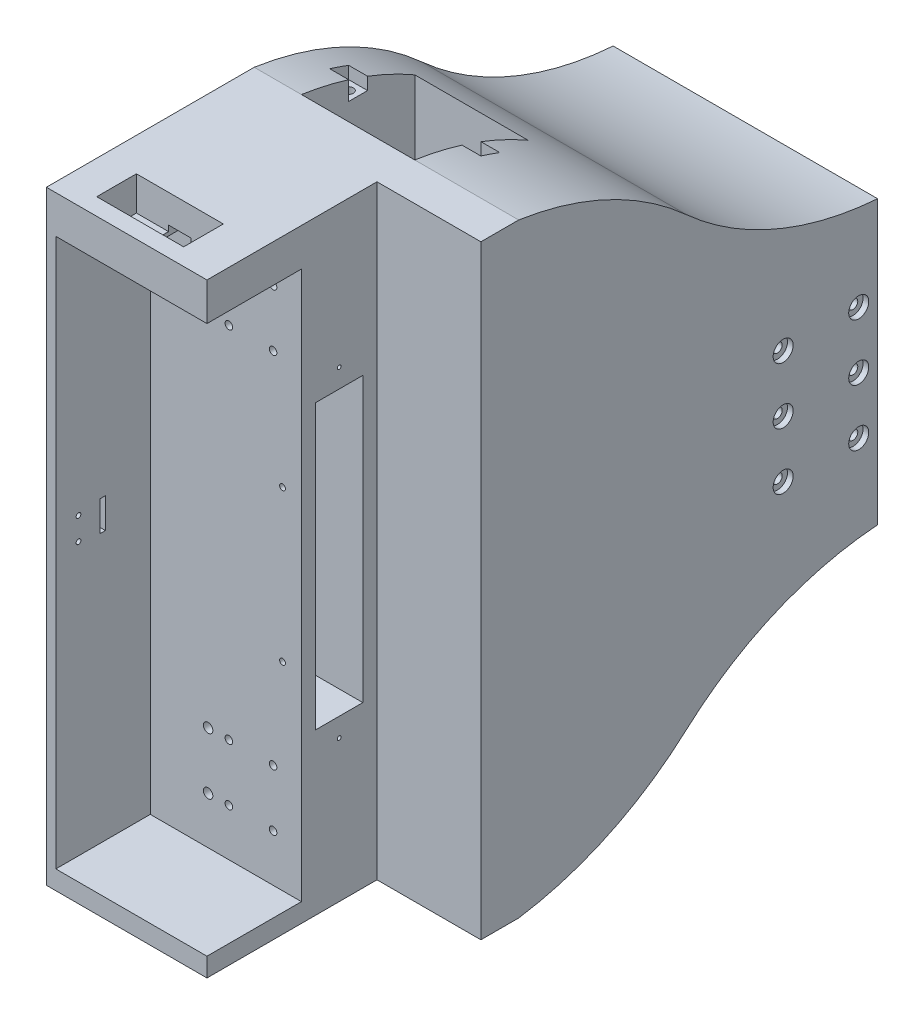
ISO-10303-21;
HEADER;
FILE_DESCRIPTION(('STEP AP214'),'2;1');
FILE_NAME('part.step','',(''),(''),'','','');
FILE_SCHEMA(('AUTOMOTIVE_DESIGN { 1 0 10303 214 1 1 1 1 }'));
ENDSEC;
DATA;
#1=APPLICATION_CONTEXT('core data for automotive mechanical design processes');
#2=APPLICATION_PROTOCOL_DEFINITION('international standard','automotive_design',2000,#1);
#3=PRODUCT_CONTEXT('',#1,'mechanical');
#4=PRODUCT('Part','Part','',(#3));
#5=PRODUCT_RELATED_PRODUCT_CATEGORY('part','',(#4));
#6=PRODUCT_DEFINITION_FORMATION('','',#4);
#7=PRODUCT_DEFINITION_CONTEXT('part definition',#1,'design');
#8=PRODUCT_DEFINITION('design','',#6,#7);
#9=PRODUCT_DEFINITION_SHAPE('','',#8);
#10=(LENGTH_UNIT() NAMED_UNIT(*) SI_UNIT(.MILLI.,.METRE.));
#11=(NAMED_UNIT(*) PLANE_ANGLE_UNIT() SI_UNIT($,.RADIAN.));
#12=(NAMED_UNIT(*) SI_UNIT($,.STERADIAN.) SOLID_ANGLE_UNIT());
#13=UNCERTAINTY_MEASURE_WITH_UNIT(LENGTH_MEASURE(1.E-05),#10,'distance_accuracy_value','');
#14=(GEOMETRIC_REPRESENTATION_CONTEXT(3) GLOBAL_UNCERTAINTY_ASSIGNED_CONTEXT((#13)) GLOBAL_UNIT_ASSIGNED_CONTEXT((#10,
#11,#12)) REPRESENTATION_CONTEXT('',''));
#15=CARTESIAN_POINT('',(0.,0.,0.));
#16=DIRECTION('',(0.,0.,1.));
#17=DIRECTION('',(1.,0.,0.));
#18=AXIS2_PLACEMENT_3D('',#15,#16,#17);
#19=CARTESIAN_POINT('',(-372.155881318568,167.798336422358,14.9754047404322));
#20=DIRECTION('',(1.,0.,0.));
#21=DIRECTION('',(0.,0.,-1.));
#22=AXIS2_PLACEMENT_3D('',#19,#20,#21);
#23=CYLINDRICAL_SURFACE('',#22,169.646846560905);
#24=DIRECTION('',(-1.,0.,0.));
#25=VECTOR('',#24,1.);
#26=CARTESIAN_POINT('',(95.,5.67951743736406,-35.));
#27=LINE('',#26,#25);
#28=CARTESIAN_POINT('',(95.,5.67951743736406,-35.));
#29=VERTEX_POINT('',#28);
#30=CARTESIAN_POINT('',(85.,5.67951743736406,-35.));
#31=VERTEX_POINT('',#30);
#32=EDGE_CURVE('E504',#29,#31,#27,.T.);
#33=ORIENTED_EDGE('',*,*,#32,.F.);
#34=CARTESIAN_POINT('',(95.,167.798336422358,14.9754047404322));
#35=DIRECTION('',(-1.,0.,0.));
#36=DIRECTION('',(0.,0.,1.));
#37=AXIS2_PLACEMENT_3D('',#34,#35,#36);
#38=CIRCLE('',#37,169.646846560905);
#39=CARTESIAN_POINT('',(95.,9.10680112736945,-45.));
#40=VERTEX_POINT('',#39);
#41=EDGE_CURVE('E530',#40,#29,#38,.T.);
#42=ORIENTED_EDGE('',*,*,#41,.F.);
#43=DIRECTION('',(-1.,0.,0.));
#44=VECTOR('',#43,1.);
#45=CARTESIAN_POINT('',(95.,9.10680112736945,-45.));
#46=LINE('',#45,#44);
#47=CARTESIAN_POINT('',(85.,9.10680112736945,-45.));
#48=VERTEX_POINT('',#47);
#49=EDGE_CURVE('E544',#40,#48,#46,.T.);
#50=ORIENTED_EDGE('',*,*,#49,.T.);
#51=CARTESIAN_POINT('',(85.,167.798336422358,14.9754047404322));
#52=DIRECTION('',(-1.,0.,0.));
#53=DIRECTION('',(0.,0.,1.));
#54=AXIS2_PLACEMENT_3D('',#51,#52,#53);
#55=CIRCLE('',#54,169.646846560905);
#56=CARTESIAN_POINT('',(85.,20.96770904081,-70.));
#57=VERTEX_POINT('',#56);
#58=EDGE_CURVE('E950',#57,#48,#55,.T.);
#59=ORIENTED_EDGE('',*,*,#58,.F.);
#60=DIRECTION('',(-1.,0.,0.));
#61=VECTOR('',#60,1.);
#62=CARTESIAN_POINT('',(85.,20.96770904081,-70.));
#63=LINE('',#62,#61);
#64=CARTESIAN_POINT('',(25.,20.96770904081,-70.));
#65=VERTEX_POINT('',#64);
#66=EDGE_CURVE('E975',#57,#65,#63,.T.);
#67=ORIENTED_EDGE('',*,*,#66,.T.);
#68=CARTESIAN_POINT('',(25.,167.798336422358,14.9754047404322));
#69=DIRECTION('',(-1.,0.,0.));
#70=DIRECTION('',(0.,0.,1.));
#71=AXIS2_PLACEMENT_3D('',#68,#69,#70);
#72=CIRCLE('',#71,169.646846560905);
#73=CARTESIAN_POINT('',(25.,9.10680112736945,-45.));
#74=VERTEX_POINT('',#73);
#75=EDGE_CURVE('E965',#65,#74,#72,.T.);
#76=ORIENTED_EDGE('',*,*,#75,.T.);
#77=CARTESIAN_POINT('',(15.,9.10680112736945,-45.));
#78=VERTEX_POINT('',#77);
#79=EDGE_CURVE('E550',#74,#78,#46,.T.);
#80=ORIENTED_EDGE('',*,*,#79,.T.);
#81=CARTESIAN_POINT('',(15.,167.798336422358,14.9754047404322));
#82=DIRECTION('',(-1.,0.,0.));
#83=DIRECTION('',(0.,0.,1.));
#84=AXIS2_PLACEMENT_3D('',#81,#82,#83);
#85=CIRCLE('',#84,169.646846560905);
#86=CARTESIAN_POINT('',(15.,5.67951743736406,-35.));
#87=VERTEX_POINT('',#86);
#88=EDGE_CURVE('E522',#78,#87,#85,.T.);
#89=ORIENTED_EDGE('',*,*,#88,.T.);
#90=CARTESIAN_POINT('',(25.,5.67951743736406,-35.));
#91=VERTEX_POINT('',#90);
#92=EDGE_CURVE('E543',#91,#87,#27,.T.);
#93=ORIENTED_EDGE('',*,*,#92,.F.);
#94=CARTESIAN_POINT('',(25.,0.,-10.));
#95=VERTEX_POINT('',#94);
#96=EDGE_CURVE('E961',#91,#95,#72,.T.);
#97=ORIENTED_EDGE('',*,*,#96,.T.);
#98=DIRECTION('',(-1.,0.,0.));
#99=VECTOR('',#98,1.);
#100=CARTESIAN_POINT('',(140.,0.,-10.));
#101=LINE('',#100,#99);
#102=CARTESIAN_POINT('',(0.,0.,-10.));
#103=VERTEX_POINT('',#102);
#104=EDGE_CURVE('E1053',#95,#103,#101,.T.);
#105=ORIENTED_EDGE('',*,*,#104,.T.);
#106=CARTESIAN_POINT('',(0.,167.798336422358,14.9754047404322));
#107=DIRECTION('',(1.,0.,0.));
#108=DIRECTION('',(0.,0.,-1.));
#109=AXIS2_PLACEMENT_3D('',#106,#107,#108);
#110=CIRCLE('',#109,169.646846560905);
#111=CARTESIAN_POINT('',(0.,42.0037166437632,-98.8479943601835));
#112=VERTEX_POINT('',#111);
#113=EDGE_CURVE('E1011',#103,#112,#110,.T.);
#114=ORIENTED_EDGE('',*,*,#113,.T.);
#115=DIRECTION('',(1.,0.,0.));
#116=VECTOR('',#115,1.);
#117=CARTESIAN_POINT('',(-372.155881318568,42.0037166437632,-98.8479943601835));
#118=LINE('',#117,#116);
#119=CARTESIAN_POINT('',(140.,42.0037166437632,-98.8479943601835));
#120=VERTEX_POINT('',#119);
#121=EDGE_CURVE('E1039',#112,#120,#118,.T.);
#122=ORIENTED_EDGE('',*,*,#121,.T.);
#123=CARTESIAN_POINT('',(140.,167.798336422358,14.9754047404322));
#124=DIRECTION('',(1.,0.,0.));
#125=DIRECTION('',(0.,0.,-1.));
#126=AXIS2_PLACEMENT_3D('',#123,#124,#125);
#127=CIRCLE('',#126,169.646846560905);
#128=CARTESIAN_POINT('',(140.,0.,-10.));
#129=VERTEX_POINT('',#128);
#130=EDGE_CURVE('E1019',#120,#129,#127,.F.);
#131=ORIENTED_EDGE('',*,*,#130,.T.);
#132=CARTESIAN_POINT('',(85.,0.,-10.));
#133=VERTEX_POINT('',#132);
#134=EDGE_CURVE('E1089',#129,#133,#101,.T.);
#135=ORIENTED_EDGE('',*,*,#134,.T.);
#136=EDGE_CURVE('E948',#31,#133,#55,.T.);
#137=ORIENTED_EDGE('',*,*,#136,.F.);
#138=EDGE_LOOP('',(#33,#42,#50,#59,#67,#76,#80,#89,#93,#97,#105,#114,#122,#131,#135,#137));
#139=FACE_BOUND('',#138,.T.);
#140=ADVANCED_FACE('F44',(#139),#23,.T.);
#141=CARTESIAN_POINT('',(-372.155881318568,152.201663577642,14.9754047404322));
#142=DIRECTION('',(1.,0.,0.));
#143=DIRECTION('',(0.,0.,-1.));
#144=AXIS2_PLACEMENT_3D('',#141,#142,#143);
#145=CYLINDRICAL_SURFACE('',#144,169.646846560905);
#146=CARTESIAN_POINT('',(85.,152.201663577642,14.9754047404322));
#147=DIRECTION('',(-1.,0.,0.));
#148=DIRECTION('',(0.,0.,1.));
#149=AXIS2_PLACEMENT_3D('',#146,#147,#148);
#150=CIRCLE('',#149,169.646846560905);
#151=CARTESIAN_POINT('',(85.,310.893198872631,-45.));
#152=VERTEX_POINT('',#151);
#153=CARTESIAN_POINT('',(85.,299.03229095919,-70.));
#154=VERTEX_POINT('',#153);
#155=EDGE_CURVE('E983',#152,#154,#150,.T.);
#156=ORIENTED_EDGE('',*,*,#155,.F.);
#157=DIRECTION('',(-1.,0.,0.));
#158=VECTOR('',#157,1.);
#159=CARTESIAN_POINT('',(95.,310.893198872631,-45.));
#160=LINE('',#159,#158);
#161=CARTESIAN_POINT('',(95.,310.893198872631,-45.));
#162=VERTEX_POINT('',#161);
#163=EDGE_CURVE('E508',#162,#152,#160,.T.);
#164=ORIENTED_EDGE('',*,*,#163,.F.);
#165=CARTESIAN_POINT('',(95.,152.201663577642,14.9754047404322));
#166=DIRECTION('',(-1.,0.,0.));
#167=DIRECTION('',(0.,0.,1.));
#168=AXIS2_PLACEMENT_3D('',#165,#166,#167);
#169=CIRCLE('',#168,169.646846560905);
#170=CARTESIAN_POINT('',(95.,314.320482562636,-35.));
#171=VERTEX_POINT('',#170);
#172=EDGE_CURVE('E486',#171,#162,#169,.T.);
#173=ORIENTED_EDGE('',*,*,#172,.F.);
#174=DIRECTION('',(-1.,0.,0.));
#175=VECTOR('',#174,1.);
#176=CARTESIAN_POINT('',(95.,314.320482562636,-35.));
#177=LINE('',#176,#175);
#178=CARTESIAN_POINT('',(85.,314.320482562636,-35.));
#179=VERTEX_POINT('',#178);
#180=EDGE_CURVE('E514',#171,#179,#177,.T.);
#181=ORIENTED_EDGE('',*,*,#180,.T.);
#182=CARTESIAN_POINT('',(85.,320.,-9.99999999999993));
#183=VERTEX_POINT('',#182);
#184=EDGE_CURVE('E987',#183,#179,#150,.T.);
#185=ORIENTED_EDGE('',*,*,#184,.F.);
#186=DIRECTION('',(1.,0.,0.));
#187=VECTOR('',#186,1.);
#188=CARTESIAN_POINT('',(0.,320.,-10.));
#189=LINE('',#188,#187);
#190=CARTESIAN_POINT('',(140.,320.,-10.));
#191=VERTEX_POINT('',#190);
#192=EDGE_CURVE('E1092',#183,#191,#189,.T.);
#193=ORIENTED_EDGE('',*,*,#192,.T.);
#194=CARTESIAN_POINT('',(140.,152.201663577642,14.9754047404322));
#195=DIRECTION('',(1.,0.,0.));
#196=DIRECTION('',(0.,0.,-1.));
#197=AXIS2_PLACEMENT_3D('',#194,#195,#196);
#198=CIRCLE('',#197,169.646846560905);
#199=CARTESIAN_POINT('',(140.,277.996283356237,-98.8479943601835));
#200=VERTEX_POINT('',#199);
#201=EDGE_CURVE('E1034',#200,#191,#198,.T.);
#202=ORIENTED_EDGE('',*,*,#201,.F.);
#203=DIRECTION('',(1.,0.,0.));
#204=VECTOR('',#203,1.);
#205=CARTESIAN_POINT('',(-372.155881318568,277.996283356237,-98.8479943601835));
#206=LINE('',#205,#204);
#207=CARTESIAN_POINT('',(0.,277.996283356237,-98.8479943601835));
#208=VERTEX_POINT('',#207);
#209=EDGE_CURVE('E1036',#208,#200,#206,.T.);
#210=ORIENTED_EDGE('',*,*,#209,.F.);
#211=CARTESIAN_POINT('',(0.,152.201663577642,14.9754047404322));
#212=DIRECTION('',(1.,0.,0.));
#213=DIRECTION('',(0.,0.,-1.));
#214=AXIS2_PLACEMENT_3D('',#211,#212,#213);
#215=CIRCLE('',#214,169.646846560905);
#216=CARTESIAN_POINT('',(0.,320.,-10.));
#217=VERTEX_POINT('',#216);
#218=EDGE_CURVE('E1020',#217,#208,#215,.F.);
#219=ORIENTED_EDGE('',*,*,#218,.F.);
#220=CARTESIAN_POINT('',(25.,320.,-9.99999999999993));
#221=VERTEX_POINT('',#220);
#222=EDGE_CURVE('E1093',#217,#221,#189,.T.);
#223=ORIENTED_EDGE('',*,*,#222,.T.);
#224=CARTESIAN_POINT('',(25.,152.201663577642,14.9754047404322));
#225=DIRECTION('',(-1.,0.,0.));
#226=DIRECTION('',(0.,0.,1.));
#227=AXIS2_PLACEMENT_3D('',#224,#225,#226);
#228=CIRCLE('',#227,169.646846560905);
#229=CARTESIAN_POINT('',(25.,314.320482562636,-35.));
#230=VERTEX_POINT('',#229);
#231=EDGE_CURVE('E982',#221,#230,#228,.T.);
#232=ORIENTED_EDGE('',*,*,#231,.T.);
#233=CARTESIAN_POINT('',(15.,314.320482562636,-35.));
#234=VERTEX_POINT('',#233);
#235=EDGE_CURVE('E519',#230,#234,#177,.T.);
#236=ORIENTED_EDGE('',*,*,#235,.T.);
#237=CARTESIAN_POINT('',(15.,152.201663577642,14.9754047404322));
#238=DIRECTION('',(-1.,0.,0.));
#239=DIRECTION('',(0.,0.,1.));
#240=AXIS2_PLACEMENT_3D('',#237,#238,#239);
#241=CIRCLE('',#240,169.646846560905);
#242=CARTESIAN_POINT('',(15.,310.893198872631,-45.));
#243=VERTEX_POINT('',#242);
#244=EDGE_CURVE('E489',#234,#243,#241,.T.);
#245=ORIENTED_EDGE('',*,*,#244,.T.);
#246=CARTESIAN_POINT('',(25.,310.893198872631,-45.));
#247=VERTEX_POINT('',#246);
#248=EDGE_CURVE('E515',#247,#243,#160,.T.);
#249=ORIENTED_EDGE('',*,*,#248,.F.);
#250=CARTESIAN_POINT('',(25.,299.03229095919,-70.));
#251=VERTEX_POINT('',#250);
#252=EDGE_CURVE('E997',#247,#251,#228,.T.);
#253=ORIENTED_EDGE('',*,*,#252,.T.);
#254=DIRECTION('',(-1.,0.,0.));
#255=VECTOR('',#254,1.);
#256=CARTESIAN_POINT('',(85.,299.03229095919,-70.));
#257=LINE('',#256,#255);
#258=EDGE_CURVE('E958',#154,#251,#257,.T.);
#259=ORIENTED_EDGE('',*,*,#258,.F.);
#260=EDGE_LOOP('',(#156,#164,#173,#181,#185,#193,#202,#210,#219,#223,#232,#236,#245,#249,#253,#259));
#261=FACE_BOUND('',#260,.T.);
#262=ADVANCED_FACE('F1241',(#261),#145,.T.);
#263=CARTESIAN_POINT('',(85.,0.,0.));
#264=DIRECTION('',(-1.,0.,0.));
#265=DIRECTION('',(0.,0.,1.));
#266=AXIS2_PLACEMENT_3D('',#263,#264,#265);
#267=PLANE('',#266);
#268=DIRECTION('',(0.,0.,-1.));
#269=VECTOR('',#268,1.);
#270=CARTESIAN_POINT('',(85.,304.32,0.));
#271=LINE('',#270,#269);
#272=CARTESIAN_POINT('',(85.,304.32,-35.));
#273=VERTEX_POINT('',#272);
#274=CARTESIAN_POINT('',(85.,304.32,-45.));
#275=VERTEX_POINT('',#274);
#276=EDGE_CURVE('E557',#273,#275,#271,.T.);
#277=ORIENTED_EDGE('',*,*,#276,.T.);
#278=DIRECTION('',(0.,1.,0.));
#279=VECTOR('',#278,1.);
#280=CARTESIAN_POINT('',(85.,0.,-45.));
#281=LINE('',#280,#279);
#282=EDGE_CURVE('E485',#275,#152,#281,.T.);
#283=ORIENTED_EDGE('',*,*,#282,.T.);
#284=ORIENTED_EDGE('',*,*,#155,.T.);
#285=DIRECTION('',(0.,1.,0.));
#286=VECTOR('',#285,1.);
#287=CARTESIAN_POINT('',(85.,0.,-70.));
#288=LINE('',#287,#286);
#289=CARTESIAN_POINT('',(85.,240.,-70.));
#290=VERTEX_POINT('',#289);
#291=EDGE_CURVE('E980',#290,#154,#288,.T.);
#292=ORIENTED_EDGE('',*,*,#291,.F.);
#293=DIRECTION('',(0.,0.,-1.));
#294=VECTOR('',#293,1.);
#295=CARTESIAN_POINT('',(85.,240.,0.));
#296=LINE('',#295,#294);
#297=CARTESIAN_POINT('',(85.,240.,-9.99999999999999));
#298=VERTEX_POINT('',#297);
#299=EDGE_CURVE('E976',#298,#290,#296,.T.);
#300=ORIENTED_EDGE('',*,*,#299,.F.);
#301=DIRECTION('',(0.,-1.,0.));
#302=VECTOR('',#301,1.);
#303=CARTESIAN_POINT('',(85.,0.,-9.99999999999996));
#304=LINE('',#303,#302);
#305=EDGE_CURVE('E984',#183,#298,#304,.T.);
#306=ORIENTED_EDGE('',*,*,#305,.F.);
#307=ORIENTED_EDGE('',*,*,#184,.T.);
#308=DIRECTION('',(0.,1.,0.));
#309=VECTOR('',#308,1.);
#310=CARTESIAN_POINT('',(85.,0.,-35.));
#311=LINE('',#310,#309);
#312=EDGE_CURVE('E565',#273,#179,#311,.T.);
#313=ORIENTED_EDGE('',*,*,#312,.F.);
#314=EDGE_LOOP('',(#277,#283,#284,#292,#300,#306,#307,#313));
#315=FACE_BOUND('',#314,.T.);
#316=ADVANCED_FACE('F1256',(#315),#267,.T.);
#317=CARTESIAN_POINT('',(25.,0.,0.));
#318=DIRECTION('',(-1.,0.,0.));
#319=DIRECTION('',(0.,0.,1.));
#320=AXIS2_PLACEMENT_3D('',#317,#318,#319);
#321=PLANE('',#320);
#322=DIRECTION('',(0.,1.,0.));
#323=VECTOR('',#322,1.);
#324=CARTESIAN_POINT('',(25.,0.,-45.));
#325=LINE('',#324,#323);
#326=CARTESIAN_POINT('',(25.,304.32,-45.));
#327=VERTEX_POINT('',#326);
#328=EDGE_CURVE('E11',#327,#247,#325,.T.);
#329=ORIENTED_EDGE('',*,*,#328,.F.);
#330=DIRECTION('',(0.,0.,-1.));
#331=VECTOR('',#330,1.);
#332=CARTESIAN_POINT('',(25.,304.32,0.));
#333=LINE('',#332,#331);
#334=CARTESIAN_POINT('',(25.,304.32,-35.));
#335=VERTEX_POINT('',#334);
#336=EDGE_CURVE('E1235',#335,#327,#333,.T.);
#337=ORIENTED_EDGE('',*,*,#336,.F.);
#338=DIRECTION('',(0.,1.,0.));
#339=VECTOR('',#338,1.);
#340=CARTESIAN_POINT('',(25.,0.,-35.));
#341=LINE('',#340,#339);
#342=EDGE_CURVE('E52',#335,#230,#341,.T.);
#343=ORIENTED_EDGE('',*,*,#342,.T.);
#344=ORIENTED_EDGE('',*,*,#231,.F.);
#345=DIRECTION('',(0.,-1.,0.));
#346=VECTOR('',#345,1.);
#347=CARTESIAN_POINT('',(25.,0.,-9.99999999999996));
#348=LINE('',#347,#346);
#349=CARTESIAN_POINT('',(25.,240.,-9.99999999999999));
#350=VERTEX_POINT('',#349);
#351=EDGE_CURVE('E993',#221,#350,#348,.T.);
#352=ORIENTED_EDGE('',*,*,#351,.T.);
#353=DIRECTION('',(0.,0.,-1.));
#354=VECTOR('',#353,1.);
#355=CARTESIAN_POINT('',(25.,240.,0.));
#356=LINE('',#355,#354);
#357=CARTESIAN_POINT('',(25.,240.,-70.));
#358=VERTEX_POINT('',#357);
#359=EDGE_CURVE('E991',#350,#358,#356,.T.);
#360=ORIENTED_EDGE('',*,*,#359,.T.);
#361=DIRECTION('',(0.,1.,0.));
#362=VECTOR('',#361,1.);
#363=CARTESIAN_POINT('',(25.,0.,-70.));
#364=LINE('',#363,#362);
#365=EDGE_CURVE('E935',#358,#251,#364,.T.);
#366=ORIENTED_EDGE('',*,*,#365,.T.);
#367=ORIENTED_EDGE('',*,*,#252,.F.);
#368=EDGE_LOOP('',(#329,#337,#343,#344,#352,#360,#366,#367));
#369=FACE_BOUND('',#368,.T.);
#370=ADVANCED_FACE('F1239',(#369),#321,.F.);
#371=CARTESIAN_POINT('',(85.,0.,0.));
#372=DIRECTION('',(-1.,0.,0.));
#373=DIRECTION('',(0.,0.,1.));
#374=AXIS2_PLACEMENT_3D('',#371,#372,#373);
#375=PLANE('',#374);
#376=DIRECTION('',(0.,0.,-1.));
#377=VECTOR('',#376,1.);
#378=CARTESIAN_POINT('',(85.,15.68,0.));
#379=LINE('',#378,#377);
#380=CARTESIAN_POINT('',(85.,15.68,-35.));
#381=VERTEX_POINT('',#380);
#382=CARTESIAN_POINT('',(85.,15.68,-45.));
#383=VERTEX_POINT('',#382);
#384=EDGE_CURVE('E512',#381,#383,#379,.T.);
#385=ORIENTED_EDGE('',*,*,#384,.F.);
#386=DIRECTION('',(0.,-1.,0.));
#387=VECTOR('',#386,1.);
#388=CARTESIAN_POINT('',(85.,0.,-35.));
#389=LINE('',#388,#387);
#390=EDGE_CURVE('E560',#381,#31,#389,.T.);
#391=ORIENTED_EDGE('',*,*,#390,.T.);
#392=ORIENTED_EDGE('',*,*,#136,.T.);
#393=DIRECTION('',(0.,1.,0.));
#394=VECTOR('',#393,1.);
#395=CARTESIAN_POINT('',(85.,0.,-10.));
#396=LINE('',#395,#394);
#397=CARTESIAN_POINT('',(85.,80.,-10.));
#398=VERTEX_POINT('',#397);
#399=EDGE_CURVE('E947',#133,#398,#396,.T.);
#400=ORIENTED_EDGE('',*,*,#399,.T.);
#401=DIRECTION('',(0.,0.,-1.));
#402=VECTOR('',#401,1.);
#403=CARTESIAN_POINT('',(85.,80.,0.));
#404=LINE('',#403,#402);
#405=CARTESIAN_POINT('',(85.,80.,-70.));
#406=VERTEX_POINT('',#405);
#407=EDGE_CURVE('E936',#398,#406,#404,.T.);
#408=ORIENTED_EDGE('',*,*,#407,.T.);
#409=DIRECTION('',(0.,-1.,0.));
#410=VECTOR('',#409,1.);
#411=CARTESIAN_POINT('',(85.,0.,-70.));
#412=LINE('',#411,#410);
#413=EDGE_CURVE('E942',#406,#57,#412,.T.);
#414=ORIENTED_EDGE('',*,*,#413,.T.);
#415=ORIENTED_EDGE('',*,*,#58,.T.);
#416=DIRECTION('',(0.,-1.,0.));
#417=VECTOR('',#416,1.);
#418=CARTESIAN_POINT('',(85.,0.,-45.));
#419=LINE('',#418,#417);
#420=EDGE_CURVE('E554',#383,#48,#419,.T.);
#421=ORIENTED_EDGE('',*,*,#420,.F.);
#422=EDGE_LOOP('',(#385,#391,#392,#400,#408,#414,#415,#421));
#423=FACE_BOUND('',#422,.T.);
#424=ADVANCED_FACE('F1592',(#423),#375,.T.);
#425=CARTESIAN_POINT('',(25.,0.,0.));
#426=DIRECTION('',(-1.,0.,0.));
#427=DIRECTION('',(0.,0.,1.));
#428=AXIS2_PLACEMENT_3D('',#425,#426,#427);
#429=PLANE('',#428);
#430=DIRECTION('',(0.,-1.,0.));
#431=VECTOR('',#430,1.);
#432=CARTESIAN_POINT('',(25.,0.,-35.));
#433=LINE('',#432,#431);
#434=CARTESIAN_POINT('',(25.,15.68,-35.));
#435=VERTEX_POINT('',#434);
#436=EDGE_CURVE('E1234',#435,#91,#433,.T.);
#437=ORIENTED_EDGE('',*,*,#436,.F.);
#438=DIRECTION('',(0.,0.,-1.));
#439=VECTOR('',#438,1.);
#440=CARTESIAN_POINT('',(25.,15.68,0.));
#441=LINE('',#440,#439);
#442=CARTESIAN_POINT('',(25.,15.68,-45.));
#443=VERTEX_POINT('',#442);
#444=EDGE_CURVE('E1221',#435,#443,#441,.T.);
#445=ORIENTED_EDGE('',*,*,#444,.T.);
#446=DIRECTION('',(0.,-1.,0.));
#447=VECTOR('',#446,1.);
#448=CARTESIAN_POINT('',(25.,0.,-45.));
#449=LINE('',#448,#447);
#450=EDGE_CURVE('E1229',#443,#74,#449,.T.);
#451=ORIENTED_EDGE('',*,*,#450,.T.);
#452=ORIENTED_EDGE('',*,*,#75,.F.);
#453=DIRECTION('',(0.,-1.,0.));
#454=VECTOR('',#453,1.);
#455=CARTESIAN_POINT('',(25.,0.,-70.));
#456=LINE('',#455,#454);
#457=CARTESIAN_POINT('',(25.,80.,-70.));
#458=VERTEX_POINT('',#457);
#459=EDGE_CURVE('E960',#458,#65,#456,.T.);
#460=ORIENTED_EDGE('',*,*,#459,.F.);
#461=DIRECTION('',(0.,0.,-1.));
#462=VECTOR('',#461,1.);
#463=CARTESIAN_POINT('',(25.,80.,0.));
#464=LINE('',#463,#462);
#465=CARTESIAN_POINT('',(25.,80.,-10.));
#466=VERTEX_POINT('',#465);
#467=EDGE_CURVE('E952',#466,#458,#464,.T.);
#468=ORIENTED_EDGE('',*,*,#467,.F.);
#469=DIRECTION('',(0.,1.,0.));
#470=VECTOR('',#469,1.);
#471=CARTESIAN_POINT('',(25.,0.,-10.));
#472=LINE('',#471,#470);
#473=EDGE_CURVE('E941',#95,#466,#472,.T.);
#474=ORIENTED_EDGE('',*,*,#473,.F.);
#475=ORIENTED_EDGE('',*,*,#96,.F.);
#476=EDGE_LOOP('',(#437,#445,#451,#452,#460,#468,#474,#475));
#477=FACE_BOUND('',#476,.T.);
#478=ADVANCED_FACE('F1376',(#477),#429,.F.);
#479=CARTESIAN_POINT('',(5.00000000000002,0.,50.0000000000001));
#480=DIRECTION('',(0.,0.,-1.));
#481=DIRECTION('',(-1.,0.,0.));
#482=AXIS2_PLACEMENT_3D('',#479,#480,#481);
#483=PLANE('',#482);
#484=DIRECTION('',(0.,1.,0.));
#485=VECTOR('',#484,1.);
#486=CARTESIAN_POINT('',(85.,0.,50.));
#487=LINE('',#486,#485);
#488=CARTESIAN_POINT('',(85.,10.,50.));
#489=VERTEX_POINT('',#488);
#490=CARTESIAN_POINT('',(85.,300.,50.));
#491=VERTEX_POINT('',#490);
#492=EDGE_CURVE('E1134',#489,#491,#487,.T.);
#493=ORIENTED_EDGE('',*,*,#492,.T.);
#494=DIRECTION('',(1.,0.,0.));
#495=VECTOR('',#494,1.);
#496=CARTESIAN_POINT('',(5.00000000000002,300.,50.0000000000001));
#497=LINE('',#496,#495);
#498=CARTESIAN_POINT('',(5.00000000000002,300.,50.0000000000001));
#499=VERTEX_POINT('',#498);
#500=EDGE_CURVE('E651',#499,#491,#497,.T.);
#501=ORIENTED_EDGE('',*,*,#500,.F.);
#502=DIRECTION('',(0.,1.,0.));
#503=VECTOR('',#502,1.);
#504=CARTESIAN_POINT('',(5.00000000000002,0.,50.0000000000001));
#505=LINE('',#504,#503);
#506=CARTESIAN_POINT('',(5.00000000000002,10.,50.0000000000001));
#507=VERTEX_POINT('',#506);
#508=EDGE_CURVE('E1131',#507,#499,#505,.T.);
#509=ORIENTED_EDGE('',*,*,#508,.F.);
#510=DIRECTION('',(-1.,0.,0.));
#511=VECTOR('',#510,1.);
#512=CARTESIAN_POINT('',(85.,10.,50.));
#513=LINE('',#512,#511);
#514=EDGE_CURVE('E594',#489,#507,#513,.T.);
#515=ORIENTED_EDGE('',*,*,#514,.F.);
#516=EDGE_LOOP('',(#493,#501,#509,#515));
#517=FACE_BOUND('',#516,.T.);
#518=CARTESIAN_POINT('',(46.5999999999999,64.9999999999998,50.0000000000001));
#519=DIRECTION('',(0.,0.,1.));
#520=DIRECTION('',(1.,0.,0.));
#521=AXIS2_PLACEMENT_3D('',#518,#519,#520);
#522=CIRCLE('',#521,2.);
#523=CARTESIAN_POINT('',(48.5999999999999,64.9999999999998,50.0000000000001));
#524=VERTEX_POINT('',#523);
#525=EDGE_CURVE('E1128',#524,#524,#522,.T.);
#526=ORIENTED_EDGE('',*,*,#525,.F.);
#527=EDGE_LOOP('',(#526));
#528=FACE_BOUND('',#527,.T.);
#529=CARTESIAN_POINT('',(46.5999999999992,255.,50.0000000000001));
#530=DIRECTION('',(0.,0.,1.));
#531=DIRECTION('',(1.,0.,0.));
#532=AXIS2_PLACEMENT_3D('',#529,#530,#531);
#533=CIRCLE('',#532,1.99999999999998);
#534=CARTESIAN_POINT('',(48.5999999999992,255.,50.0000000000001));
#535=VERTEX_POINT('',#534);
#536=EDGE_CURVE('E1104',#535,#535,#533,.T.);
#537=ORIENTED_EDGE('',*,*,#536,.F.);
#538=EDGE_LOOP('',(#537));
#539=FACE_BOUND('',#538,.T.);
#540=CARTESIAN_POINT('',(69.9999999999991,285.,50.0000000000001));
#541=DIRECTION('',(0.,0.,1.));
#542=DIRECTION('',(1.,0.,0.));
#543=AXIS2_PLACEMENT_3D('',#540,#541,#542);
#544=CIRCLE('',#543,2.);
#545=CARTESIAN_POINT('',(71.9999999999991,285.,50.0000000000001));
#546=VERTEX_POINT('',#545);
#547=EDGE_CURVE('E1111',#546,#546,#544,.T.);
#548=ORIENTED_EDGE('',*,*,#547,.F.);
#549=EDGE_LOOP('',(#548));
#550=FACE_BOUND('',#549,.T.);
#551=CARTESIAN_POINT('',(46.5999999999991,285.,50.0000000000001));
#552=DIRECTION('',(0.,0.,1.));
#553=DIRECTION('',(1.,0.,0.));
#554=AXIS2_PLACEMENT_3D('',#551,#552,#553);
#555=CIRCLE('',#554,2.);
#556=CARTESIAN_POINT('',(48.5999999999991,285.,50.0000000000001));
#557=VERTEX_POINT('',#556);
#558=EDGE_CURVE('E1106',#557,#557,#555,.T.);
#559=ORIENTED_EDGE('',*,*,#558,.F.);
#560=EDGE_LOOP('',(#559));
#561=FACE_BOUND('',#560,.T.);
#562=CARTESIAN_POINT('',(69.9999999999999,65.,50.0000000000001));
#563=DIRECTION('',(0.,0.,1.));
#564=DIRECTION('',(1.,0.,0.));
#565=AXIS2_PLACEMENT_3D('',#562,#563,#564);
#566=CIRCLE('',#565,2.);
#567=CARTESIAN_POINT('',(71.9999999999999,65.,50.0000000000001));
#568=VERTEX_POINT('',#567);
#569=EDGE_CURVE('E1122',#568,#568,#566,.T.);
#570=ORIENTED_EDGE('',*,*,#569,.F.);
#571=EDGE_LOOP('',(#570));
#572=FACE_BOUND('',#571,.T.);
#573=CARTESIAN_POINT('',(46.6,34.9999999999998,50.0000000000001));
#574=DIRECTION('',(0.,0.,1.));
#575=DIRECTION('',(1.,0.,0.));
#576=AXIS2_PLACEMENT_3D('',#573,#574,#575);
#577=CIRCLE('',#576,2.);
#578=CARTESIAN_POINT('',(48.6,34.9999999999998,50.0000000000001));
#579=VERTEX_POINT('',#578);
#580=EDGE_CURVE('E1121',#579,#579,#577,.T.);
#581=ORIENTED_EDGE('',*,*,#580,.F.);
#582=EDGE_LOOP('',(#581));
#583=FACE_BOUND('',#582,.T.);
#584=CARTESIAN_POINT('',(70.,35.,50.0000000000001));
#585=DIRECTION('',(0.,0.,1.));
#586=DIRECTION('',(1.,0.,0.));
#587=AXIS2_PLACEMENT_3D('',#584,#585,#586);
#588=CIRCLE('',#587,2.);
#589=CARTESIAN_POINT('',(72.,35.,50.0000000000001));
#590=VERTEX_POINT('',#589);
#591=EDGE_CURVE('E1119',#590,#590,#588,.T.);
#592=ORIENTED_EDGE('',*,*,#591,.F.);
#593=EDGE_LOOP('',(#592));
#594=FACE_BOUND('',#593,.T.);
#595=CARTESIAN_POINT('',(69.9999999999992,255.,50.0000000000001));
#596=DIRECTION('',(0.,0.,1.));
#597=DIRECTION('',(1.,0.,0.));
#598=AXIS2_PLACEMENT_3D('',#595,#596,#597);
#599=CIRCLE('',#598,1.99999999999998);
#600=CARTESIAN_POINT('',(71.9999999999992,255.,50.0000000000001));
#601=VERTEX_POINT('',#600);
#602=EDGE_CURVE('E1114',#601,#601,#599,.T.);
#603=ORIENTED_EDGE('',*,*,#602,.F.);
#604=EDGE_LOOP('',(#603));
#605=FACE_BOUND('',#604,.T.);
#606=CARTESIAN_POINT('',(35.5999999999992,255.,50.0000000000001));
#607=DIRECTION('',(0.,0.,1.));
#608=DIRECTION('',(1.,0.,0.));
#609=AXIS2_PLACEMENT_3D('',#606,#607,#608);
#610=CIRCLE('',#609,2.50000000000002);
#611=CARTESIAN_POINT('',(38.0999999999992,255.,50.0000000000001));
#612=VERTEX_POINT('',#611);
#613=EDGE_CURVE('E1101',#612,#612,#610,.T.);
#614=ORIENTED_EDGE('',*,*,#613,.F.);
#615=EDGE_LOOP('',(#614));
#616=FACE_BOUND('',#615,.T.);
#617=CARTESIAN_POINT('',(35.6,34.9999999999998,50.0000000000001));
#618=DIRECTION('',(0.,0.,1.));
#619=DIRECTION('',(1.,0.,0.));
#620=AXIS2_PLACEMENT_3D('',#617,#618,#619);
#621=CIRCLE('',#620,2.5);
#622=CARTESIAN_POINT('',(38.1,34.9999999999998,50.0000000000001));
#623=VERTEX_POINT('',#622);
#624=EDGE_CURVE('E1102',#623,#623,#621,.T.);
#625=ORIENTED_EDGE('',*,*,#624,.F.);
#626=EDGE_LOOP('',(#625));
#627=FACE_BOUND('',#626,.T.);
#628=CARTESIAN_POINT('',(35.5999999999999,64.9999999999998,50.0000000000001));
#629=DIRECTION('',(0.,0.,1.));
#630=DIRECTION('',(1.,0.,0.));
#631=AXIS2_PLACEMENT_3D('',#628,#629,#630);
#632=CIRCLE('',#631,2.5);
#633=CARTESIAN_POINT('',(38.0999999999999,64.9999999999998,50.0000000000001));
#634=VERTEX_POINT('',#633);
#635=EDGE_CURVE('E1100',#634,#634,#632,.T.);
#636=ORIENTED_EDGE('',*,*,#635,.F.);
#637=EDGE_LOOP('',(#636));
#638=FACE_BOUND('',#637,.T.);
#639=CARTESIAN_POINT('',(35.5999999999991,285.,50.0000000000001));
#640=DIRECTION('',(0.,0.,1.));
#641=DIRECTION('',(1.,0.,0.));
#642=AXIS2_PLACEMENT_3D('',#639,#640,#641);
#643=CIRCLE('',#642,2.49999999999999);
#644=CARTESIAN_POINT('',(38.0999999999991,285.,50.0000000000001));
#645=VERTEX_POINT('',#644);
#646=EDGE_CURVE('E1099',#645,#645,#643,.T.);
#647=ORIENTED_EDGE('',*,*,#646,.F.);
#648=EDGE_LOOP('',(#647));
#649=FACE_BOUND('',#648,.T.);
#650=CARTESIAN_POINT('',(75.,115.,50.0000000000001));
#651=DIRECTION('',(0.,0.,-1.));
#652=DIRECTION('',(-1.,0.,0.));
#653=AXIS2_PLACEMENT_3D('',#650,#651,#652);
#654=CIRCLE('',#653,1.54999999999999);
#655=CARTESIAN_POINT('',(73.45,115.,50.0000000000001));
#656=VERTEX_POINT('',#655);
#657=EDGE_CURVE('E564',#656,#656,#654,.T.);
#658=ORIENTED_EDGE('',*,*,#657,.T.);
#659=EDGE_LOOP('',(#658));
#660=FACE_BOUND('',#659,.T.);
#661=CARTESIAN_POINT('',(75.,195.,50.0000000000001));
#662=DIRECTION('',(0.,0.,1.));
#663=DIRECTION('',(1.,0.,0.));
#664=AXIS2_PLACEMENT_3D('',#661,#662,#663);
#665=CIRCLE('',#664,1.54999999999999);
#666=CARTESIAN_POINT('',(76.55,195.,50.0000000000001));
#667=VERTEX_POINT('',#666);
#668=EDGE_CURVE('E566',#667,#667,#665,.T.);
#669=ORIENTED_EDGE('',*,*,#668,.F.);
#670=EDGE_LOOP('',(#669));
#671=FACE_BOUND('',#670,.T.);
#672=ADVANCED_FACE('F1371',(#517,#528,#539,#550,#561,#572,#583,#594,#605,#616,#627,#638,#649,
#660,#671),#483,.F.);
#673=CARTESIAN_POINT('',(25.,0.,42.5000000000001));
#674=DIRECTION('',(0.,0.,-1.));
#675=DIRECTION('',(-1.,0.,0.));
#676=AXIS2_PLACEMENT_3D('',#673,#674,#675);
#677=PLANE('',#676);
#678=CARTESIAN_POINT('',(75.,115.,42.5000000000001));
#679=DIRECTION('',(0.,0.,-1.));
#680=DIRECTION('',(-1.,0.,0.));
#681=AXIS2_PLACEMENT_3D('',#678,#679,#680);
#682=CIRCLE('',#681,1.54999999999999);
#683=CARTESIAN_POINT('',(73.45,115.,42.5000000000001));
#684=VERTEX_POINT('',#683);
#685=EDGE_CURVE('E567',#684,#684,#682,.F.);
#686=ORIENTED_EDGE('',*,*,#685,.T.);
#687=EDGE_LOOP('',(#686));
#688=FACE_BOUND('',#687,.T.);
#689=DIRECTION('',(0.,1.,0.));
#690=VECTOR('',#689,1.);
#691=CARTESIAN_POINT('',(85.,0.,42.5));
#692=LINE('',#691,#690);
#693=CARTESIAN_POINT('',(85.,85.,42.5000000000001));
#694=VERTEX_POINT('',#693);
#695=CARTESIAN_POINT('',(85.,235.,42.5));
#696=VERTEX_POINT('',#695);
#697=EDGE_CURVE('E899',#694,#696,#692,.T.);
#698=ORIENTED_EDGE('',*,*,#697,.F.);
#699=DIRECTION('',(1.,0.,0.));
#700=VECTOR('',#699,1.);
#701=CARTESIAN_POINT('',(25.,85.,42.5000000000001));
#702=LINE('',#701,#700);
#703=CARTESIAN_POINT('',(25.,85.,42.5000000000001));
#704=VERTEX_POINT('',#703);
#705=EDGE_CURVE('E919',#704,#694,#702,.T.);
#706=ORIENTED_EDGE('',*,*,#705,.F.);
#707=DIRECTION('',(0.,1.,0.));
#708=VECTOR('',#707,1.);
#709=CARTESIAN_POINT('',(25.,0.,42.5000000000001));
#710=LINE('',#709,#708);
#711=CARTESIAN_POINT('',(25.,235.,42.5000000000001));
#712=VERTEX_POINT('',#711);
#713=EDGE_CURVE('E906',#704,#712,#710,.T.);
#714=ORIENTED_EDGE('',*,*,#713,.T.);
#715=DIRECTION('',(1.,0.,0.));
#716=VECTOR('',#715,1.);
#717=CARTESIAN_POINT('',(25.,235.,42.5000000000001));
#718=LINE('',#717,#716);
#719=EDGE_CURVE('E928',#712,#696,#718,.T.);
#720=ORIENTED_EDGE('',*,*,#719,.T.);
#721=EDGE_LOOP('',(#698,#706,#714,#720));
#722=FACE_BOUND('',#721,.T.);
#723=CARTESIAN_POINT('',(75.,195.,42.5000000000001));
#724=DIRECTION('',(0.,0.,-1.));
#725=DIRECTION('',(-1.,0.,0.));
#726=AXIS2_PLACEMENT_3D('',#723,#724,#725);
#727=CIRCLE('',#726,1.54999999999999);
#728=CARTESIAN_POINT('',(73.45,195.,42.5000000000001));
#729=VERTEX_POINT('',#728);
#730=EDGE_CURVE('E582',#729,#729,#727,.T.);
#731=ORIENTED_EDGE('',*,*,#730,.F.);
#732=EDGE_LOOP('',(#731));
#733=FACE_BOUND('',#732,.T.);
#734=ADVANCED_FACE('F1380',(#688,#722,#733),#677,.T.);
#735=CARTESIAN_POINT('',(0.,320.,0.));
#736=DIRECTION('',(0.,-1.,0.));
#737=DIRECTION('',(0.,0.,-1.));
#738=AXIS2_PLACEMENT_3D('',#735,#736,#737);
#739=PLANE('',#738);
#740=DIRECTION('',(0.,0.,-1.));
#741=VECTOR('',#740,1.);
#742=CARTESIAN_POINT('',(85.,320.,20.));
#743=LINE('',#742,#741);
#744=CARTESIAN_POINT('',(85.,320.,100.));
#745=VERTEX_POINT('',#744);
#746=CARTESIAN_POINT('',(85.,320.,9.99999999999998));
#747=VERTEX_POINT('',#746);
#748=EDGE_CURVE('E1148',#745,#747,#743,.T.);
#749=ORIENTED_EDGE('',*,*,#748,.T.);
#750=DIRECTION('',(-1.,0.,0.));
#751=VECTOR('',#750,1.);
#752=CARTESIAN_POINT('',(140.,320.,9.99999999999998));
#753=LINE('',#752,#751);
#754=CARTESIAN_POINT('',(140.,320.,9.99999999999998));
#755=VERTEX_POINT('',#754);
#756=EDGE_CURVE('E1055',#755,#747,#753,.T.);
#757=ORIENTED_EDGE('',*,*,#756,.F.);
#758=DIRECTION('',(0.,0.,-1.));
#759=VECTOR('',#758,1.);
#760=CARTESIAN_POINT('',(140.,320.,0.));
#761=LINE('',#760,#759);
#762=EDGE_CURVE('E1149',#755,#191,#761,.T.);
#763=ORIENTED_EDGE('',*,*,#762,.T.);
#764=ORIENTED_EDGE('',*,*,#192,.F.);
#765=DIRECTION('',(-1.,0.,0.));
#766=VECTOR('',#765,1.);
#767=CARTESIAN_POINT('',(85.,320.,-9.99999999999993));
#768=LINE('',#767,#766);
#769=EDGE_CURVE('E1002',#183,#221,#768,.T.);
#770=ORIENTED_EDGE('',*,*,#769,.T.);
#771=ORIENTED_EDGE('',*,*,#222,.F.);
#772=DIRECTION('',(0.,0.,1.));
#773=VECTOR('',#772,1.);
#774=CARTESIAN_POINT('',(0.,320.,100.));
#775=LINE('',#774,#773);
#776=CARTESIAN_POINT('',(0.,320.,100.));
#777=VERTEX_POINT('',#776);
#778=EDGE_CURVE('E1145',#217,#777,#775,.T.);
#779=ORIENTED_EDGE('',*,*,#778,.T.);
#780=DIRECTION('',(1.,0.,0.));
#781=VECTOR('',#780,1.);
#782=CARTESIAN_POINT('',(85.,320.,100.));
#783=LINE('',#782,#781);
#784=EDGE_CURVE('E1142',#777,#745,#783,.T.);
#785=ORIENTED_EDGE('',*,*,#784,.T.);
#786=EDGE_LOOP('',(#749,#757,#763,#764,#770,#771,#779,#785));
#787=FACE_BOUND('',#786,.T.);
#788=DIRECTION('',(0.,0.,-1.));
#789=VECTOR('',#788,1.);
#790=CARTESIAN_POINT('',(17.6621219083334,320.,0.));
#791=LINE('',#790,#789);
#792=CARTESIAN_POINT('',(17.6621219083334,320.,91.));
#793=VERTEX_POINT('',#792);
#794=CARTESIAN_POINT('',(17.6621219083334,320.,70.));
#795=VERTEX_POINT('',#794);
#796=EDGE_CURVE('E628',#793,#795,#791,.T.);
#797=ORIENTED_EDGE('',*,*,#796,.T.);
#798=DIRECTION('',(1.,0.,0.));
#799=VECTOR('',#798,1.);
#800=CARTESIAN_POINT('',(0.,320.,70.));
#801=LINE('',#800,#799);
#802=CARTESIAN_POINT('',(63.6621219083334,320.,70.));
#803=VERTEX_POINT('',#802);
#804=EDGE_CURVE('E633',#795,#803,#801,.T.);
#805=ORIENTED_EDGE('',*,*,#804,.T.);
#806=DIRECTION('',(0.,0.,1.));
#807=VECTOR('',#806,1.);
#808=CARTESIAN_POINT('',(63.6621219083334,320.,0.));
#809=LINE('',#808,#807);
#810=CARTESIAN_POINT('',(63.6621219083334,320.,91.));
#811=VERTEX_POINT('',#810);
#812=EDGE_CURVE('E646',#803,#811,#809,.T.);
#813=ORIENTED_EDGE('',*,*,#812,.T.);
#814=DIRECTION('',(-1.,0.,0.));
#815=VECTOR('',#814,1.);
#816=CARTESIAN_POINT('',(0.,320.,91.));
#817=LINE('',#816,#815);
#818=EDGE_CURVE('E641',#811,#793,#817,.T.);
#819=ORIENTED_EDGE('',*,*,#818,.T.);
#820=EDGE_LOOP('',(#797,#805,#813,#819));
#821=FACE_BOUND('',#820,.T.);
#822=ADVANCED_FACE('F1249',(#787,#821),#739,.F.);
#823=CARTESIAN_POINT('',(5.,0.,0.));
#824=DIRECTION('',(1.,0.,0.));
#825=DIRECTION('',(0.,0.,-1.));
#826=AXIS2_PLACEMENT_3D('',#823,#824,#825);
#827=PLANE('',#826);
#828=DIRECTION('',(0.,0.,-1.));
#829=VECTOR('',#828,1.);
#830=CARTESIAN_POINT('',(5.00000000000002,300.,100.));
#831=LINE('',#830,#829);
#832=CARTESIAN_POINT('',(5.00000000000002,300.,100.));
#833=VERTEX_POINT('',#832);
#834=EDGE_CURVE('E668',#833,#499,#831,.T.);
#835=ORIENTED_EDGE('',*,*,#834,.F.);
#836=DIRECTION('',(0.,-1.,0.));
#837=VECTOR('',#836,1.);
#838=CARTESIAN_POINT('',(5.00000000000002,0.,100.));
#839=LINE('',#838,#837);
#840=CARTESIAN_POINT('',(5.00000000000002,10.,100.));
#841=VERTEX_POINT('',#840);
#842=EDGE_CURVE('E1137',#833,#841,#839,.T.);
#843=ORIENTED_EDGE('',*,*,#842,.T.);
#844=DIRECTION('',(0.,0.,1.));
#845=VECTOR('',#844,1.);
#846=CARTESIAN_POINT('',(5.00000000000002,10.,50.0000000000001));
#847=LINE('',#846,#845);
#848=EDGE_CURVE('E574',#507,#841,#847,.T.);
#849=ORIENTED_EDGE('',*,*,#848,.F.);
#850=ORIENTED_EDGE('',*,*,#508,.T.);
#851=EDGE_LOOP('',(#835,#843,#849,#850));
#852=FACE_BOUND('',#851,.T.);
#853=DIRECTION('',(0.,0.,-1.));
#854=VECTOR('',#853,1.);
#855=CARTESIAN_POINT('',(5.,152.,0.));
#856=LINE('',#855,#854);
#857=CARTESIAN_POINT('',(5.00000000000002,152.,76.75));
#858=VERTEX_POINT('',#857);
#859=CARTESIAN_POINT('',(5.00000000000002,152.,73.75));
#860=VERTEX_POINT('',#859);
#861=EDGE_CURVE('E714',#858,#860,#856,.T.);
#862=ORIENTED_EDGE('',*,*,#861,.F.);
#863=DIRECTION('',(0.,-1.,0.));
#864=VECTOR('',#863,1.);
#865=CARTESIAN_POINT('',(5.00000000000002,0.,76.75));
#866=LINE('',#865,#864);
#867=CARTESIAN_POINT('',(5.00000000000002,168.,76.75));
#868=VERTEX_POINT('',#867);
#869=EDGE_CURVE('E700',#868,#858,#866,.T.);
#870=ORIENTED_EDGE('',*,*,#869,.F.);
#871=DIRECTION('',(0.,0.,-1.));
#872=VECTOR('',#871,1.);
#873=CARTESIAN_POINT('',(5.,168.,0.));
#874=LINE('',#873,#872);
#875=CARTESIAN_POINT('',(5.00000000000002,168.,73.75));
#876=VERTEX_POINT('',#875);
#877=EDGE_CURVE('E704',#868,#876,#874,.T.);
#878=ORIENTED_EDGE('',*,*,#877,.T.);
#879=DIRECTION('',(0.,-1.,0.));
#880=VECTOR('',#879,1.);
#881=CARTESIAN_POINT('',(5.00000000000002,0.,73.75));
#882=LINE('',#881,#880);
#883=EDGE_CURVE('E709',#876,#860,#882,.T.);
#884=ORIENTED_EDGE('',*,*,#883,.T.);
#885=EDGE_LOOP('',(#862,#870,#878,#884));
#886=FACE_BOUND('',#885,.T.);
#887=CARTESIAN_POINT('',(5.00000000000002,166.,88.));
#888=DIRECTION('',(1.,0.,0.));
#889=DIRECTION('',(0.,0.,-1.));
#890=AXIS2_PLACEMENT_3D('',#887,#888,#889);
#891=CIRCLE('',#890,1.25);
#892=CARTESIAN_POINT('',(5.00000000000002,166.,86.75));
#893=VERTEX_POINT('',#892);
#894=EDGE_CURVE('E671',#893,#893,#891,.T.);
#895=ORIENTED_EDGE('',*,*,#894,.F.);
#896=EDGE_LOOP('',(#895));
#897=FACE_BOUND('',#896,.T.);
#898=CARTESIAN_POINT('',(5.00000000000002,154.,88.));
#899=DIRECTION('',(1.,0.,0.));
#900=DIRECTION('',(0.,0.,-1.));
#901=AXIS2_PLACEMENT_3D('',#898,#899,#900);
#902=CIRCLE('',#901,1.25);
#903=CARTESIAN_POINT('',(5.00000000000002,154.,86.75));
#904=VERTEX_POINT('',#903);
#905=EDGE_CURVE('E678',#904,#904,#902,.F.);
#906=ORIENTED_EDGE('',*,*,#905,.T.);
#907=EDGE_LOOP('',(#906));
#908=FACE_BOUND('',#907,.T.);
#909=ADVANCED_FACE('F1369',(#852,#886,#897,#908),#827,.T.);
#910=CARTESIAN_POINT('',(2.,0.,0.));
#911=DIRECTION('',(-1.,0.,0.));
#912=DIRECTION('',(0.,0.,1.));
#913=AXIS2_PLACEMENT_3D('',#910,#911,#912);
#914=PLANE('',#913);
#915=DIRECTION('',(0.,-1.,0.));
#916=VECTOR('',#915,1.);
#917=CARTESIAN_POINT('',(2.,0.,90.));
#918=LINE('',#917,#916);
#919=CARTESIAN_POINT('',(2.,170.,90.));
#920=VERTEX_POINT('',#919);
#921=CARTESIAN_POINT('',(2.,150.,90.));
#922=VERTEX_POINT('',#921);
#923=EDGE_CURVE('E713',#920,#922,#918,.T.);
#924=ORIENTED_EDGE('',*,*,#923,.F.);
#925=DIRECTION('',(0.,0.,-1.));
#926=VECTOR('',#925,1.);
#927=CARTESIAN_POINT('',(2.,170.,0.));
#928=LINE('',#927,#926);
#929=CARTESIAN_POINT('',(2.,170.,70.));
#930=VERTEX_POINT('',#929);
#931=EDGE_CURVE('E720',#920,#930,#928,.T.);
#932=ORIENTED_EDGE('',*,*,#931,.T.);
#933=DIRECTION('',(0.,1.,0.));
#934=VECTOR('',#933,1.);
#935=CARTESIAN_POINT('',(2.,0.,70.));
#936=LINE('',#935,#934);
#937=CARTESIAN_POINT('',(2.,150.,70.));
#938=VERTEX_POINT('',#937);
#939=EDGE_CURVE('E722',#938,#930,#936,.T.);
#940=ORIENTED_EDGE('',*,*,#939,.F.);
#941=DIRECTION('',(0.,0.,-1.));
#942=VECTOR('',#941,1.);
#943=CARTESIAN_POINT('',(2.,150.,0.));
#944=LINE('',#943,#942);
#945=EDGE_CURVE('E724',#922,#938,#944,.T.);
#946=ORIENTED_EDGE('',*,*,#945,.F.);
#947=EDGE_LOOP('',(#924,#932,#940,#946));
#948=FACE_BOUND('',#947,.T.);
#949=DIRECTION('',(0.,0.,1.));
#950=VECTOR('',#949,1.);
#951=CARTESIAN_POINT('',(2.,152.,0.));
#952=LINE('',#951,#950);
#953=CARTESIAN_POINT('',(2.,152.,73.75));
#954=VERTEX_POINT('',#953);
#955=CARTESIAN_POINT('',(2.,152.,76.75));
#956=VERTEX_POINT('',#955);
#957=EDGE_CURVE('E681',#954,#956,#952,.T.);
#958=ORIENTED_EDGE('',*,*,#957,.F.);
#959=DIRECTION('',(0.,1.,0.));
#960=VECTOR('',#959,1.);
#961=CARTESIAN_POINT('',(2.,0.,73.75));
#962=LINE('',#961,#960);
#963=CARTESIAN_POINT('',(2.,168.,73.75));
#964=VERTEX_POINT('',#963);
#965=EDGE_CURVE('E691',#954,#964,#962,.T.);
#966=ORIENTED_EDGE('',*,*,#965,.T.);
#967=DIRECTION('',(0.,0.,1.));
#968=VECTOR('',#967,1.);
#969=CARTESIAN_POINT('',(2.,168.,0.));
#970=LINE('',#969,#968);
#971=CARTESIAN_POINT('',(2.,168.,76.75));
#972=VERTEX_POINT('',#971);
#973=EDGE_CURVE('E686',#964,#972,#970,.T.);
#974=ORIENTED_EDGE('',*,*,#973,.T.);
#975=DIRECTION('',(0.,1.,0.));
#976=VECTOR('',#975,1.);
#977=CARTESIAN_POINT('',(2.,0.,76.75));
#978=LINE('',#977,#976);
#979=EDGE_CURVE('E684',#956,#972,#978,.T.);
#980=ORIENTED_EDGE('',*,*,#979,.F.);
#981=EDGE_LOOP('',(#958,#966,#974,#980));
#982=FACE_BOUND('',#981,.T.);
#983=CARTESIAN_POINT('',(2.,166.,88.));
#984=DIRECTION('',(-1.,0.,0.));
#985=DIRECTION('',(0.,0.,1.));
#986=AXIS2_PLACEMENT_3D('',#983,#984,#985);
#987=CIRCLE('',#986,1.25);
#988=CARTESIAN_POINT('',(2.,166.,89.25));
#989=VERTEX_POINT('',#988);
#990=EDGE_CURVE('E672',#989,#989,#987,.T.);
#991=ORIENTED_EDGE('',*,*,#990,.F.);
#992=EDGE_LOOP('',(#991));
#993=FACE_BOUND('',#992,.T.);
#994=CARTESIAN_POINT('',(2.,154.,88.));
#995=DIRECTION('',(-1.,0.,0.));
#996=DIRECTION('',(0.,0.,1.));
#997=AXIS2_PLACEMENT_3D('',#994,#995,#996);
#998=CIRCLE('',#997,1.25);
#999=CARTESIAN_POINT('',(2.,154.,89.25));
#1000=VERTEX_POINT('',#999);
#1001=EDGE_CURVE('E675',#1000,#1000,#998,.F.);
#1002=ORIENTED_EDGE('',*,*,#1001,.T.);
#1003=EDGE_LOOP('',(#1002));
#1004=FACE_BOUND('',#1003,.T.);
#1005=ADVANCED_FACE('F1375',(#948,#982,#993,#1004),#914,.T.);
#1006=CARTESIAN_POINT('',(0.,320.,100.));
#1007=DIRECTION('',(1.,0.,0.));
#1008=DIRECTION('',(0.,0.,-1.));
#1009=AXIS2_PLACEMENT_3D('',#1006,#1007,#1008);
#1010=PLANE('',#1009);
#1011=DIRECTION('',(0.,0.,1.));
#1012=VECTOR('',#1011,1.);
#1013=CARTESIAN_POINT('',(0.,0.,100.));
#1014=LINE('',#1013,#1012);
#1015=CARTESIAN_POINT('',(0.,0.,100.));
#1016=VERTEX_POINT('',#1015);
#1017=EDGE_CURVE('E1140',#103,#1016,#1014,.T.);
#1018=ORIENTED_EDGE('',*,*,#1017,.T.);
#1019=DIRECTION('',(0.,-1.,0.));
#1020=VECTOR('',#1019,1.);
#1021=CARTESIAN_POINT('',(0.,320.,100.));
#1022=LINE('',#1021,#1020);
#1023=EDGE_CURVE('E1161',#777,#1016,#1022,.T.);
#1024=ORIENTED_EDGE('',*,*,#1023,.F.);
#1025=ORIENTED_EDGE('',*,*,#778,.F.);
#1026=ORIENTED_EDGE('',*,*,#218,.T.);
#1027=CARTESIAN_POINT('',(0.,403.328374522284,-212.252881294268));
#1028=DIRECTION('',(1.,0.,0.));
#1029=DIRECTION('',(0.,0.,-1.));
#1030=AXIS2_PLACEMENT_3D('',#1027,#1028,#1029);
#1031=CIRCLE('',#1030,169.023079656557);
#1032=CARTESIAN_POINT('',(0.,234.75,-200.));
#1033=VERTEX_POINT('',#1032);
#1034=EDGE_CURVE('E1012',#208,#1033,#1031,.T.);
#1035=ORIENTED_EDGE('',*,*,#1034,.T.);
#1036=DIRECTION('',(0.,-1.,0.));
#1037=VECTOR('',#1036,1.);
#1038=CARTESIAN_POINT('',(0.,0.,-200.));
#1039=LINE('',#1038,#1037);
#1040=CARTESIAN_POINT('',(0.,85.25,-200.));
#1041=VERTEX_POINT('',#1040);
#1042=EDGE_CURVE('E1015',#1033,#1041,#1039,.T.);
#1043=ORIENTED_EDGE('',*,*,#1042,.T.);
#1044=CARTESIAN_POINT('',(0.,-83.3283745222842,-212.252881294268));
#1045=DIRECTION('',(1.,0.,0.));
#1046=DIRECTION('',(0.,0.,-1.));
#1047=AXIS2_PLACEMENT_3D('',#1044,#1045,#1046);
#1048=CIRCLE('',#1047,169.023079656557);
#1049=EDGE_CURVE('E1010',#112,#1041,#1048,.F.);
#1050=ORIENTED_EDGE('',*,*,#1049,.F.);
#1051=ORIENTED_EDGE('',*,*,#113,.F.);
#1052=EDGE_LOOP('',(#1018,#1024,#1025,#1026,#1035,#1043,#1050,#1051));
#1053=FACE_BOUND('',#1052,.T.);
#1054=CARTESIAN_POINT('',(0.,160.,-150.));
#1055=DIRECTION('',(-1.,0.,0.));
#1056=DIRECTION('',(0.,0.,1.));
#1057=AXIS2_PLACEMENT_3D('',#1054,#1055,#1056);
#1058=CIRCLE('',#1057,5.3);
#1059=CARTESIAN_POINT('',(0.,160.,-144.7));
#1060=VERTEX_POINT('',#1059);
#1061=EDGE_CURVE('E787',#1060,#1060,#1058,.T.);
#1062=ORIENTED_EDGE('',*,*,#1061,.F.);
#1063=EDGE_LOOP('',(#1062));
#1064=FACE_BOUND('',#1063,.T.);
#1065=CARTESIAN_POINT('',(0.,130.,-190.));
#1066=DIRECTION('',(-1.,0.,0.));
#1067=DIRECTION('',(0.,0.,1.));
#1068=AXIS2_PLACEMENT_3D('',#1065,#1066,#1067);
#1069=CIRCLE('',#1068,5.3);
#1070=CARTESIAN_POINT('',(0.,130.,-184.7));
#1071=VERTEX_POINT('',#1070);
#1072=EDGE_CURVE('E776',#1071,#1071,#1069,.T.);
#1073=ORIENTED_EDGE('',*,*,#1072,.F.);
#1074=EDGE_LOOP('',(#1073));
#1075=FACE_BOUND('',#1074,.T.);
#1076=CARTESIAN_POINT('',(0.,160.,-190.));
#1077=DIRECTION('',(-1.,0.,0.));
#1078=DIRECTION('',(0.,0.,1.));
#1079=AXIS2_PLACEMENT_3D('',#1076,#1077,#1078);
#1080=CIRCLE('',#1079,5.29999999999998);
#1081=CARTESIAN_POINT('',(0.,160.,-184.7));
#1082=VERTEX_POINT('',#1081);
#1083=EDGE_CURVE('E805',#1082,#1082,#1080,.T.);
#1084=ORIENTED_EDGE('',*,*,#1083,.F.);
#1085=EDGE_LOOP('',(#1084));
#1086=FACE_BOUND('',#1085,.T.);
#1087=CARTESIAN_POINT('',(0.,190.,-190.));
#1088=DIRECTION('',(-1.,0.,0.));
#1089=DIRECTION('',(0.,0.,1.));
#1090=AXIS2_PLACEMENT_3D('',#1087,#1088,#1089);
#1091=CIRCLE('',#1090,5.3);
#1092=CARTESIAN_POINT('',(0.,190.,-184.7));
#1093=VERTEX_POINT('',#1092);
#1094=EDGE_CURVE('E799',#1093,#1093,#1091,.T.);
#1095=ORIENTED_EDGE('',*,*,#1094,.F.);
#1096=EDGE_LOOP('',(#1095));
#1097=FACE_BOUND('',#1096,.T.);
#1098=CARTESIAN_POINT('',(0.,190.,-150.));
#1099=DIRECTION('',(-1.,0.,0.));
#1100=DIRECTION('',(0.,0.,1.));
#1101=AXIS2_PLACEMENT_3D('',#1098,#1099,#1100);
#1102=CIRCLE('',#1101,5.3);
#1103=CARTESIAN_POINT('',(0.,190.,-144.7));
#1104=VERTEX_POINT('',#1103);
#1105=EDGE_CURVE('E788',#1104,#1104,#1102,.T.);
#1106=ORIENTED_EDGE('',*,*,#1105,.F.);
#1107=EDGE_LOOP('',(#1106));
#1108=FACE_BOUND('',#1107,.T.);
#1109=CARTESIAN_POINT('',(0.,130.,-150.));
#1110=DIRECTION('',(-1.,0.,0.));
#1111=DIRECTION('',(0.,0.,1.));
#1112=AXIS2_PLACEMENT_3D('',#1109,#1110,#1111);
#1113=CIRCLE('',#1112,5.3);
#1114=CARTESIAN_POINT('',(0.,130.,-144.7));
#1115=VERTEX_POINT('',#1114);
#1116=EDGE_CURVE('E783',#1115,#1115,#1113,.T.);
#1117=ORIENTED_EDGE('',*,*,#1116,.F.);
#1118=EDGE_LOOP('',(#1117));
#1119=FACE_BOUND('',#1118,.T.);
#1120=DIRECTION('',(0.,-1.,0.));
#1121=VECTOR('',#1120,1.);
#1122=CARTESIAN_POINT('',(0.,0.,90.));
#1123=LINE('',#1122,#1121);
#1124=CARTESIAN_POINT('',(0.,170.,90.));
#1125=VERTEX_POINT('',#1124);
#1126=CARTESIAN_POINT('',(0.,150.,90.));
#1127=VERTEX_POINT('',#1126);
#1128=EDGE_CURVE('E715',#1125,#1127,#1123,.T.);
#1129=ORIENTED_EDGE('',*,*,#1128,.T.);
#1130=DIRECTION('',(0.,0.,-1.));
#1131=VECTOR('',#1130,1.);
#1132=CARTESIAN_POINT('',(0.,150.,0.));
#1133=LINE('',#1132,#1131);
#1134=CARTESIAN_POINT('',(0.,150.,70.));
#1135=VERTEX_POINT('',#1134);
#1136=EDGE_CURVE('E718',#1127,#1135,#1133,.T.);
#1137=ORIENTED_EDGE('',*,*,#1136,.T.);
#1138=DIRECTION('',(0.,1.,0.));
#1139=VECTOR('',#1138,1.);
#1140=CARTESIAN_POINT('',(0.,0.,70.));
#1141=LINE('',#1140,#1139);
#1142=CARTESIAN_POINT('',(0.,170.,70.));
#1143=VERTEX_POINT('',#1142);
#1144=EDGE_CURVE('E734',#1135,#1143,#1141,.T.);
#1145=ORIENTED_EDGE('',*,*,#1144,.T.);
#1146=DIRECTION('',(0.,0.,-1.));
#1147=VECTOR('',#1146,1.);
#1148=CARTESIAN_POINT('',(0.,170.,0.));
#1149=LINE('',#1148,#1147);
#1150=EDGE_CURVE('E726',#1125,#1143,#1149,.T.);
#1151=ORIENTED_EDGE('',*,*,#1150,.F.);
#1152=EDGE_LOOP('',(#1129,#1137,#1145,#1151));
#1153=FACE_BOUND('',#1152,.T.);
#1154=ADVANCED_FACE('F50',(#1053,#1064,#1075,#1086,#1097,#1108,#1119,#1153),#1010,.F.);
#1155=CARTESIAN_POINT('',(0.,190.,-190.));
#1156=DIRECTION('',(1.,0.,0.));
#1157=DIRECTION('',(0.,1.,0.));
#1158=AXIS2_PLACEMENT_3D('',#1155,#1156,#1157);
#1159=CYLINDRICAL_SURFACE('',#1158,2.5);
#1160=CARTESIAN_POINT('',(20.,190.,-190.));
#1161=DIRECTION('',(1.,0.,0.));
#1162=DIRECTION('',(0.,1.,0.));
#1163=AXIS2_PLACEMENT_3D('',#1160,#1161,#1162);
#1164=CIRCLE('',#1163,2.5);
#1165=CARTESIAN_POINT('',(20.,192.5,-190.));
#1166=VERTEX_POINT('',#1165);
#1167=EDGE_CURVE('E852',#1166,#1166,#1164,.T.);
#1168=ORIENTED_EDGE('',*,*,#1167,.T.);
#1169=EDGE_LOOP('',(#1168));
#1170=FACE_BOUND('',#1169,.T.);
#1171=CARTESIAN_POINT('',(3.,190.,-190.));
#1172=DIRECTION('',(-1.,0.,0.));
#1173=DIRECTION('',(0.,0.,1.));
#1174=AXIS2_PLACEMENT_3D('',#1171,#1172,#1173);
#1175=CIRCLE('',#1174,2.5);
#1176=CARTESIAN_POINT('',(3.,190.,-187.5));
#1177=VERTEX_POINT('',#1176);
#1178=EDGE_CURVE('E820',#1177,#1177,#1175,.F.);
#1179=ORIENTED_EDGE('',*,*,#1178,.F.);
#1180=EDGE_LOOP('',(#1179));
#1181=FACE_BOUND('',#1180,.T.);
#1182=ADVANCED_FACE('F1545',(#1170,#1181),#1159,.F.);
#1183=CARTESIAN_POINT('',(0.,130.,-150.));
#1184=DIRECTION('',(1.,0.,0.));
#1185=DIRECTION('',(0.,1.,0.));
#1186=AXIS2_PLACEMENT_3D('',#1183,#1184,#1185);
#1187=CYLINDRICAL_SURFACE('',#1186,2.49999999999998);
#1188=CARTESIAN_POINT('',(20.,130.,-150.));
#1189=DIRECTION('',(1.,0.,0.));
#1190=DIRECTION('',(0.,1.,0.));
#1191=AXIS2_PLACEMENT_3D('',#1188,#1189,#1190);
#1192=CIRCLE('',#1191,2.49999999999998);
#1193=CARTESIAN_POINT('',(20.,132.5,-150.));
#1194=VERTEX_POINT('',#1193);
#1195=EDGE_CURVE('E857',#1194,#1194,#1192,.F.);
#1196=ORIENTED_EDGE('',*,*,#1195,.F.);
#1197=EDGE_LOOP('',(#1196));
#1198=FACE_BOUND('',#1197,.T.);
#1199=CARTESIAN_POINT('',(3.,130.,-150.));
#1200=DIRECTION('',(-1.,0.,0.));
#1201=DIRECTION('',(0.,0.,1.));
#1202=AXIS2_PLACEMENT_3D('',#1199,#1200,#1201);
#1203=CIRCLE('',#1202,2.49999999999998);
#1204=CARTESIAN_POINT('',(3.,130.,-147.5));
#1205=VERTEX_POINT('',#1204);
#1206=EDGE_CURVE('E1206',#1205,#1205,#1203,.T.);
#1207=ORIENTED_EDGE('',*,*,#1206,.T.);
#1208=EDGE_LOOP('',(#1207));
#1209=FACE_BOUND('',#1208,.T.);
#1210=ADVANCED_FACE('F1537',(#1198,#1209),#1187,.F.);
#1211=CARTESIAN_POINT('',(0.,130.,-190.));
#1212=DIRECTION('',(1.,0.,0.));
#1213=DIRECTION('',(0.,1.,0.));
#1214=AXIS2_PLACEMENT_3D('',#1211,#1212,#1213);
#1215=CYLINDRICAL_SURFACE('',#1214,2.5);
#1216=CARTESIAN_POINT('',(20.,130.,-190.));
#1217=DIRECTION('',(1.,0.,0.));
#1218=DIRECTION('',(0.,1.,0.));
#1219=AXIS2_PLACEMENT_3D('',#1216,#1217,#1218);
#1220=CIRCLE('',#1219,2.5);
#1221=CARTESIAN_POINT('',(20.,132.5,-190.));
#1222=VERTEX_POINT('',#1221);
#1223=EDGE_CURVE('E858',#1222,#1222,#1220,.F.);
#1224=ORIENTED_EDGE('',*,*,#1223,.F.);
#1225=EDGE_LOOP('',(#1224));
#1226=FACE_BOUND('',#1225,.T.);
#1227=CARTESIAN_POINT('',(3.,130.,-190.));
#1228=DIRECTION('',(-1.,0.,0.));
#1229=DIRECTION('',(0.,0.,1.));
#1230=AXIS2_PLACEMENT_3D('',#1227,#1228,#1229);
#1231=CIRCLE('',#1230,2.5);
#1232=CARTESIAN_POINT('',(3.,130.,-187.5));
#1233=VERTEX_POINT('',#1232);
#1234=EDGE_CURVE('E1204',#1233,#1233,#1231,.T.);
#1235=ORIENTED_EDGE('',*,*,#1234,.T.);
#1236=EDGE_LOOP('',(#1235));
#1237=FACE_BOUND('',#1236,.T.);
#1238=ADVANCED_FACE('F1484',(#1226,#1237),#1215,.F.);
#1239=CARTESIAN_POINT('',(0.,160.,-190.));
#1240=DIRECTION('',(1.,0.,0.));
#1241=DIRECTION('',(0.,1.,0.));
#1242=AXIS2_PLACEMENT_3D('',#1239,#1240,#1241);
#1243=CYLINDRICAL_SURFACE('',#1242,2.50000000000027);
#1244=CARTESIAN_POINT('',(20.,160.,-190.));
#1245=DIRECTION('',(1.,0.,0.));
#1246=DIRECTION('',(0.,1.,0.));
#1247=AXIS2_PLACEMENT_3D('',#1244,#1245,#1246);
#1248=CIRCLE('',#1247,2.50000000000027);
#1249=CARTESIAN_POINT('',(20.,162.5,-190.));
#1250=VERTEX_POINT('',#1249);
#1251=EDGE_CURVE('E863',#1250,#1250,#1248,.T.);
#1252=ORIENTED_EDGE('',*,*,#1251,.T.);
#1253=EDGE_LOOP('',(#1252));
#1254=FACE_BOUND('',#1253,.T.);
#1255=CARTESIAN_POINT('',(3.,160.,-190.));
#1256=DIRECTION('',(-1.,0.,0.));
#1257=DIRECTION('',(0.,0.,1.));
#1258=AXIS2_PLACEMENT_3D('',#1255,#1256,#1257);
#1259=CIRCLE('',#1258,2.50000000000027);
#1260=CARTESIAN_POINT('',(3.,160.,-187.499999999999));
#1261=VERTEX_POINT('',#1260);
#1262=EDGE_CURVE('E1202',#1261,#1261,#1259,.F.);
#1263=ORIENTED_EDGE('',*,*,#1262,.F.);
#1264=EDGE_LOOP('',(#1263));
#1265=FACE_BOUND('',#1264,.T.);
#1266=ADVANCED_FACE('F1552',(#1254,#1265),#1243,.F.);
#1267=CARTESIAN_POINT('',(0.,160.,-150.));
#1268=DIRECTION('',(1.,0.,0.));
#1269=DIRECTION('',(0.,1.,0.));
#1270=AXIS2_PLACEMENT_3D('',#1267,#1268,#1269);
#1271=CYLINDRICAL_SURFACE('',#1270,2.5);
#1272=CARTESIAN_POINT('',(20.,160.,-150.));
#1273=DIRECTION('',(1.,0.,0.));
#1274=DIRECTION('',(0.,1.,0.));
#1275=AXIS2_PLACEMENT_3D('',#1272,#1273,#1274);
#1276=CIRCLE('',#1275,2.5);
#1277=CARTESIAN_POINT('',(20.,162.5,-150.));
#1278=VERTEX_POINT('',#1277);
#1279=EDGE_CURVE('E868',#1278,#1278,#1276,.T.);
#1280=ORIENTED_EDGE('',*,*,#1279,.T.);
#1281=EDGE_LOOP('',(#1280));
#1282=FACE_BOUND('',#1281,.T.);
#1283=CARTESIAN_POINT('',(3.,160.,-150.));
#1284=DIRECTION('',(-1.,0.,0.));
#1285=DIRECTION('',(0.,0.,1.));
#1286=AXIS2_PLACEMENT_3D('',#1283,#1284,#1285);
#1287=CIRCLE('',#1286,2.5);
#1288=CARTESIAN_POINT('',(3.,160.,-147.5));
#1289=VERTEX_POINT('',#1288);
#1290=EDGE_CURVE('E1196',#1289,#1289,#1287,.F.);
#1291=ORIENTED_EDGE('',*,*,#1290,.F.);
#1292=EDGE_LOOP('',(#1291));
#1293=FACE_BOUND('',#1292,.T.);
#1294=ADVANCED_FACE('F1546',(#1282,#1293),#1271,.F.);
#1295=CARTESIAN_POINT('',(0.,190.,-150.));
#1296=DIRECTION('',(1.,0.,0.));
#1297=DIRECTION('',(0.,1.,0.));
#1298=AXIS2_PLACEMENT_3D('',#1295,#1296,#1297);
#1299=CYLINDRICAL_SURFACE('',#1298,2.49999999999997);
#1300=CARTESIAN_POINT('',(20.,190.,-150.));
#1301=DIRECTION('',(1.,0.,0.));
#1302=DIRECTION('',(0.,1.,0.));
#1303=AXIS2_PLACEMENT_3D('',#1300,#1301,#1302);
#1304=CIRCLE('',#1303,2.49999999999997);
#1305=CARTESIAN_POINT('',(20.,192.5,-150.));
#1306=VERTEX_POINT('',#1305);
#1307=EDGE_CURVE('E875',#1306,#1306,#1304,.T.);
#1308=ORIENTED_EDGE('',*,*,#1307,.T.);
#1309=EDGE_LOOP('',(#1308));
#1310=FACE_BOUND('',#1309,.T.);
#1311=CARTESIAN_POINT('',(3.,190.,-150.));
#1312=DIRECTION('',(-1.,0.,0.));
#1313=DIRECTION('',(0.,0.,1.));
#1314=AXIS2_PLACEMENT_3D('',#1311,#1312,#1313);
#1315=CIRCLE('',#1314,2.49999999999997);
#1316=CARTESIAN_POINT('',(3.,190.,-147.5));
#1317=VERTEX_POINT('',#1316);
#1318=EDGE_CURVE('E808',#1317,#1317,#1315,.F.);
#1319=ORIENTED_EDGE('',*,*,#1318,.F.);
#1320=EDGE_LOOP('',(#1319));
#1321=FACE_BOUND('',#1320,.T.);
#1322=ADVANCED_FACE('F1386',(#1310,#1321),#1299,.F.);
#1323=CARTESIAN_POINT('',(140.,320.,0.));
#1324=DIRECTION('',(-1.,0.,0.));
#1325=DIRECTION('',(0.,0.,1.));
#1326=AXIS2_PLACEMENT_3D('',#1323,#1324,#1325);
#1327=PLANE('',#1326);
#1328=CARTESIAN_POINT('',(140.,160.,-190.));
#1329=DIRECTION('',(-1.,0.,0.));
#1330=DIRECTION('',(0.,0.,1.));
#1331=AXIS2_PLACEMENT_3D('',#1328,#1329,#1330);
#1332=CIRCLE('',#1331,5.29999999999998);
#1333=CARTESIAN_POINT('',(140.,160.,-184.7));
#1334=VERTEX_POINT('',#1333);
#1335=EDGE_CURVE('E1195',#1334,#1334,#1332,.F.);
#1336=ORIENTED_EDGE('',*,*,#1335,.F.);
#1337=EDGE_LOOP('',(#1336));
#1338=FACE_BOUND('',#1337,.T.);
#1339=CARTESIAN_POINT('',(140.,190.,-150.));
#1340=DIRECTION('',(-1.,0.,0.));
#1341=DIRECTION('',(0.,0.,1.));
#1342=AXIS2_PLACEMENT_3D('',#1339,#1340,#1341);
#1343=CIRCLE('',#1342,5.3);
#1344=CARTESIAN_POINT('',(140.,190.,-144.7));
#1345=VERTEX_POINT('',#1344);
#1346=EDGE_CURVE('E1189',#1345,#1345,#1343,.F.);
#1347=ORIENTED_EDGE('',*,*,#1346,.F.);
#1348=EDGE_LOOP('',(#1347));
#1349=FACE_BOUND('',#1348,.T.);
#1350=CARTESIAN_POINT('',(140.,130.,-150.));
#1351=DIRECTION('',(-1.,0.,0.));
#1352=DIRECTION('',(0.,0.,1.));
#1353=AXIS2_PLACEMENT_3D('',#1350,#1351,#1352);
#1354=CIRCLE('',#1353,5.3);
#1355=CARTESIAN_POINT('',(140.,130.,-144.7));
#1356=VERTEX_POINT('',#1355);
#1357=EDGE_CURVE('E846',#1356,#1356,#1354,.F.);
#1358=ORIENTED_EDGE('',*,*,#1357,.F.);
#1359=EDGE_LOOP('',(#1358));
#1360=FACE_BOUND('',#1359,.T.);
#1361=DIRECTION('',(0.,1.,0.));
#1362=VECTOR('',#1361,1.);
#1363=CARTESIAN_POINT('',(140.,0.,9.99999999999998));
#1364=LINE('',#1363,#1362);
#1365=CARTESIAN_POINT('',(140.,0.,9.99999999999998));
#1366=VERTEX_POINT('',#1365);
#1367=EDGE_CURVE('E1048',#1366,#755,#1364,.T.);
#1368=ORIENTED_EDGE('',*,*,#1367,.F.);
#1369=DIRECTION('',(0.,0.,-1.));
#1370=VECTOR('',#1369,1.);
#1371=CARTESIAN_POINT('',(140.,0.,0.));
#1372=LINE('',#1371,#1370);
#1373=EDGE_CURVE('E1146',#1366,#129,#1372,.T.);
#1374=ORIENTED_EDGE('',*,*,#1373,.T.);
#1375=ORIENTED_EDGE('',*,*,#130,.F.);
#1376=CARTESIAN_POINT('',(140.,-83.3283745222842,-212.252881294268));
#1377=DIRECTION('',(1.,0.,0.));
#1378=DIRECTION('',(0.,0.,-1.));
#1379=AXIS2_PLACEMENT_3D('',#1376,#1377,#1378);
#1380=CIRCLE('',#1379,169.023079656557);
#1381=CARTESIAN_POINT('',(140.,85.25,-200.));
#1382=VERTEX_POINT('',#1381);
#1383=EDGE_CURVE('E1023',#1382,#120,#1380,.T.);
#1384=ORIENTED_EDGE('',*,*,#1383,.F.);
#1385=DIRECTION('',(0.,1.,0.));
#1386=VECTOR('',#1385,1.);
#1387=CARTESIAN_POINT('',(140.,0.,-200.));
#1388=LINE('',#1387,#1386);
#1389=CARTESIAN_POINT('',(140.,234.75,-200.));
#1390=VERTEX_POINT('',#1389);
#1391=EDGE_CURVE('E1030',#1382,#1390,#1388,.T.);
#1392=ORIENTED_EDGE('',*,*,#1391,.T.);
#1393=CARTESIAN_POINT('',(140.,403.328374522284,-212.252881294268));
#1394=DIRECTION('',(1.,0.,0.));
#1395=DIRECTION('',(0.,0.,-1.));
#1396=AXIS2_PLACEMENT_3D('',#1393,#1394,#1395);
#1397=CIRCLE('',#1396,169.023079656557);
#1398=EDGE_CURVE('E1029',#1390,#200,#1397,.F.);
#1399=ORIENTED_EDGE('',*,*,#1398,.T.);
#1400=ORIENTED_EDGE('',*,*,#201,.T.);
#1401=ORIENTED_EDGE('',*,*,#762,.F.);
#1402=EDGE_LOOP('',(#1368,#1374,#1375,#1384,#1392,#1399,#1400,#1401));
#1403=FACE_BOUND('',#1402,.T.);
#1404=CARTESIAN_POINT('',(140.,190.,-190.));
#1405=DIRECTION('',(-1.,0.,0.));
#1406=DIRECTION('',(0.,0.,1.));
#1407=AXIS2_PLACEMENT_3D('',#1404,#1405,#1406);
#1408=CIRCLE('',#1407,5.3);
#1409=CARTESIAN_POINT('',(140.,190.,-184.7));
#1410=VERTEX_POINT('',#1409);
#1411=EDGE_CURVE('E1181',#1410,#1410,#1408,.F.);
#1412=ORIENTED_EDGE('',*,*,#1411,.F.);
#1413=EDGE_LOOP('',(#1412));
#1414=FACE_BOUND('',#1413,.T.);
#1415=CARTESIAN_POINT('',(140.,160.,-150.));
#1416=DIRECTION('',(-1.,0.,0.));
#1417=DIRECTION('',(0.,0.,1.));
#1418=AXIS2_PLACEMENT_3D('',#1415,#1416,#1417);
#1419=CIRCLE('',#1418,5.3);
#1420=CARTESIAN_POINT('',(140.,160.,-144.7));
#1421=VERTEX_POINT('',#1420);
#1422=EDGE_CURVE('E1188',#1421,#1421,#1419,.F.);
#1423=ORIENTED_EDGE('',*,*,#1422,.F.);
#1424=EDGE_LOOP('',(#1423));
#1425=FACE_BOUND('',#1424,.T.);
#1426=CARTESIAN_POINT('',(140.,130.,-190.));
#1427=DIRECTION('',(-1.,0.,0.));
#1428=DIRECTION('',(0.,0.,1.));
#1429=AXIS2_PLACEMENT_3D('',#1426,#1427,#1428);
#1430=CIRCLE('',#1429,5.3);
#1431=CARTESIAN_POINT('',(140.,130.,-184.7));
#1432=VERTEX_POINT('',#1431);
#1433=EDGE_CURVE('E1167',#1432,#1432,#1430,.F.);
#1434=ORIENTED_EDGE('',*,*,#1433,.F.);
#1435=EDGE_LOOP('',(#1434));
#1436=FACE_BOUND('',#1435,.T.);
#1437=ADVANCED_FACE('F1387',(#1338,#1349,#1360,#1403,#1414,#1425,#1436),#1327,.F.);
#1438=CARTESIAN_POINT('',(120.,190.,-190.));
#1439=DIRECTION('',(1.,0.,0.));
#1440=DIRECTION('',(0.,1.,0.));
#1441=AXIS2_PLACEMENT_3D('',#1438,#1439,#1440);
#1442=CIRCLE('',#1441,2.5);
#1443=CARTESIAN_POINT('',(120.,192.5,-190.));
#1444=VERTEX_POINT('',#1443);
#1445=EDGE_CURVE('E853',#1444,#1444,#1442,.T.);
#1446=ORIENTED_EDGE('',*,*,#1445,.F.);
#1447=EDGE_LOOP('',(#1446));
#1448=FACE_BOUND('',#1447,.T.);
#1449=CARTESIAN_POINT('',(137.,190.,-190.));
#1450=DIRECTION('',(1.,0.,0.));
#1451=DIRECTION('',(0.,0.,-1.));
#1452=AXIS2_PLACEMENT_3D('',#1449,#1450,#1451);
#1453=CIRCLE('',#1452,2.5);
#1454=CARTESIAN_POINT('',(137.,190.,-192.5));
#1455=VERTEX_POINT('',#1454);
#1456=EDGE_CURVE('E818',#1455,#1455,#1453,.T.);
#1457=ORIENTED_EDGE('',*,*,#1456,.T.);
#1458=EDGE_LOOP('',(#1457));
#1459=FACE_BOUND('',#1458,.T.);
#1460=ADVANCED_FACE('F1389',(#1448,#1459),#1159,.F.);
#1461=CARTESIAN_POINT('',(120.,130.,-150.));
#1462=DIRECTION('',(1.,0.,0.));
#1463=DIRECTION('',(0.,1.,0.));
#1464=AXIS2_PLACEMENT_3D('',#1461,#1462,#1463);
#1465=CIRCLE('',#1464,2.49999999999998);
#1466=CARTESIAN_POINT('',(120.,132.5,-150.));
#1467=VERTEX_POINT('',#1466);
#1468=EDGE_CURVE('E851',#1467,#1467,#1465,.F.);
#1469=ORIENTED_EDGE('',*,*,#1468,.T.);
#1470=EDGE_LOOP('',(#1469));
#1471=FACE_BOUND('',#1470,.T.);
#1472=CARTESIAN_POINT('',(137.,130.,-150.));
#1473=DIRECTION('',(1.,0.,0.));
#1474=DIRECTION('',(0.,0.,-1.));
#1475=AXIS2_PLACEMENT_3D('',#1472,#1473,#1474);
#1476=CIRCLE('',#1475,2.49999999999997);
#1477=CARTESIAN_POINT('',(137.,130.,-152.5));
#1478=VERTEX_POINT('',#1477);
#1479=EDGE_CURVE('E828',#1478,#1478,#1476,.T.);
#1480=ORIENTED_EDGE('',*,*,#1479,.T.);
#1481=EDGE_LOOP('',(#1480));
#1482=FACE_BOUND('',#1481,.T.);
#1483=ADVANCED_FACE('F1482',(#1471,#1482),#1187,.F.);
#1484=CARTESIAN_POINT('',(120.,130.,-190.));
#1485=DIRECTION('',(1.,0.,0.));
#1486=DIRECTION('',(0.,1.,0.));
#1487=AXIS2_PLACEMENT_3D('',#1484,#1485,#1486);
#1488=CIRCLE('',#1487,2.5);
#1489=CARTESIAN_POINT('',(120.,132.5,-190.));
#1490=VERTEX_POINT('',#1489);
#1491=EDGE_CURVE('E859',#1490,#1490,#1488,.F.);
#1492=ORIENTED_EDGE('',*,*,#1491,.T.);
#1493=EDGE_LOOP('',(#1492));
#1494=FACE_BOUND('',#1493,.T.);
#1495=CARTESIAN_POINT('',(137.,130.,-190.));
#1496=DIRECTION('',(1.,0.,0.));
#1497=DIRECTION('',(0.,0.,-1.));
#1498=AXIS2_PLACEMENT_3D('',#1495,#1496,#1497);
#1499=CIRCLE('',#1498,2.5);
#1500=CARTESIAN_POINT('',(137.,130.,-192.5));
#1501=VERTEX_POINT('',#1500);
#1502=EDGE_CURVE('E822',#1501,#1501,#1499,.T.);
#1503=ORIENTED_EDGE('',*,*,#1502,.T.);
#1504=EDGE_LOOP('',(#1503));
#1505=FACE_BOUND('',#1504,.T.);
#1506=ADVANCED_FACE('F1477',(#1494,#1505),#1215,.F.);
#1507=CARTESIAN_POINT('',(120.,160.,-190.));
#1508=DIRECTION('',(1.,0.,0.));
#1509=DIRECTION('',(0.,1.,0.));
#1510=AXIS2_PLACEMENT_3D('',#1507,#1508,#1509);
#1511=CIRCLE('',#1510,2.50000000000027);
#1512=CARTESIAN_POINT('',(120.,162.5,-190.));
#1513=VERTEX_POINT('',#1512);
#1514=EDGE_CURVE('E865',#1513,#1513,#1511,.T.);
#1515=ORIENTED_EDGE('',*,*,#1514,.F.);
#1516=EDGE_LOOP('',(#1515));
#1517=FACE_BOUND('',#1516,.T.);
#1518=CARTESIAN_POINT('',(137.,160.,-190.));
#1519=DIRECTION('',(1.,0.,0.));
#1520=DIRECTION('',(0.,0.,-1.));
#1521=AXIS2_PLACEMENT_3D('',#1518,#1519,#1520);
#1522=CIRCLE('',#1521,2.50000000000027);
#1523=CARTESIAN_POINT('',(137.,160.,-192.5));
#1524=VERTEX_POINT('',#1523);
#1525=EDGE_CURVE('E824',#1524,#1524,#1522,.T.);
#1526=ORIENTED_EDGE('',*,*,#1525,.T.);
#1527=EDGE_LOOP('',(#1526));
#1528=FACE_BOUND('',#1527,.T.);
#1529=ADVANCED_FACE('F1485',(#1517,#1528),#1243,.F.);
#1530=CARTESIAN_POINT('',(120.,160.,-150.));
#1531=DIRECTION('',(1.,0.,0.));
#1532=DIRECTION('',(0.,1.,0.));
#1533=AXIS2_PLACEMENT_3D('',#1530,#1531,#1532);
#1534=CIRCLE('',#1533,2.5);
#1535=CARTESIAN_POINT('',(120.,162.5,-150.));
#1536=VERTEX_POINT('',#1535);
#1537=EDGE_CURVE('E870',#1536,#1536,#1534,.T.);
#1538=ORIENTED_EDGE('',*,*,#1537,.F.);
#1539=EDGE_LOOP('',(#1538));
#1540=FACE_BOUND('',#1539,.T.);
#1541=CARTESIAN_POINT('',(137.,160.,-150.));
#1542=DIRECTION('',(1.,0.,0.));
#1543=DIRECTION('',(0.,0.,-1.));
#1544=AXIS2_PLACEMENT_3D('',#1541,#1542,#1543);
#1545=CIRCLE('',#1544,2.5);
#1546=CARTESIAN_POINT('',(137.,160.,-152.5));
#1547=VERTEX_POINT('',#1546);
#1548=EDGE_CURVE('E835',#1547,#1547,#1545,.T.);
#1549=ORIENTED_EDGE('',*,*,#1548,.T.);
#1550=EDGE_LOOP('',(#1549));
#1551=FACE_BOUND('',#1550,.T.);
#1552=ADVANCED_FACE('F1554',(#1540,#1551),#1271,.F.);
#1553=CARTESIAN_POINT('',(120.,190.,-150.));
#1554=DIRECTION('',(1.,0.,0.));
#1555=DIRECTION('',(0.,1.,0.));
#1556=AXIS2_PLACEMENT_3D('',#1553,#1554,#1555);
#1557=CIRCLE('',#1556,2.49999999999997);
#1558=CARTESIAN_POINT('',(120.,192.5,-150.));
#1559=VERTEX_POINT('',#1558);
#1560=EDGE_CURVE('E872',#1559,#1559,#1557,.T.);
#1561=ORIENTED_EDGE('',*,*,#1560,.F.);
#1562=EDGE_LOOP('',(#1561));
#1563=FACE_BOUND('',#1562,.T.);
#1564=CARTESIAN_POINT('',(137.,190.,-150.));
#1565=DIRECTION('',(1.,0.,0.));
#1566=DIRECTION('',(0.,0.,-1.));
#1567=AXIS2_PLACEMENT_3D('',#1564,#1565,#1566);
#1568=CIRCLE('',#1567,2.49999999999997);
#1569=CARTESIAN_POINT('',(137.,190.,-152.5));
#1570=VERTEX_POINT('',#1569);
#1571=EDGE_CURVE('E839',#1570,#1570,#1568,.T.);
#1572=ORIENTED_EDGE('',*,*,#1571,.T.);
#1573=EDGE_LOOP('',(#1572));
#1574=FACE_BOUND('',#1573,.T.);
#1575=ADVANCED_FACE('F1547',(#1563,#1574),#1299,.F.);
#1576=CARTESIAN_POINT('',(20.,0.,-139.));
#1577=DIRECTION('',(1.,0.,0.));
#1578=DIRECTION('',(0.,1.,0.));
#1579=AXIS2_PLACEMENT_3D('',#1576,#1577,#1578);
#1580=PLANE('',#1579);
#1581=ORIENTED_EDGE('',*,*,#1307,.F.);
#1582=EDGE_LOOP('',(#1581));
#1583=FACE_BOUND('',#1582,.T.);
#1584=ORIENTED_EDGE('',*,*,#1279,.F.);
#1585=EDGE_LOOP('',(#1584));
#1586=FACE_BOUND('',#1585,.T.);
#1587=ORIENTED_EDGE('',*,*,#1251,.F.);
#1588=EDGE_LOOP('',(#1587));
#1589=FACE_BOUND('',#1588,.T.);
#1590=ORIENTED_EDGE('',*,*,#1195,.T.);
#1591=EDGE_LOOP('',(#1590));
#1592=FACE_BOUND('',#1591,.T.);
#1593=ORIENTED_EDGE('',*,*,#1167,.F.);
#1594=EDGE_LOOP('',(#1593));
#1595=FACE_BOUND('',#1594,.T.);
#1596=DIRECTION('',(0.,-1.,0.));
#1597=VECTOR('',#1596,1.);
#1598=CARTESIAN_POINT('',(20.,0.,-200.));
#1599=LINE('',#1598,#1597);
#1600=CARTESIAN_POINT('',(20.,204.75,-200.));
#1601=VERTEX_POINT('',#1600);
#1602=CARTESIAN_POINT('',(20.,115.25,-200.));
#1603=VERTEX_POINT('',#1602);
#1604=EDGE_CURVE('E873',#1601,#1603,#1599,.T.);
#1605=ORIENTED_EDGE('',*,*,#1604,.F.);
#1606=DIRECTION('',(0.,0.,-1.));
#1607=VECTOR('',#1606,1.);
#1608=CARTESIAN_POINT('',(20.,204.75,-139.));
#1609=LINE('',#1608,#1607);
#1610=CARTESIAN_POINT('',(20.,204.75,-139.));
#1611=VERTEX_POINT('',#1610);
#1612=EDGE_CURVE('E890',#1611,#1601,#1609,.T.);
#1613=ORIENTED_EDGE('',*,*,#1612,.F.);
#1614=DIRECTION('',(0.,-1.,0.));
#1615=VECTOR('',#1614,1.);
#1616=CARTESIAN_POINT('',(20.,0.,-139.));
#1617=LINE('',#1616,#1615);
#1618=CARTESIAN_POINT('',(20.,115.25,-139.));
#1619=VERTEX_POINT('',#1618);
#1620=EDGE_CURVE('E878',#1611,#1619,#1617,.T.);
#1621=ORIENTED_EDGE('',*,*,#1620,.T.);
#1622=DIRECTION('',(0.,0.,-1.));
#1623=VECTOR('',#1622,1.);
#1624=CARTESIAN_POINT('',(20.,115.25,-139.));
#1625=LINE('',#1624,#1623);
#1626=EDGE_CURVE('E897',#1619,#1603,#1625,.T.);
#1627=ORIENTED_EDGE('',*,*,#1626,.T.);
#1628=EDGE_LOOP('',(#1605,#1613,#1621,#1627));
#1629=FACE_BOUND('',#1628,.T.);
#1630=ORIENTED_EDGE('',*,*,#1223,.T.);
#1631=EDGE_LOOP('',(#1630));
#1632=FACE_BOUND('',#1631,.T.);
#1633=ADVANCED_FACE('F1463',(#1583,#1586,#1589,#1592,#1595,#1629,#1632),#1580,.T.);
#1634=CARTESIAN_POINT('',(120.,0.,-139.));
#1635=DIRECTION('',(1.,0.,0.));
#1636=DIRECTION('',(0.,1.,0.));
#1637=AXIS2_PLACEMENT_3D('',#1634,#1635,#1636);
#1638=PLANE('',#1637);
#1639=ORIENTED_EDGE('',*,*,#1560,.T.);
#1640=EDGE_LOOP('',(#1639));
#1641=FACE_BOUND('',#1640,.T.);
#1642=ORIENTED_EDGE('',*,*,#1537,.T.);
#1643=EDGE_LOOP('',(#1642));
#1644=FACE_BOUND('',#1643,.T.);
#1645=ORIENTED_EDGE('',*,*,#1514,.T.);
#1646=EDGE_LOOP('',(#1645));
#1647=FACE_BOUND('',#1646,.T.);
#1648=ORIENTED_EDGE('',*,*,#1445,.T.);
#1649=EDGE_LOOP('',(#1648));
#1650=FACE_BOUND('',#1649,.T.);
#1651=DIRECTION('',(0.,-1.,0.));
#1652=VECTOR('',#1651,1.);
#1653=CARTESIAN_POINT('',(120.,0.,-200.));
#1654=LINE('',#1653,#1652);
#1655=CARTESIAN_POINT('',(120.,204.75,-200.));
#1656=VERTEX_POINT('',#1655);
#1657=CARTESIAN_POINT('',(120.,115.25,-200.));
#1658=VERTEX_POINT('',#1657);
#1659=EDGE_CURVE('E893',#1656,#1658,#1654,.T.);
#1660=ORIENTED_EDGE('',*,*,#1659,.T.);
#1661=DIRECTION('',(0.,0.,-1.));
#1662=VECTOR('',#1661,1.);
#1663=CARTESIAN_POINT('',(120.,115.25,-139.));
#1664=LINE('',#1663,#1662);
#1665=CARTESIAN_POINT('',(120.,115.25,-139.));
#1666=VERTEX_POINT('',#1665);
#1667=EDGE_CURVE('E902',#1666,#1658,#1664,.T.);
#1668=ORIENTED_EDGE('',*,*,#1667,.F.);
#1669=DIRECTION('',(0.,-1.,0.));
#1670=VECTOR('',#1669,1.);
#1671=CARTESIAN_POINT('',(120.,0.,-139.));
#1672=LINE('',#1671,#1670);
#1673=CARTESIAN_POINT('',(120.,204.75,-139.));
#1674=VERTEX_POINT('',#1673);
#1675=EDGE_CURVE('E883',#1674,#1666,#1672,.T.);
#1676=ORIENTED_EDGE('',*,*,#1675,.F.);
#1677=DIRECTION('',(0.,0.,-1.));
#1678=VECTOR('',#1677,1.);
#1679=CARTESIAN_POINT('',(120.,204.75,-139.));
#1680=LINE('',#1679,#1678);
#1681=EDGE_CURVE('E904',#1674,#1656,#1680,.T.);
#1682=ORIENTED_EDGE('',*,*,#1681,.T.);
#1683=EDGE_LOOP('',(#1660,#1668,#1676,#1682));
#1684=FACE_BOUND('',#1683,.T.);
#1685=ORIENTED_EDGE('',*,*,#1468,.F.);
#1686=EDGE_LOOP('',(#1685));
#1687=FACE_BOUND('',#1686,.T.);
#1688=ORIENTED_EDGE('',*,*,#1491,.F.);
#1689=EDGE_LOOP('',(#1688));
#1690=FACE_BOUND('',#1689,.T.);
#1691=ADVANCED_FACE('F1452',(#1641,#1644,#1647,#1650,#1684,#1687,#1690),#1638,.F.);
#1692=CARTESIAN_POINT('',(-372.155881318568,0.,-200.));
#1693=DIRECTION('',(0.,0.,-1.));
#1694=DIRECTION('',(-1.,0.,0.));
#1695=AXIS2_PLACEMENT_3D('',#1692,#1693,#1694);
#1696=PLANE('',#1695);
#1697=ORIENTED_EDGE('',*,*,#1042,.F.);
#1698=DIRECTION('',(1.,0.,0.));
#1699=VECTOR('',#1698,1.);
#1700=CARTESIAN_POINT('',(-372.155881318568,234.75,-200.));
#1701=LINE('',#1700,#1699);
#1702=EDGE_CURVE('E1038',#1033,#1390,#1701,.T.);
#1703=ORIENTED_EDGE('',*,*,#1702,.T.);
#1704=ORIENTED_EDGE('',*,*,#1391,.F.);
#1705=DIRECTION('',(1.,0.,0.));
#1706=VECTOR('',#1705,1.);
#1707=CARTESIAN_POINT('',(-372.155881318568,85.25,-200.));
#1708=LINE('',#1707,#1706);
#1709=EDGE_CURVE('E1042',#1041,#1382,#1708,.T.);
#1710=ORIENTED_EDGE('',*,*,#1709,.F.);
#1711=EDGE_LOOP('',(#1697,#1703,#1704,#1710));
#1712=FACE_BOUND('',#1711,.T.);
#1713=DIRECTION('',(-1.,0.,0.));
#1714=VECTOR('',#1713,1.);
#1715=CARTESIAN_POINT('',(0.,204.75,-200.));
#1716=LINE('',#1715,#1714);
#1717=EDGE_CURVE('E889',#1656,#1601,#1716,.T.);
#1718=ORIENTED_EDGE('',*,*,#1717,.T.);
#1719=ORIENTED_EDGE('',*,*,#1604,.T.);
#1720=DIRECTION('',(-1.,0.,0.));
#1721=VECTOR('',#1720,1.);
#1722=CARTESIAN_POINT('',(0.,115.25,-200.));
#1723=LINE('',#1722,#1721);
#1724=EDGE_CURVE('E880',#1658,#1603,#1723,.T.);
#1725=ORIENTED_EDGE('',*,*,#1724,.F.);
#1726=ORIENTED_EDGE('',*,*,#1659,.F.);
#1727=EDGE_LOOP('',(#1718,#1719,#1725,#1726));
#1728=FACE_BOUND('',#1727,.T.);
#1729=ADVANCED_FACE('F1391',(#1712,#1728),#1696,.T.);
#1730=CARTESIAN_POINT('',(85.,320.,20.));
#1731=DIRECTION('',(-1.,0.,0.));
#1732=DIRECTION('',(0.,0.,1.));
#1733=AXIS2_PLACEMENT_3D('',#1730,#1731,#1732);
#1734=PLANE('',#1733);
#1735=CARTESIAN_POINT('',(85.,245.,30.0000000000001));
#1736=DIRECTION('',(1.,0.,0.));
#1737=DIRECTION('',(0.,0.,-1.));
#1738=AXIS2_PLACEMENT_3D('',#1735,#1736,#1737);
#1739=CIRCLE('',#1738,1.);
#1740=CARTESIAN_POINT('',(85.,245.,29.0000000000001));
#1741=VERTEX_POINT('',#1740);
#1742=EDGE_CURVE('E577',#1741,#1741,#1739,.T.);
#1743=ORIENTED_EDGE('',*,*,#1742,.F.);
#1744=EDGE_LOOP('',(#1743));
#1745=FACE_BOUND('',#1744,.T.);
#1746=CARTESIAN_POINT('',(85.,75.,30.0000000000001));
#1747=DIRECTION('',(1.,0.,0.));
#1748=DIRECTION('',(0.,0.,-1.));
#1749=AXIS2_PLACEMENT_3D('',#1746,#1747,#1748);
#1750=CIRCLE('',#1749,1.);
#1751=CARTESIAN_POINT('',(85.,75.,29.0000000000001));
#1752=VERTEX_POINT('',#1751);
#1753=EDGE_CURVE('E576',#1752,#1752,#1750,.T.);
#1754=ORIENTED_EDGE('',*,*,#1753,.F.);
#1755=EDGE_LOOP('',(#1754));
#1756=FACE_BOUND('',#1755,.T.);
#1757=ORIENTED_EDGE('',*,*,#492,.F.);
#1758=DIRECTION('',(0.,0.,-1.));
#1759=VECTOR('',#1758,1.);
#1760=CARTESIAN_POINT('',(85.,10.,100.));
#1761=LINE('',#1760,#1759);
#1762=CARTESIAN_POINT('',(85.,10.,100.));
#1763=VERTEX_POINT('',#1762);
#1764=EDGE_CURVE('E586',#1763,#489,#1761,.T.);
#1765=ORIENTED_EDGE('',*,*,#1764,.F.);
#1766=DIRECTION('',(0.,-1.,0.));
#1767=VECTOR('',#1766,1.);
#1768=CARTESIAN_POINT('',(85.,320.,100.));
#1769=LINE('',#1768,#1767);
#1770=CARTESIAN_POINT('',(85.,0.,100.));
#1771=VERTEX_POINT('',#1770);
#1772=EDGE_CURVE('E1153',#1763,#1771,#1769,.T.);
#1773=ORIENTED_EDGE('',*,*,#1772,.T.);
#1774=DIRECTION('',(0.,0.,-1.));
#1775=VECTOR('',#1774,1.);
#1776=CARTESIAN_POINT('',(85.,0.,20.));
#1777=LINE('',#1776,#1775);
#1778=CARTESIAN_POINT('',(85.,0.,9.99999999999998));
#1779=VERTEX_POINT('',#1778);
#1780=EDGE_CURVE('E1158',#1771,#1779,#1777,.T.);
#1781=ORIENTED_EDGE('',*,*,#1780,.T.);
#1782=DIRECTION('',(0.,-1.,0.));
#1783=VECTOR('',#1782,1.);
#1784=CARTESIAN_POINT('',(85.,320.,9.99999999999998));
#1785=LINE('',#1784,#1783);
#1786=EDGE_CURVE('E1017',#747,#1779,#1785,.T.);
#1787=ORIENTED_EDGE('',*,*,#1786,.F.);
#1788=ORIENTED_EDGE('',*,*,#748,.F.);
#1789=CARTESIAN_POINT('',(85.,300.,100.));
#1790=VERTEX_POINT('',#1789);
#1791=EDGE_CURVE('E1165',#745,#1790,#1769,.T.);
#1792=ORIENTED_EDGE('',*,*,#1791,.T.);
#1793=DIRECTION('',(0.,0.,1.));
#1794=VECTOR('',#1793,1.);
#1795=CARTESIAN_POINT('',(85.,300.,50.));
#1796=LINE('',#1795,#1794);
#1797=EDGE_CURVE('E664',#491,#1790,#1796,.T.);
#1798=ORIENTED_EDGE('',*,*,#1797,.F.);
#1799=EDGE_LOOP('',(#1757,#1765,#1773,#1781,#1787,#1788,#1792,#1798));
#1800=FACE_BOUND('',#1799,.T.);
#1801=ORIENTED_EDGE('',*,*,#697,.T.);
#1802=DIRECTION('',(0.,0.,-1.));
#1803=VECTOR('',#1802,1.);
#1804=CARTESIAN_POINT('',(85.,235.,0.));
#1805=LINE('',#1804,#1803);
#1806=CARTESIAN_POINT('',(85.,235.,17.5000000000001));
#1807=VERTEX_POINT('',#1806);
#1808=EDGE_CURVE('E912',#696,#1807,#1805,.T.);
#1809=ORIENTED_EDGE('',*,*,#1808,.T.);
#1810=DIRECTION('',(0.,-1.,0.));
#1811=VECTOR('',#1810,1.);
#1812=CARTESIAN_POINT('',(85.,0.,17.5000000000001));
#1813=LINE('',#1812,#1811);
#1814=CARTESIAN_POINT('',(85.,85.,17.5000000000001));
#1815=VERTEX_POINT('',#1814);
#1816=EDGE_CURVE('E924',#1807,#1815,#1813,.T.);
#1817=ORIENTED_EDGE('',*,*,#1816,.T.);
#1818=DIRECTION('',(0.,0.,-1.));
#1819=VECTOR('',#1818,1.);
#1820=CARTESIAN_POINT('',(85.,85.,0.));
#1821=LINE('',#1820,#1819);
#1822=EDGE_CURVE('E922',#694,#1815,#1821,.T.);
#1823=ORIENTED_EDGE('',*,*,#1822,.F.);
#1824=EDGE_LOOP('',(#1801,#1809,#1817,#1823));
#1825=FACE_BOUND('',#1824,.T.);
#1826=ADVANCED_FACE('F1395',(#1745,#1756,#1800,#1825),#1734,.F.);
#1827=CARTESIAN_POINT('',(85.,320.,100.));
#1828=DIRECTION('',(0.,0.,-1.));
#1829=DIRECTION('',(-1.,0.,0.));
#1830=AXIS2_PLACEMENT_3D('',#1827,#1828,#1829);
#1831=PLANE('',#1830);
#1832=DIRECTION('',(1.,0.,0.));
#1833=VECTOR('',#1832,1.);
#1834=CARTESIAN_POINT('',(5.00000000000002,10.,100.));
#1835=LINE('',#1834,#1833);
#1836=EDGE_CURVE('E588',#841,#1763,#1835,.T.);
#1837=ORIENTED_EDGE('',*,*,#1836,.F.);
#1838=ORIENTED_EDGE('',*,*,#842,.F.);
#1839=DIRECTION('',(-1.,0.,0.));
#1840=VECTOR('',#1839,1.);
#1841=CARTESIAN_POINT('',(85.,300.,100.));
#1842=LINE('',#1841,#1840);
#1843=EDGE_CURVE('E666',#1790,#833,#1842,.T.);
#1844=ORIENTED_EDGE('',*,*,#1843,.F.);
#1845=ORIENTED_EDGE('',*,*,#1791,.F.);
#1846=ORIENTED_EDGE('',*,*,#784,.F.);
#1847=ORIENTED_EDGE('',*,*,#1023,.T.);
#1848=DIRECTION('',(1.,0.,0.));
#1849=VECTOR('',#1848,1.);
#1850=CARTESIAN_POINT('',(85.,0.,100.));
#1851=LINE('',#1850,#1849);
#1852=EDGE_CURVE('E1156',#1016,#1771,#1851,.T.);
#1853=ORIENTED_EDGE('',*,*,#1852,.T.);
#1854=ORIENTED_EDGE('',*,*,#1772,.F.);
#1855=EDGE_LOOP('',(#1837,#1838,#1844,#1845,#1846,#1847,#1853,#1854));
#1856=FACE_BOUND('',#1855,.T.);
#1857=ADVANCED_FACE('F1383',(#1856),#1831,.F.);
#1858=CARTESIAN_POINT('',(0.,0.,0.));
#1859=DIRECTION('',(0.,-1.,0.));
#1860=DIRECTION('',(0.,0.,-1.));
#1861=AXIS2_PLACEMENT_3D('',#1858,#1859,#1860);
#1862=PLANE('',#1861);
#1863=ORIENTED_EDGE('',*,*,#1780,.F.);
#1864=ORIENTED_EDGE('',*,*,#1852,.F.);
#1865=ORIENTED_EDGE('',*,*,#1017,.F.);
#1866=ORIENTED_EDGE('',*,*,#104,.F.);
#1867=DIRECTION('',(-1.,0.,0.));
#1868=VECTOR('',#1867,1.);
#1869=CARTESIAN_POINT('',(85.,0.,-10.));
#1870=LINE('',#1869,#1868);
#1871=EDGE_CURVE('E968',#133,#95,#1870,.T.);
#1872=ORIENTED_EDGE('',*,*,#1871,.F.);
#1873=ORIENTED_EDGE('',*,*,#134,.F.);
#1874=ORIENTED_EDGE('',*,*,#1373,.F.);
#1875=DIRECTION('',(1.,0.,0.));
#1876=VECTOR('',#1875,1.);
#1877=CARTESIAN_POINT('',(85.,0.,9.99999999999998));
#1878=LINE('',#1877,#1876);
#1879=EDGE_CURVE('E1049',#1779,#1366,#1878,.T.);
#1880=ORIENTED_EDGE('',*,*,#1879,.F.);
#1881=EDGE_LOOP('',(#1863,#1864,#1865,#1866,#1872,#1873,#1874,#1880));
#1882=FACE_BOUND('',#1881,.T.);
#1883=ADVANCED_FACE('F1370',(#1882),#1862,.T.);
#1884=CARTESIAN_POINT('',(46.5999999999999,64.9999999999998,0.));
#1885=DIRECTION('',(0.,0.,1.));
#1886=DIRECTION('',(1.,0.,0.));
#1887=AXIS2_PLACEMENT_3D('',#1884,#1885,#1886);
#1888=CYLINDRICAL_SURFACE('',#1887,2.);
#1889=ORIENTED_EDGE('',*,*,#525,.T.);
#1890=EDGE_LOOP('',(#1889));
#1891=FACE_BOUND('',#1890,.T.);
#1892=CARTESIAN_POINT('',(46.5999999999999,64.9999999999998,-10.));
#1893=DIRECTION('',(0.,0.,-1.));
#1894=DIRECTION('',(-1.,0.,0.));
#1895=AXIS2_PLACEMENT_3D('',#1892,#1893,#1894);
#1896=CIRCLE('',#1895,2.);
#1897=CARTESIAN_POINT('',(44.5999999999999,64.9999999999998,-10.));
#1898=VERTEX_POINT('',#1897);
#1899=EDGE_CURVE('E1065',#1898,#1898,#1896,.T.);
#1900=ORIENTED_EDGE('',*,*,#1899,.T.);
#1901=EDGE_LOOP('',(#1900));
#1902=FACE_BOUND('',#1901,.T.);
#1903=ADVANCED_FACE('F1347',(#1891,#1902),#1888,.F.);
#1904=CARTESIAN_POINT('',(46.5999999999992,255.,0.));
#1905=DIRECTION('',(0.,0.,1.));
#1906=DIRECTION('',(1.,0.,0.));
#1907=AXIS2_PLACEMENT_3D('',#1904,#1905,#1906);
#1908=CYLINDRICAL_SURFACE('',#1907,1.99999999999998);
#1909=ORIENTED_EDGE('',*,*,#536,.T.);
#1910=EDGE_LOOP('',(#1909));
#1911=FACE_BOUND('',#1910,.T.);
#1912=CARTESIAN_POINT('',(46.5999999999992,255.,-10.));
#1913=DIRECTION('',(0.,0.,-1.));
#1914=DIRECTION('',(-1.,0.,0.));
#1915=AXIS2_PLACEMENT_3D('',#1912,#1913,#1914);
#1916=CIRCLE('',#1915,1.99999999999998);
#1917=CARTESIAN_POINT('',(44.5999999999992,255.,-10.));
#1918=VERTEX_POINT('',#1917);
#1919=EDGE_CURVE('E1084',#1918,#1918,#1916,.T.);
#1920=ORIENTED_EDGE('',*,*,#1919,.T.);
#1921=EDGE_LOOP('',(#1920));
#1922=FACE_BOUND('',#1921,.T.);
#1923=ADVANCED_FACE('F1344',(#1911,#1922),#1908,.F.);
#1924=CARTESIAN_POINT('',(69.9999999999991,285.,0.));
#1925=DIRECTION('',(0.,0.,1.));
#1926=DIRECTION('',(1.,0.,0.));
#1927=AXIS2_PLACEMENT_3D('',#1924,#1925,#1926);
#1928=CYLINDRICAL_SURFACE('',#1927,2.);
#1929=ORIENTED_EDGE('',*,*,#547,.T.);
#1930=EDGE_LOOP('',(#1929));
#1931=FACE_BOUND('',#1930,.T.);
#1932=CARTESIAN_POINT('',(69.9999999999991,285.,-10.));
#1933=DIRECTION('',(0.,0.,-1.));
#1934=DIRECTION('',(-1.,0.,0.));
#1935=AXIS2_PLACEMENT_3D('',#1932,#1933,#1934);
#1936=CIRCLE('',#1935,2.);
#1937=CARTESIAN_POINT('',(67.9999999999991,285.,-10.));
#1938=VERTEX_POINT('',#1937);
#1939=EDGE_CURVE('E1085',#1938,#1938,#1936,.T.);
#1940=ORIENTED_EDGE('',*,*,#1939,.T.);
#1941=EDGE_LOOP('',(#1940));
#1942=FACE_BOUND('',#1941,.T.);
#1943=ADVANCED_FACE('F1341',(#1931,#1942),#1928,.F.);
#1944=CARTESIAN_POINT('',(46.5999999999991,285.,0.));
#1945=DIRECTION('',(0.,0.,1.));
#1946=DIRECTION('',(1.,0.,0.));
#1947=AXIS2_PLACEMENT_3D('',#1944,#1945,#1946);
#1948=CYLINDRICAL_SURFACE('',#1947,2.);
#1949=ORIENTED_EDGE('',*,*,#558,.T.);
#1950=EDGE_LOOP('',(#1949));
#1951=FACE_BOUND('',#1950,.T.);
#1952=CARTESIAN_POINT('',(46.5999999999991,285.,-10.));
#1953=DIRECTION('',(0.,0.,-1.));
#1954=DIRECTION('',(-1.,0.,0.));
#1955=AXIS2_PLACEMENT_3D('',#1952,#1953,#1954);
#1956=CIRCLE('',#1955,2.);
#1957=CARTESIAN_POINT('',(44.5999999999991,285.,-10.));
#1958=VERTEX_POINT('',#1957);
#1959=EDGE_CURVE('E1079',#1958,#1958,#1956,.T.);
#1960=ORIENTED_EDGE('',*,*,#1959,.T.);
#1961=EDGE_LOOP('',(#1960));
#1962=FACE_BOUND('',#1961,.T.);
#1963=ADVANCED_FACE('F1340',(#1951,#1962),#1948,.F.);
#1964=CARTESIAN_POINT('',(69.9999999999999,65.,0.));
#1965=DIRECTION('',(0.,0.,1.));
#1966=DIRECTION('',(1.,0.,0.));
#1967=AXIS2_PLACEMENT_3D('',#1964,#1965,#1966);
#1968=CYLINDRICAL_SURFACE('',#1967,2.);
#1969=ORIENTED_EDGE('',*,*,#569,.T.);
#1970=EDGE_LOOP('',(#1969));
#1971=FACE_BOUND('',#1970,.T.);
#1972=CARTESIAN_POINT('',(69.9999999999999,65.,-10.));
#1973=DIRECTION('',(0.,0.,-1.));
#1974=DIRECTION('',(-1.,0.,0.));
#1975=AXIS2_PLACEMENT_3D('',#1972,#1973,#1974);
#1976=CIRCLE('',#1975,2.);
#1977=CARTESIAN_POINT('',(67.9999999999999,65.,-10.));
#1978=VERTEX_POINT('',#1977);
#1979=EDGE_CURVE('E1022',#1978,#1978,#1976,.T.);
#1980=ORIENTED_EDGE('',*,*,#1979,.T.);
#1981=EDGE_LOOP('',(#1980));
#1982=FACE_BOUND('',#1981,.T.);
#1983=ADVANCED_FACE('F1337',(#1971,#1982),#1968,.F.);
#1984=CARTESIAN_POINT('',(46.6,34.9999999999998,0.));
#1985=DIRECTION('',(0.,0.,1.));
#1986=DIRECTION('',(1.,0.,0.));
#1987=AXIS2_PLACEMENT_3D('',#1984,#1985,#1986);
#1988=CYLINDRICAL_SURFACE('',#1987,2.);
#1989=ORIENTED_EDGE('',*,*,#580,.T.);
#1990=EDGE_LOOP('',(#1989));
#1991=FACE_BOUND('',#1990,.T.);
#1992=CARTESIAN_POINT('',(46.6,34.9999999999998,-10.));
#1993=DIRECTION('',(0.,0.,-1.));
#1994=DIRECTION('',(-1.,0.,0.));
#1995=AXIS2_PLACEMENT_3D('',#1992,#1993,#1994);
#1996=CIRCLE('',#1995,2.);
#1997=CARTESIAN_POINT('',(44.6,34.9999999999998,-10.));
#1998=VERTEX_POINT('',#1997);
#1999=EDGE_CURVE('E1060',#1998,#1998,#1996,.T.);
#2000=ORIENTED_EDGE('',*,*,#1999,.T.);
#2001=EDGE_LOOP('',(#2000));
#2002=FACE_BOUND('',#2001,.T.);
#2003=ADVANCED_FACE('F1353',(#1991,#2002),#1988,.F.);
#2004=CARTESIAN_POINT('',(70.,35.,0.));
#2005=DIRECTION('',(0.,0.,1.));
#2006=DIRECTION('',(1.,0.,0.));
#2007=AXIS2_PLACEMENT_3D('',#2004,#2005,#2006);
#2008=CYLINDRICAL_SURFACE('',#2007,2.);
#2009=ORIENTED_EDGE('',*,*,#591,.T.);
#2010=EDGE_LOOP('',(#2009));
#2011=FACE_BOUND('',#2010,.T.);
#2012=CARTESIAN_POINT('',(70.,35.,-10.));
#2013=DIRECTION('',(0.,0.,-1.));
#2014=DIRECTION('',(-1.,0.,0.));
#2015=AXIS2_PLACEMENT_3D('',#2012,#2013,#2014);
#2016=CIRCLE('',#2015,2.);
#2017=CARTESIAN_POINT('',(68.,35.,-10.));
#2018=VERTEX_POINT('',#2017);
#2019=EDGE_CURVE('E1058',#2018,#2018,#2016,.T.);
#2020=ORIENTED_EDGE('',*,*,#2019,.T.);
#2021=EDGE_LOOP('',(#2020));
#2022=FACE_BOUND('',#2021,.T.);
#2023=ADVANCED_FACE('F1351',(#2011,#2022),#2008,.F.);
#2024=CARTESIAN_POINT('',(69.9999999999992,255.,0.));
#2025=DIRECTION('',(0.,0.,1.));
#2026=DIRECTION('',(1.,0.,0.));
#2027=AXIS2_PLACEMENT_3D('',#2024,#2025,#2026);
#2028=CYLINDRICAL_SURFACE('',#2027,1.99999999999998);
#2029=ORIENTED_EDGE('',*,*,#602,.T.);
#2030=EDGE_LOOP('',(#2029));
#2031=FACE_BOUND('',#2030,.T.);
#2032=CARTESIAN_POINT('',(69.9999999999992,255.,-10.));
#2033=DIRECTION('',(0.,0.,-1.));
#2034=DIRECTION('',(-1.,0.,0.));
#2035=AXIS2_PLACEMENT_3D('',#2032,#2033,#2034);
#2036=CIRCLE('',#2035,1.99999999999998);
#2037=CARTESIAN_POINT('',(67.9999999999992,255.,-10.));
#2038=VERTEX_POINT('',#2037);
#2039=EDGE_CURVE('E1078',#2038,#2038,#2036,.T.);
#2040=ORIENTED_EDGE('',*,*,#2039,.T.);
#2041=EDGE_LOOP('',(#2040));
#2042=FACE_BOUND('',#2041,.T.);
#2043=ADVANCED_FACE('F1332',(#2031,#2042),#2028,.F.);
#2044=CARTESIAN_POINT('',(35.5999999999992,255.,0.));
#2045=DIRECTION('',(0.,0.,1.));
#2046=DIRECTION('',(1.,0.,0.));
#2047=AXIS2_PLACEMENT_3D('',#2044,#2045,#2046);
#2048=CYLINDRICAL_SURFACE('',#2047,2.50000000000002);
#2049=ORIENTED_EDGE('',*,*,#613,.T.);
#2050=EDGE_LOOP('',(#2049));
#2051=FACE_BOUND('',#2050,.T.);
#2052=CARTESIAN_POINT('',(35.5999999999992,255.,-10.));
#2053=DIRECTION('',(0.,0.,-1.));
#2054=DIRECTION('',(-1.,0.,0.));
#2055=AXIS2_PLACEMENT_3D('',#2052,#2053,#2054);
#2056=CIRCLE('',#2055,2.50000000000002);
#2057=CARTESIAN_POINT('',(33.0999999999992,255.,-10.));
#2058=VERTEX_POINT('',#2057);
#2059=EDGE_CURVE('E966',#2058,#2058,#2056,.T.);
#2060=ORIENTED_EDGE('',*,*,#2059,.T.);
#2061=EDGE_LOOP('',(#2060));
#2062=FACE_BOUND('',#2061,.T.);
#2063=ADVANCED_FACE('F1326',(#2051,#2062),#2048,.F.);
#2064=CARTESIAN_POINT('',(35.6,34.9999999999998,0.));
#2065=DIRECTION('',(0.,0.,1.));
#2066=DIRECTION('',(1.,0.,0.));
#2067=AXIS2_PLACEMENT_3D('',#2064,#2065,#2066);
#2068=CYLINDRICAL_SURFACE('',#2067,2.5);
#2069=ORIENTED_EDGE('',*,*,#624,.T.);
#2070=EDGE_LOOP('',(#2069));
#2071=FACE_BOUND('',#2070,.T.);
#2072=CARTESIAN_POINT('',(35.6,34.9999999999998,-10.));
#2073=DIRECTION('',(0.,0.,-1.));
#2074=DIRECTION('',(-1.,0.,0.));
#2075=AXIS2_PLACEMENT_3D('',#2072,#2073,#2074);
#2076=CIRCLE('',#2075,2.5);
#2077=CARTESIAN_POINT('',(33.1,34.9999999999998,-10.));
#2078=VERTEX_POINT('',#2077);
#2079=EDGE_CURVE('E1066',#2078,#2078,#2076,.T.);
#2080=ORIENTED_EDGE('',*,*,#2079,.T.);
#2081=EDGE_LOOP('',(#2080));
#2082=FACE_BOUND('',#2081,.T.);
#2083=ADVANCED_FACE('F1330',(#2071,#2082),#2068,.F.);
#2084=CARTESIAN_POINT('',(35.5999999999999,64.9999999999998,0.));
#2085=DIRECTION('',(0.,0.,1.));
#2086=DIRECTION('',(1.,0.,0.));
#2087=AXIS2_PLACEMENT_3D('',#2084,#2085,#2086);
#2088=CYLINDRICAL_SURFACE('',#2087,2.5);
#2089=ORIENTED_EDGE('',*,*,#635,.T.);
#2090=EDGE_LOOP('',(#2089));
#2091=FACE_BOUND('',#2090,.T.);
#2092=CARTESIAN_POINT('',(35.5999999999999,64.9999999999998,-10.));
#2093=DIRECTION('',(0.,0.,-1.));
#2094=DIRECTION('',(-1.,0.,0.));
#2095=AXIS2_PLACEMENT_3D('',#2092,#2093,#2094);
#2096=CIRCLE('',#2095,2.5);
#2097=CARTESIAN_POINT('',(33.0999999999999,64.9999999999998,-10.));
#2098=VERTEX_POINT('',#2097);
#2099=EDGE_CURVE('E1067',#2098,#2098,#2096,.T.);
#2100=ORIENTED_EDGE('',*,*,#2099,.T.);
#2101=EDGE_LOOP('',(#2100));
#2102=FACE_BOUND('',#2101,.T.);
#2103=ADVANCED_FACE('F1323',(#2091,#2102),#2088,.F.);
#2104=CARTESIAN_POINT('',(35.5999999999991,285.,0.));
#2105=DIRECTION('',(0.,0.,1.));
#2106=DIRECTION('',(1.,0.,0.));
#2107=AXIS2_PLACEMENT_3D('',#2104,#2105,#2106);
#2108=CYLINDRICAL_SURFACE('',#2107,2.49999999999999);
#2109=ORIENTED_EDGE('',*,*,#646,.T.);
#2110=EDGE_LOOP('',(#2109));
#2111=FACE_BOUND('',#2110,.T.);
#2112=CARTESIAN_POINT('',(35.5999999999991,285.,-10.));
#2113=DIRECTION('',(0.,0.,-1.));
#2114=DIRECTION('',(-1.,0.,0.));
#2115=AXIS2_PLACEMENT_3D('',#2112,#2113,#2114);
#2116=CIRCLE('',#2115,2.49999999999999);
#2117=CARTESIAN_POINT('',(33.0999999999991,285.,-10.));
#2118=VERTEX_POINT('',#2117);
#2119=EDGE_CURVE('E1063',#2118,#2118,#2116,.T.);
#2120=ORIENTED_EDGE('',*,*,#2119,.T.);
#2121=EDGE_LOOP('',(#2120));
#2122=FACE_BOUND('',#2121,.T.);
#2123=ADVANCED_FACE('F1318',(#2111,#2122),#2108,.F.);
#2124=CARTESIAN_POINT('',(0.,0.,9.99999999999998));
#2125=DIRECTION('',(0.,0.,1.));
#2126=DIRECTION('',(1.,0.,0.));
#2127=AXIS2_PLACEMENT_3D('',#2124,#2125,#2126);
#2128=PLANE('',#2127);
#2129=ORIENTED_EDGE('',*,*,#1786,.T.);
#2130=ORIENTED_EDGE('',*,*,#1879,.T.);
#2131=ORIENTED_EDGE('',*,*,#1367,.T.);
#2132=ORIENTED_EDGE('',*,*,#756,.T.);
#2133=EDGE_LOOP('',(#2129,#2130,#2131,#2132));
#2134=FACE_BOUND('',#2133,.T.);
#2135=ADVANCED_FACE('F1319',(#2134),#2128,.T.);
#2136=CARTESIAN_POINT('',(-372.155881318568,-83.3283745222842,-212.252881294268));
#2137=DIRECTION('',(1.,0.,0.));
#2138=DIRECTION('',(0.,0.,-1.));
#2139=AXIS2_PLACEMENT_3D('',#2136,#2137,#2138);
#2140=CYLINDRICAL_SURFACE('',#2139,169.023079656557);
#2141=ORIENTED_EDGE('',*,*,#121,.F.);
#2142=ORIENTED_EDGE('',*,*,#1049,.T.);
#2143=ORIENTED_EDGE('',*,*,#1709,.T.);
#2144=ORIENTED_EDGE('',*,*,#1383,.T.);
#2145=EDGE_LOOP('',(#2141,#2142,#2143,#2144));
#2146=FACE_BOUND('',#2145,.T.);
#2147=ADVANCED_FACE('F1314',(#2146),#2140,.F.);
#2148=CARTESIAN_POINT('',(-372.155881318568,403.328374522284,-212.252881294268));
#2149=DIRECTION('',(1.,0.,0.));
#2150=DIRECTION('',(0.,0.,-1.));
#2151=AXIS2_PLACEMENT_3D('',#2148,#2149,#2150);
#2152=CYLINDRICAL_SURFACE('',#2151,169.023079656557);
#2153=ORIENTED_EDGE('',*,*,#1034,.F.);
#2154=ORIENTED_EDGE('',*,*,#209,.T.);
#2155=ORIENTED_EDGE('',*,*,#1398,.F.);
#2156=ORIENTED_EDGE('',*,*,#1702,.F.);
#2157=EDGE_LOOP('',(#2153,#2154,#2155,#2156));
#2158=FACE_BOUND('',#2157,.T.);
#2159=ADVANCED_FACE('F1432',(#2158),#2152,.F.);
#2160=CARTESIAN_POINT('',(85.,0.,-70.));
#2161=DIRECTION('',(0.,0.,1.));
#2162=DIRECTION('',(1.,0.,0.));
#2163=AXIS2_PLACEMENT_3D('',#2160,#2161,#2162);
#2164=PLANE('',#2163);
#2165=ORIENTED_EDGE('',*,*,#365,.F.);
#2166=DIRECTION('',(-1.,0.,0.));
#2167=VECTOR('',#2166,1.);
#2168=CARTESIAN_POINT('',(85.,240.,-70.));
#2169=LINE('',#2168,#2167);
#2170=EDGE_CURVE('E989',#290,#358,#2169,.T.);
#2171=ORIENTED_EDGE('',*,*,#2170,.F.);
#2172=ORIENTED_EDGE('',*,*,#291,.T.);
#2173=ORIENTED_EDGE('',*,*,#258,.T.);
#2174=EDGE_LOOP('',(#2165,#2171,#2172,#2173));
#2175=FACE_BOUND('',#2174,.T.);
#2176=ADVANCED_FACE('F1273',(#2175),#2164,.T.);
#2177=CARTESIAN_POINT('',(85.,0.,-9.99999999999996));
#2178=DIRECTION('',(0.,0.,-1.));
#2179=DIRECTION('',(0.,1.,0.));
#2180=AXIS2_PLACEMENT_3D('',#2177,#2178,#2179);
#2181=PLANE('',#2180);
#2182=ORIENTED_EDGE('',*,*,#2119,.F.);
#2183=EDGE_LOOP('',(#2182));
#2184=FACE_BOUND('',#2183,.T.);
#2185=ORIENTED_EDGE('',*,*,#2039,.F.);
#2186=EDGE_LOOP('',(#2185));
#2187=FACE_BOUND('',#2186,.T.);
#2188=ORIENTED_EDGE('',*,*,#1939,.F.);
#2189=EDGE_LOOP('',(#2188));
#2190=FACE_BOUND('',#2189,.T.);
#2191=ORIENTED_EDGE('',*,*,#1919,.F.);
#2192=EDGE_LOOP('',(#2191));
#2193=FACE_BOUND('',#2192,.T.);
#2194=ORIENTED_EDGE('',*,*,#1959,.F.);
#2195=EDGE_LOOP('',(#2194));
#2196=FACE_BOUND('',#2195,.T.);
#2197=ORIENTED_EDGE('',*,*,#2059,.F.);
#2198=EDGE_LOOP('',(#2197));
#2199=FACE_BOUND('',#2198,.T.);
#2200=ORIENTED_EDGE('',*,*,#351,.F.);
#2201=ORIENTED_EDGE('',*,*,#769,.F.);
#2202=ORIENTED_EDGE('',*,*,#305,.T.);
#2203=DIRECTION('',(-1.,0.,0.));
#2204=VECTOR('',#2203,1.);
#2205=CARTESIAN_POINT('',(85.,240.,-9.99999999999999));
#2206=LINE('',#2205,#2204);
#2207=EDGE_CURVE('E1001',#298,#350,#2206,.T.);
#2208=ORIENTED_EDGE('',*,*,#2207,.T.);
#2209=EDGE_LOOP('',(#2200,#2201,#2202,#2208));
#2210=FACE_BOUND('',#2209,.T.);
#2211=ADVANCED_FACE('F1252',(#2184,#2187,#2190,#2193,#2196,#2199,#2210),#2181,.T.);
#2212=CARTESIAN_POINT('',(85.,240.,0.));
#2213=DIRECTION('',(0.,1.,0.));
#2214=DIRECTION('',(0.,0.,1.));
#2215=AXIS2_PLACEMENT_3D('',#2212,#2213,#2214);
#2216=PLANE('',#2215);
#2217=ORIENTED_EDGE('',*,*,#359,.F.);
#2218=ORIENTED_EDGE('',*,*,#2207,.F.);
#2219=ORIENTED_EDGE('',*,*,#299,.T.);
#2220=ORIENTED_EDGE('',*,*,#2170,.T.);
#2221=EDGE_LOOP('',(#2217,#2218,#2219,#2220));
#2222=FACE_BOUND('',#2221,.T.);
#2223=ADVANCED_FACE('F1272',(#2222),#2216,.T.);
#2224=CARTESIAN_POINT('',(85.,0.,-10.));
#2225=DIRECTION('',(0.,0.,1.));
#2226=DIRECTION('',(1.,0.,0.));
#2227=AXIS2_PLACEMENT_3D('',#2224,#2225,#2226);
#2228=PLANE('',#2227);
#2229=ORIENTED_EDGE('',*,*,#1999,.F.);
#2230=EDGE_LOOP('',(#2229));
#2231=FACE_BOUND('',#2230,.T.);
#2232=ORIENTED_EDGE('',*,*,#2079,.F.);
#2233=EDGE_LOOP('',(#2232));
#2234=FACE_BOUND('',#2233,.T.);
#2235=ORIENTED_EDGE('',*,*,#2019,.F.);
#2236=EDGE_LOOP('',(#2235));
#2237=FACE_BOUND('',#2236,.T.);
#2238=ORIENTED_EDGE('',*,*,#473,.T.);
#2239=DIRECTION('',(-1.,0.,0.));
#2240=VECTOR('',#2239,1.);
#2241=CARTESIAN_POINT('',(85.,80.,-10.));
#2242=LINE('',#2241,#2240);
#2243=EDGE_CURVE('E970',#398,#466,#2242,.T.);
#2244=ORIENTED_EDGE('',*,*,#2243,.F.);
#2245=ORIENTED_EDGE('',*,*,#399,.F.);
#2246=ORIENTED_EDGE('',*,*,#1871,.T.);
#2247=EDGE_LOOP('',(#2238,#2244,#2245,#2246));
#2248=FACE_BOUND('',#2247,.T.);
#2249=ORIENTED_EDGE('',*,*,#1899,.F.);
#2250=EDGE_LOOP('',(#2249));
#2251=FACE_BOUND('',#2250,.T.);
#2252=ORIENTED_EDGE('',*,*,#2099,.F.);
#2253=EDGE_LOOP('',(#2252));
#2254=FACE_BOUND('',#2253,.T.);
#2255=ORIENTED_EDGE('',*,*,#1979,.F.);
#2256=EDGE_LOOP('',(#2255));
#2257=FACE_BOUND('',#2256,.T.);
#2258=ADVANCED_FACE('F1599',(#2231,#2234,#2237,#2248,#2251,#2254,#2257),#2228,.F.);
#2259=CARTESIAN_POINT('',(85.,80.,0.));
#2260=DIRECTION('',(0.,1.,0.));
#2261=DIRECTION('',(0.,0.,1.));
#2262=AXIS2_PLACEMENT_3D('',#2259,#2260,#2261);
#2263=PLANE('',#2262);
#2264=ORIENTED_EDGE('',*,*,#467,.T.);
#2265=DIRECTION('',(-1.,0.,0.));
#2266=VECTOR('',#2265,1.);
#2267=CARTESIAN_POINT('',(85.,80.,-70.));
#2268=LINE('',#2267,#2266);
#2269=EDGE_CURVE('E953',#406,#458,#2268,.T.);
#2270=ORIENTED_EDGE('',*,*,#2269,.F.);
#2271=ORIENTED_EDGE('',*,*,#407,.F.);
#2272=ORIENTED_EDGE('',*,*,#2243,.T.);
#2273=EDGE_LOOP('',(#2264,#2270,#2271,#2272));
#2274=FACE_BOUND('',#2273,.T.);
#2275=ADVANCED_FACE('F1605',(#2274),#2263,.F.);
#2276=CARTESIAN_POINT('',(85.,0.,-70.));
#2277=DIRECTION('',(0.,0.,-1.));
#2278=DIRECTION('',(-1.,0.,0.));
#2279=AXIS2_PLACEMENT_3D('',#2276,#2277,#2278);
#2280=PLANE('',#2279);
#2281=ORIENTED_EDGE('',*,*,#459,.T.);
#2282=ORIENTED_EDGE('',*,*,#66,.F.);
#2283=ORIENTED_EDGE('',*,*,#413,.F.);
#2284=ORIENTED_EDGE('',*,*,#2269,.T.);
#2285=EDGE_LOOP('',(#2281,#2282,#2283,#2284));
#2286=FACE_BOUND('',#2285,.T.);
#2287=ADVANCED_FACE('F1582',(#2286),#2280,.F.);
#2288=CARTESIAN_POINT('',(25.,235.,0.));
#2289=DIRECTION('',(0.,-1.,0.));
#2290=DIRECTION('',(0.,0.,-1.));
#2291=AXIS2_PLACEMENT_3D('',#2288,#2289,#2290);
#2292=PLANE('',#2291);
#2293=ORIENTED_EDGE('',*,*,#1808,.F.);
#2294=ORIENTED_EDGE('',*,*,#719,.F.);
#2295=DIRECTION('',(0.,0.,-1.));
#2296=VECTOR('',#2295,1.);
#2297=CARTESIAN_POINT('',(25.,235.,0.));
#2298=LINE('',#2297,#2296);
#2299=CARTESIAN_POINT('',(25.,235.,17.5000000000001));
#2300=VERTEX_POINT('',#2299);
#2301=EDGE_CURVE('E917',#712,#2300,#2298,.T.);
#2302=ORIENTED_EDGE('',*,*,#2301,.T.);
#2303=DIRECTION('',(1.,0.,0.));
#2304=VECTOR('',#2303,1.);
#2305=CARTESIAN_POINT('',(25.,235.,17.5000000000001));
#2306=LINE('',#2305,#2304);
#2307=EDGE_CURVE('E933',#2300,#1807,#2306,.T.);
#2308=ORIENTED_EDGE('',*,*,#2307,.T.);
#2309=EDGE_LOOP('',(#2293,#2294,#2302,#2308));
#2310=FACE_BOUND('',#2309,.T.);
#2311=ADVANCED_FACE('F1576',(#2310),#2292,.T.);
#2312=CARTESIAN_POINT('',(25.,0.,17.5000000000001));
#2313=DIRECTION('',(0.,0.,1.));
#2314=DIRECTION('',(1.,0.,0.));
#2315=AXIS2_PLACEMENT_3D('',#2312,#2313,#2314);
#2316=PLANE('',#2315);
#2317=ORIENTED_EDGE('',*,*,#1816,.F.);
#2318=ORIENTED_EDGE('',*,*,#2307,.F.);
#2319=DIRECTION('',(0.,-1.,0.));
#2320=VECTOR('',#2319,1.);
#2321=CARTESIAN_POINT('',(25.,0.,17.5000000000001));
#2322=LINE('',#2321,#2320);
#2323=CARTESIAN_POINT('',(25.,85.,17.5000000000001));
#2324=VERTEX_POINT('',#2323);
#2325=EDGE_CURVE('E914',#2300,#2324,#2322,.T.);
#2326=ORIENTED_EDGE('',*,*,#2325,.T.);
#2327=DIRECTION('',(1.,0.,0.));
#2328=VECTOR('',#2327,1.);
#2329=CARTESIAN_POINT('',(25.,85.,17.5000000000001));
#2330=LINE('',#2329,#2328);
#2331=EDGE_CURVE('E931',#2324,#1815,#2330,.T.);
#2332=ORIENTED_EDGE('',*,*,#2331,.T.);
#2333=EDGE_LOOP('',(#2317,#2318,#2326,#2332));
#2334=FACE_BOUND('',#2333,.T.);
#2335=ADVANCED_FACE('F1577',(#2334),#2316,.T.);
#2336=CARTESIAN_POINT('',(25.,85.,0.));
#2337=DIRECTION('',(0.,-1.,0.));
#2338=DIRECTION('',(0.,0.,-1.));
#2339=AXIS2_PLACEMENT_3D('',#2336,#2337,#2338);
#2340=PLANE('',#2339);
#2341=ORIENTED_EDGE('',*,*,#1822,.T.);
#2342=ORIENTED_EDGE('',*,*,#2331,.F.);
#2343=DIRECTION('',(0.,0.,-1.));
#2344=VECTOR('',#2343,1.);
#2345=CARTESIAN_POINT('',(25.,85.,0.));
#2346=LINE('',#2345,#2344);
#2347=EDGE_CURVE('E907',#704,#2324,#2346,.T.);
#2348=ORIENTED_EDGE('',*,*,#2347,.F.);
#2349=ORIENTED_EDGE('',*,*,#705,.T.);
#2350=EDGE_LOOP('',(#2341,#2342,#2348,#2349));
#2351=FACE_BOUND('',#2350,.T.);
#2352=ADVANCED_FACE('F1573',(#2351),#2340,.F.);
#2353=CARTESIAN_POINT('',(25.,0.,0.));
#2354=DIRECTION('',(1.,0.,0.));
#2355=DIRECTION('',(0.,0.,-1.));
#2356=AXIS2_PLACEMENT_3D('',#2353,#2354,#2355);
#2357=PLANE('',#2356);
#2358=ORIENTED_EDGE('',*,*,#713,.F.);
#2359=ORIENTED_EDGE('',*,*,#2347,.T.);
#2360=ORIENTED_EDGE('',*,*,#2325,.F.);
#2361=ORIENTED_EDGE('',*,*,#2301,.F.);
#2362=EDGE_LOOP('',(#2358,#2359,#2360,#2361));
#2363=FACE_BOUND('',#2362,.T.);
#2364=ADVANCED_FACE('F1567',(#2363),#2357,.T.);
#2365=CARTESIAN_POINT('',(0.,115.25,-139.));
#2366=DIRECTION('',(0.,-1.,0.));
#2367=DIRECTION('',(0.,0.,-1.));
#2368=AXIS2_PLACEMENT_3D('',#2365,#2366,#2367);
#2369=PLANE('',#2368);
#2370=ORIENTED_EDGE('',*,*,#1724,.T.);
#2371=ORIENTED_EDGE('',*,*,#1626,.F.);
#2372=DIRECTION('',(-1.,0.,0.));
#2373=VECTOR('',#2372,1.);
#2374=CARTESIAN_POINT('',(0.,115.25,-139.));
#2375=LINE('',#2374,#2373);
#2376=EDGE_CURVE('E884',#1666,#1619,#2375,.T.);
#2377=ORIENTED_EDGE('',*,*,#2376,.F.);
#2378=ORIENTED_EDGE('',*,*,#1667,.T.);
#2379=EDGE_LOOP('',(#2370,#2371,#2377,#2378));
#2380=FACE_BOUND('',#2379,.T.);
#2381=ADVANCED_FACE('F1469',(#2380),#2369,.F.);
#2382=CARTESIAN_POINT('',(0.,204.75,-139.));
#2383=DIRECTION('',(0.,-1.,0.));
#2384=DIRECTION('',(1.,0.,0.));
#2385=AXIS2_PLACEMENT_3D('',#2382,#2383,#2384);
#2386=PLANE('',#2385);
#2387=ORIENTED_EDGE('',*,*,#1717,.F.);
#2388=ORIENTED_EDGE('',*,*,#1681,.F.);
#2389=DIRECTION('',(-1.,0.,0.));
#2390=VECTOR('',#2389,1.);
#2391=CARTESIAN_POINT('',(0.,204.75,-139.));
#2392=LINE('',#2391,#2390);
#2393=EDGE_CURVE('E876',#1674,#1611,#2392,.T.);
#2394=ORIENTED_EDGE('',*,*,#2393,.T.);
#2395=ORIENTED_EDGE('',*,*,#1612,.T.);
#2396=EDGE_LOOP('',(#2387,#2388,#2394,#2395));
#2397=FACE_BOUND('',#2396,.T.);
#2398=ADVANCED_FACE('F1457',(#2397),#2386,.T.);
#2399=CARTESIAN_POINT('',(0.,0.,-139.));
#2400=DIRECTION('',(0.,0.,-1.));
#2401=DIRECTION('',(-1.,0.,0.));
#2402=AXIS2_PLACEMENT_3D('',#2399,#2400,#2401);
#2403=PLANE('',#2402);
#2404=DIRECTION('',(-1.,0.,0.));
#2405=VECTOR('',#2404,1.);
#2406=CARTESIAN_POINT('',(0.,124.5,-139.));
#2407=LINE('',#2406,#2405);
#2408=CARTESIAN_POINT('',(105.5,124.5,-139.));
#2409=VERTEX_POINT('',#2408);
#2410=CARTESIAN_POINT('',(34.5,124.5,-139.));
#2411=VERTEX_POINT('',#2410);
#2412=EDGE_CURVE('E739',#2409,#2411,#2407,.T.);
#2413=ORIENTED_EDGE('',*,*,#2412,.F.);
#2414=DIRECTION('',(0.,-1.,0.));
#2415=VECTOR('',#2414,1.);
#2416=CARTESIAN_POINT('',(105.5,0.,-139.));
#2417=LINE('',#2416,#2415);
#2418=CARTESIAN_POINT('',(105.5,195.5,-139.));
#2419=VERTEX_POINT('',#2418);
#2420=EDGE_CURVE('E749',#2419,#2409,#2417,.T.);
#2421=ORIENTED_EDGE('',*,*,#2420,.F.);
#2422=DIRECTION('',(-1.,0.,0.));
#2423=VECTOR('',#2422,1.);
#2424=CARTESIAN_POINT('',(0.,195.5,-139.));
#2425=LINE('',#2424,#2423);
#2426=CARTESIAN_POINT('',(34.5,195.5,-139.));
#2427=VERTEX_POINT('',#2426);
#2428=EDGE_CURVE('E763',#2419,#2427,#2425,.T.);
#2429=ORIENTED_EDGE('',*,*,#2428,.T.);
#2430=DIRECTION('',(0.,-1.,0.));
#2431=VECTOR('',#2430,1.);
#2432=CARTESIAN_POINT('',(34.5,0.,-139.));
#2433=LINE('',#2432,#2431);
#2434=EDGE_CURVE('E759',#2427,#2411,#2433,.T.);
#2435=ORIENTED_EDGE('',*,*,#2434,.T.);
#2436=EDGE_LOOP('',(#2413,#2421,#2429,#2435));
#2437=FACE_BOUND('',#2436,.T.);
#2438=ORIENTED_EDGE('',*,*,#1620,.F.);
#2439=ORIENTED_EDGE('',*,*,#2393,.F.);
#2440=ORIENTED_EDGE('',*,*,#1675,.T.);
#2441=ORIENTED_EDGE('',*,*,#2376,.T.);
#2442=EDGE_LOOP('',(#2438,#2439,#2440,#2441));
#2443=FACE_BOUND('',#2442,.T.);
#2444=ADVANCED_FACE('F1464',(#2437,#2443),#2403,.T.);
#2445=CARTESIAN_POINT('',(140.000012,190.,-150.));
#2446=DIRECTION('',(-1.,0.,0.));
#2447=DIRECTION('',(0.,0.,1.));
#2448=AXIS2_PLACEMENT_3D('',#2445,#2446,#2447);
#2449=CYLINDRICAL_SURFACE('',#2448,5.3);
#2450=CARTESIAN_POINT('',(137.,190.,-150.));
#2451=DIRECTION('',(1.,0.,0.));
#2452=DIRECTION('',(0.,0.,-1.));
#2453=AXIS2_PLACEMENT_3D('',#2450,#2451,#2452);
#2454=CIRCLE('',#2453,5.3);
#2455=CARTESIAN_POINT('',(137.,190.,-144.7));
#2456=VERTEX_POINT('',#2455);
#2457=EDGE_CURVE('E817',#2456,#2456,#2454,.T.);
#2458=CARTESIAN_POINT('',(137.,190.,-144.7));
#2459=CARTESIAN_POINT('',(137.03125,190.,-144.7));
#2460=CARTESIAN_POINT('',(137.0625,190.,-144.7));
#2461=CARTESIAN_POINT('',(137.125,190.,-144.7));
#2462=CARTESIAN_POINT('',(137.15625,190.,-144.7));
#2463=CARTESIAN_POINT('',(137.21875,190.,-144.7));
#2464=CARTESIAN_POINT('',(137.25,190.,-144.7));
#2465=CARTESIAN_POINT('',(137.3125,190.,-144.7));
#2466=CARTESIAN_POINT('',(137.34375,190.,-144.7));
#2467=CARTESIAN_POINT('',(137.40625,190.,-144.7));
#2468=CARTESIAN_POINT('',(137.4375,190.,-144.7));
#2469=CARTESIAN_POINT('',(137.5,190.,-144.7));
#2470=CARTESIAN_POINT('',(137.53125,190.,-144.7));
#2471=CARTESIAN_POINT('',(137.59375,190.,-144.7));
#2472=CARTESIAN_POINT('',(137.625,190.,-144.7));
#2473=CARTESIAN_POINT('',(137.6875,190.,-144.7));
#2474=CARTESIAN_POINT('',(137.71875,190.,-144.7));
#2475=CARTESIAN_POINT('',(137.78125,190.,-144.7));
#2476=CARTESIAN_POINT('',(137.8125,190.,-144.7));
#2477=CARTESIAN_POINT('',(137.875,190.,-144.7));
#2478=CARTESIAN_POINT('',(137.90625,190.,-144.7));
#2479=CARTESIAN_POINT('',(137.96875,190.,-144.7));
#2480=CARTESIAN_POINT('',(138.,190.,-144.7));
#2481=CARTESIAN_POINT('',(138.0625,190.,-144.7));
#2482=CARTESIAN_POINT('',(138.09375,190.,-144.7));
#2483=CARTESIAN_POINT('',(138.15625,190.,-144.7));
#2484=CARTESIAN_POINT('',(138.1875,190.,-144.7));
#2485=CARTESIAN_POINT('',(138.25,190.,-144.7));
#2486=CARTESIAN_POINT('',(138.28125,190.,-144.7));
#2487=CARTESIAN_POINT('',(138.34375,190.,-144.7));
#2488=CARTESIAN_POINT('',(138.375,190.,-144.7));
#2489=CARTESIAN_POINT('',(138.4375,190.,-144.7));
#2490=CARTESIAN_POINT('',(138.46875,190.,-144.7));
#2491=CARTESIAN_POINT('',(138.53125,190.,-144.7));
#2492=CARTESIAN_POINT('',(138.5625,190.,-144.7));
#2493=CARTESIAN_POINT('',(138.625,190.,-144.7));
#2494=CARTESIAN_POINT('',(138.65625,190.,-144.7));
#2495=CARTESIAN_POINT('',(138.71875,190.,-144.7));
#2496=CARTESIAN_POINT('',(138.75,190.,-144.7));
#2497=CARTESIAN_POINT('',(138.8125,190.,-144.7));
#2498=CARTESIAN_POINT('',(138.84375,190.,-144.7));
#2499=CARTESIAN_POINT('',(138.90625,190.,-144.7));
#2500=CARTESIAN_POINT('',(138.9375,190.,-144.7));
#2501=CARTESIAN_POINT('',(139.,190.,-144.7));
#2502=CARTESIAN_POINT('',(139.03125,190.,-144.7));
#2503=CARTESIAN_POINT('',(139.09375,190.,-144.7));
#2504=CARTESIAN_POINT('',(139.125,190.,-144.7));
#2505=CARTESIAN_POINT('',(139.1875,190.,-144.7));
#2506=CARTESIAN_POINT('',(139.21875,190.,-144.7));
#2507=CARTESIAN_POINT('',(139.28125,190.,-144.7));
#2508=CARTESIAN_POINT('',(139.3125,190.,-144.7));
#2509=CARTESIAN_POINT('',(139.375,190.,-144.7));
#2510=CARTESIAN_POINT('',(139.40625,190.,-144.7));
#2511=CARTESIAN_POINT('',(139.46875,190.,-144.7));
#2512=CARTESIAN_POINT('',(139.5,190.,-144.7));
#2513=CARTESIAN_POINT('',(139.5625,190.,-144.7));
#2514=CARTESIAN_POINT('',(139.59375,190.,-144.7));
#2515=CARTESIAN_POINT('',(139.65625,190.,-144.7));
#2516=CARTESIAN_POINT('',(139.6875,190.,-144.7));
#2517=CARTESIAN_POINT('',(139.75,190.,-144.7));
#2518=CARTESIAN_POINT('',(139.78125,190.,-144.7));
#2519=CARTESIAN_POINT('',(139.84375,190.,-144.7));
#2520=CARTESIAN_POINT('',(139.875,190.,-144.7));
#2521=CARTESIAN_POINT('',(139.9375,190.,-144.7));
#2522=CARTESIAN_POINT('',(139.96875,190.,-144.7));
#2523=CARTESIAN_POINT('',(140.,190.,-144.7));
#2524=B_SPLINE_CURVE_WITH_KNOTS('',3,(#2458,#2459,#2460,#2461,#2462,#2463,#2464,#2465,#2466,
#2467,#2468,#2469,#2470,#2471,#2472,#2473,#2474,#2475,#2476,#2477,#2478,#2479,#2480,#2481,#2482,
#2483,#2484,#2485,#2486,#2487,#2488,#2489,#2490,#2491,#2492,#2493,#2494,#2495,#2496,#2497,#2498,
#2499,#2500,#2501,#2502,#2503,#2504,#2505,#2506,#2507,#2508,#2509,#2510,#2511,#2512,#2513,#2514,
#2515,#2516,#2517,#2518,#2519,#2520,#2521,#2522,#2523),.UNSPECIFIED.,.F.,.F.,(4,2,2,2,2,2,2,2,2,
2,2,2,2,2,2,2,2,2,2,2,2,2,2,2,2,2,2,2,2,2,2,2,4),(0.,0.0937500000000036,0.187500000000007,
0.281250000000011,0.375000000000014,0.468750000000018,0.562500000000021,0.656250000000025,
0.750000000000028,0.843750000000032,0.937500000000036,1.03125000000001,1.12500000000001,
1.21875000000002,1.31250000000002,1.40625000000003,1.50000000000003,1.59375000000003,
1.68750000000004,1.78125000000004,1.87500000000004,1.96875000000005,2.06250000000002,
2.15625000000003,2.25000000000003,2.34375000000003,2.43750000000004,2.53125000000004,
2.62500000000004,2.71875000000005,2.81250000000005,2.90625000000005,3.00000000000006),.UNSPECIFIED.);
#2525=EDGE_CURVE('BSEAM1521',#2456,#1345,#2524,.T.);
#2526=ORIENTED_EDGE('',*,*,#2457,.F.);
#2527=ORIENTED_EDGE('',*,*,#1346,.T.);
#2528=ORIENTED_EDGE('',*,*,#2525,.T.);
#2529=ORIENTED_EDGE('',*,*,#2525,.F.);
#2530=EDGE_LOOP('',(#2526,#2528,#2527,#2529));
#2531=FACE_BOUND('',#2530,.T.);
#2532=ADVANCED_FACE('F1521',(#2531),#2449,.F.);
#2533=CARTESIAN_POINT('',(137.,190.,-150.));
#2534=DIRECTION('',(1.,0.,0.));
#2535=DIRECTION('',(0.,0.,-1.));
#2536=AXIS2_PLACEMENT_3D('',#2533,#2534,#2535);
#2537=PLANE('',#2536);
#2538=ORIENTED_EDGE('',*,*,#1571,.F.);
#2539=EDGE_LOOP('',(#2538));
#2540=FACE_BOUND('',#2539,.T.);
#2541=ORIENTED_EDGE('',*,*,#2457,.T.);
#2542=EDGE_LOOP('',(#2541));
#2543=FACE_BOUND('',#2542,.T.);
#2544=ADVANCED_FACE('F1519',(#2540,#2543),#2537,.T.);
#2545=CARTESIAN_POINT('',(140.000012,160.,-150.));
#2546=DIRECTION('',(-1.,0.,0.));
#2547=DIRECTION('',(0.,0.,1.));
#2548=AXIS2_PLACEMENT_3D('',#2545,#2546,#2547);
#2549=CYLINDRICAL_SURFACE('',#2548,5.3);
#2550=CARTESIAN_POINT('',(137.,160.,-150.));
#2551=DIRECTION('',(1.,0.,0.));
#2552=DIRECTION('',(0.,0.,-1.));
#2553=AXIS2_PLACEMENT_3D('',#2550,#2551,#2552);
#2554=CIRCLE('',#2553,5.3);
#2555=CARTESIAN_POINT('',(137.,160.,-144.7));
#2556=VERTEX_POINT('',#2555);
#2557=EDGE_CURVE('E834',#2556,#2556,#2554,.T.);
#2558=CARTESIAN_POINT('',(137.,160.,-144.7));
#2559=CARTESIAN_POINT('',(137.03125,160.,-144.7));
#2560=CARTESIAN_POINT('',(137.0625,160.,-144.7));
#2561=CARTESIAN_POINT('',(137.125,160.,-144.7));
#2562=CARTESIAN_POINT('',(137.15625,160.,-144.7));
#2563=CARTESIAN_POINT('',(137.21875,160.,-144.7));
#2564=CARTESIAN_POINT('',(137.25,160.,-144.7));
#2565=CARTESIAN_POINT('',(137.3125,160.,-144.7));
#2566=CARTESIAN_POINT('',(137.34375,160.,-144.7));
#2567=CARTESIAN_POINT('',(137.40625,160.,-144.7));
#2568=CARTESIAN_POINT('',(137.4375,160.,-144.7));
#2569=CARTESIAN_POINT('',(137.5,160.,-144.7));
#2570=CARTESIAN_POINT('',(137.53125,160.,-144.7));
#2571=CARTESIAN_POINT('',(137.59375,160.,-144.7));
#2572=CARTESIAN_POINT('',(137.625,160.,-144.7));
#2573=CARTESIAN_POINT('',(137.6875,160.,-144.7));
#2574=CARTESIAN_POINT('',(137.71875,160.,-144.7));
#2575=CARTESIAN_POINT('',(137.78125,160.,-144.7));
#2576=CARTESIAN_POINT('',(137.8125,160.,-144.7));
#2577=CARTESIAN_POINT('',(137.875,160.,-144.7));
#2578=CARTESIAN_POINT('',(137.90625,160.,-144.7));
#2579=CARTESIAN_POINT('',(137.96875,160.,-144.7));
#2580=CARTESIAN_POINT('',(138.,160.,-144.7));
#2581=CARTESIAN_POINT('',(138.0625,160.,-144.7));
#2582=CARTESIAN_POINT('',(138.09375,160.,-144.7));
#2583=CARTESIAN_POINT('',(138.15625,160.,-144.7));
#2584=CARTESIAN_POINT('',(138.1875,160.,-144.7));
#2585=CARTESIAN_POINT('',(138.25,160.,-144.7));
#2586=CARTESIAN_POINT('',(138.28125,160.,-144.7));
#2587=CARTESIAN_POINT('',(138.34375,160.,-144.7));
#2588=CARTESIAN_POINT('',(138.375,160.,-144.7));
#2589=CARTESIAN_POINT('',(138.4375,160.,-144.7));
#2590=CARTESIAN_POINT('',(138.46875,160.,-144.7));
#2591=CARTESIAN_POINT('',(138.53125,160.,-144.7));
#2592=CARTESIAN_POINT('',(138.5625,160.,-144.7));
#2593=CARTESIAN_POINT('',(138.625,160.,-144.7));
#2594=CARTESIAN_POINT('',(138.65625,160.,-144.7));
#2595=CARTESIAN_POINT('',(138.71875,160.,-144.7));
#2596=CARTESIAN_POINT('',(138.75,160.,-144.7));
#2597=CARTESIAN_POINT('',(138.8125,160.,-144.7));
#2598=CARTESIAN_POINT('',(138.84375,160.,-144.7));
#2599=CARTESIAN_POINT('',(138.90625,160.,-144.7));
#2600=CARTESIAN_POINT('',(138.9375,160.,-144.7));
#2601=CARTESIAN_POINT('',(139.,160.,-144.7));
#2602=CARTESIAN_POINT('',(139.03125,160.,-144.7));
#2603=CARTESIAN_POINT('',(139.09375,160.,-144.7));
#2604=CARTESIAN_POINT('',(139.125,160.,-144.7));
#2605=CARTESIAN_POINT('',(139.1875,160.,-144.7));
#2606=CARTESIAN_POINT('',(139.21875,160.,-144.7));
#2607=CARTESIAN_POINT('',(139.28125,160.,-144.7));
#2608=CARTESIAN_POINT('',(139.3125,160.,-144.7));
#2609=CARTESIAN_POINT('',(139.375,160.,-144.7));
#2610=CARTESIAN_POINT('',(139.40625,160.,-144.7));
#2611=CARTESIAN_POINT('',(139.46875,160.,-144.7));
#2612=CARTESIAN_POINT('',(139.5,160.,-144.7));
#2613=CARTESIAN_POINT('',(139.5625,160.,-144.7));
#2614=CARTESIAN_POINT('',(139.59375,160.,-144.7));
#2615=CARTESIAN_POINT('',(139.65625,160.,-144.7));
#2616=CARTESIAN_POINT('',(139.6875,160.,-144.7));
#2617=CARTESIAN_POINT('',(139.75,160.,-144.7));
#2618=CARTESIAN_POINT('',(139.78125,160.,-144.7));
#2619=CARTESIAN_POINT('',(139.84375,160.,-144.7));
#2620=CARTESIAN_POINT('',(139.875,160.,-144.7));
#2621=CARTESIAN_POINT('',(139.9375,160.,-144.7));
#2622=CARTESIAN_POINT('',(139.96875,160.,-144.7));
#2623=CARTESIAN_POINT('',(140.,160.,-144.7));
#2624=B_SPLINE_CURVE_WITH_KNOTS('',3,(#2558,#2559,#2560,#2561,#2562,#2563,#2564,#2565,#2566,
#2567,#2568,#2569,#2570,#2571,#2572,#2573,#2574,#2575,#2576,#2577,#2578,#2579,#2580,#2581,#2582,
#2583,#2584,#2585,#2586,#2587,#2588,#2589,#2590,#2591,#2592,#2593,#2594,#2595,#2596,#2597,#2598,
#2599,#2600,#2601,#2602,#2603,#2604,#2605,#2606,#2607,#2608,#2609,#2610,#2611,#2612,#2613,#2614,
#2615,#2616,#2617,#2618,#2619,#2620,#2621,#2622,#2623),.UNSPECIFIED.,.F.,.F.,(4,2,2,2,2,2,2,2,2,
2,2,2,2,2,2,2,2,2,2,2,2,2,2,2,2,2,2,2,2,2,2,2,4),(0.,0.0937500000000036,0.187500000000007,
0.281250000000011,0.375000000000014,0.468750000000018,0.562500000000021,0.656250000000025,
0.750000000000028,0.843750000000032,0.937500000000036,1.03125000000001,1.12500000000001,
1.21875000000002,1.31250000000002,1.40625000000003,1.50000000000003,1.59375000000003,
1.68750000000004,1.78125000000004,1.87500000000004,1.96875000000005,2.06250000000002,
2.15625000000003,2.25000000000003,2.34375000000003,2.43750000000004,2.53125000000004,
2.62500000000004,2.71875000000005,2.81250000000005,2.90625000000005,3.00000000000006),.UNSPECIFIED.);
#2625=EDGE_CURVE('BSEAM1517',#2556,#1421,#2624,.T.);
#2626=ORIENTED_EDGE('',*,*,#2557,.F.);
#2627=ORIENTED_EDGE('',*,*,#1422,.T.);
#2628=ORIENTED_EDGE('',*,*,#2625,.T.);
#2629=ORIENTED_EDGE('',*,*,#2625,.F.);
#2630=EDGE_LOOP('',(#2626,#2628,#2627,#2629));
#2631=FACE_BOUND('',#2630,.T.);
#2632=ADVANCED_FACE('F1517',(#2631),#2549,.F.);
#2633=CARTESIAN_POINT('',(137.,160.,-150.));
#2634=DIRECTION('',(1.,0.,0.));
#2635=DIRECTION('',(0.,0.,-1.));
#2636=AXIS2_PLACEMENT_3D('',#2633,#2634,#2635);
#2637=PLANE('',#2636);
#2638=ORIENTED_EDGE('',*,*,#1548,.F.);
#2639=EDGE_LOOP('',(#2638));
#2640=FACE_BOUND('',#2639,.T.);
#2641=ORIENTED_EDGE('',*,*,#2557,.T.);
#2642=EDGE_LOOP('',(#2641));
#2643=FACE_BOUND('',#2642,.T.);
#2644=ADVANCED_FACE('F1515',(#2640,#2643),#2637,.T.);
#2645=CARTESIAN_POINT('',(140.000012,160.,-190.));
#2646=DIRECTION('',(-1.,0.,0.));
#2647=DIRECTION('',(0.,0.,1.));
#2648=AXIS2_PLACEMENT_3D('',#2645,#2646,#2647);
#2649=CYLINDRICAL_SURFACE('',#2648,5.29999999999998);
#2650=CARTESIAN_POINT('',(137.,160.,-190.));
#2651=DIRECTION('',(1.,0.,0.));
#2652=DIRECTION('',(0.,0.,-1.));
#2653=AXIS2_PLACEMENT_3D('',#2650,#2651,#2652);
#2654=CIRCLE('',#2653,5.29999999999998);
#2655=CARTESIAN_POINT('',(137.,160.,-184.7));
#2656=VERTEX_POINT('',#2655);
#2657=EDGE_CURVE('E827',#2656,#2656,#2654,.T.);
#2658=CARTESIAN_POINT('',(137.,160.,-184.7));
#2659=CARTESIAN_POINT('',(137.03125,160.,-184.7));
#2660=CARTESIAN_POINT('',(137.0625,160.,-184.7));
#2661=CARTESIAN_POINT('',(137.125,160.,-184.7));
#2662=CARTESIAN_POINT('',(137.15625,160.,-184.7));
#2663=CARTESIAN_POINT('',(137.21875,160.,-184.7));
#2664=CARTESIAN_POINT('',(137.25,160.,-184.7));
#2665=CARTESIAN_POINT('',(137.3125,160.,-184.7));
#2666=CARTESIAN_POINT('',(137.34375,160.,-184.7));
#2667=CARTESIAN_POINT('',(137.40625,160.,-184.7));
#2668=CARTESIAN_POINT('',(137.4375,160.,-184.7));
#2669=CARTESIAN_POINT('',(137.5,160.,-184.7));
#2670=CARTESIAN_POINT('',(137.53125,160.,-184.7));
#2671=CARTESIAN_POINT('',(137.59375,160.,-184.7));
#2672=CARTESIAN_POINT('',(137.625,160.,-184.7));
#2673=CARTESIAN_POINT('',(137.6875,160.,-184.7));
#2674=CARTESIAN_POINT('',(137.71875,160.,-184.7));
#2675=CARTESIAN_POINT('',(137.78125,160.,-184.7));
#2676=CARTESIAN_POINT('',(137.8125,160.,-184.7));
#2677=CARTESIAN_POINT('',(137.875,160.,-184.7));
#2678=CARTESIAN_POINT('',(137.90625,160.,-184.7));
#2679=CARTESIAN_POINT('',(137.96875,160.,-184.7));
#2680=CARTESIAN_POINT('',(138.,160.,-184.7));
#2681=CARTESIAN_POINT('',(138.0625,160.,-184.7));
#2682=CARTESIAN_POINT('',(138.09375,160.,-184.7));
#2683=CARTESIAN_POINT('',(138.15625,160.,-184.7));
#2684=CARTESIAN_POINT('',(138.1875,160.,-184.7));
#2685=CARTESIAN_POINT('',(138.25,160.,-184.7));
#2686=CARTESIAN_POINT('',(138.28125,160.,-184.7));
#2687=CARTESIAN_POINT('',(138.34375,160.,-184.7));
#2688=CARTESIAN_POINT('',(138.375,160.,-184.7));
#2689=CARTESIAN_POINT('',(138.4375,160.,-184.7));
#2690=CARTESIAN_POINT('',(138.46875,160.,-184.7));
#2691=CARTESIAN_POINT('',(138.53125,160.,-184.7));
#2692=CARTESIAN_POINT('',(138.5625,160.,-184.7));
#2693=CARTESIAN_POINT('',(138.625,160.,-184.7));
#2694=CARTESIAN_POINT('',(138.65625,160.,-184.7));
#2695=CARTESIAN_POINT('',(138.71875,160.,-184.7));
#2696=CARTESIAN_POINT('',(138.75,160.,-184.7));
#2697=CARTESIAN_POINT('',(138.8125,160.,-184.7));
#2698=CARTESIAN_POINT('',(138.84375,160.,-184.7));
#2699=CARTESIAN_POINT('',(138.90625,160.,-184.7));
#2700=CARTESIAN_POINT('',(138.9375,160.,-184.7));
#2701=CARTESIAN_POINT('',(139.,160.,-184.7));
#2702=CARTESIAN_POINT('',(139.03125,160.,-184.7));
#2703=CARTESIAN_POINT('',(139.09375,160.,-184.7));
#2704=CARTESIAN_POINT('',(139.125,160.,-184.7));
#2705=CARTESIAN_POINT('',(139.1875,160.,-184.7));
#2706=CARTESIAN_POINT('',(139.21875,160.,-184.7));
#2707=CARTESIAN_POINT('',(139.28125,160.,-184.7));
#2708=CARTESIAN_POINT('',(139.3125,160.,-184.7));
#2709=CARTESIAN_POINT('',(139.375,160.,-184.7));
#2710=CARTESIAN_POINT('',(139.40625,160.,-184.7));
#2711=CARTESIAN_POINT('',(139.46875,160.,-184.7));
#2712=CARTESIAN_POINT('',(139.5,160.,-184.7));
#2713=CARTESIAN_POINT('',(139.5625,160.,-184.7));
#2714=CARTESIAN_POINT('',(139.59375,160.,-184.7));
#2715=CARTESIAN_POINT('',(139.65625,160.,-184.7));
#2716=CARTESIAN_POINT('',(139.6875,160.,-184.7));
#2717=CARTESIAN_POINT('',(139.75,160.,-184.7));
#2718=CARTESIAN_POINT('',(139.78125,160.,-184.7));
#2719=CARTESIAN_POINT('',(139.84375,160.,-184.7));
#2720=CARTESIAN_POINT('',(139.875,160.,-184.7));
#2721=CARTESIAN_POINT('',(139.9375,160.,-184.7));
#2722=CARTESIAN_POINT('',(139.96875,160.,-184.7));
#2723=CARTESIAN_POINT('',(140.,160.,-184.7));
#2724=B_SPLINE_CURVE_WITH_KNOTS('',3,(#2658,#2659,#2660,#2661,#2662,#2663,#2664,#2665,#2666,
#2667,#2668,#2669,#2670,#2671,#2672,#2673,#2674,#2675,#2676,#2677,#2678,#2679,#2680,#2681,#2682,
#2683,#2684,#2685,#2686,#2687,#2688,#2689,#2690,#2691,#2692,#2693,#2694,#2695,#2696,#2697,#2698,
#2699,#2700,#2701,#2702,#2703,#2704,#2705,#2706,#2707,#2708,#2709,#2710,#2711,#2712,#2713,#2714,
#2715,#2716,#2717,#2718,#2719,#2720,#2721,#2722,#2723),.UNSPECIFIED.,.F.,.F.,(4,2,2,2,2,2,2,2,2,
2,2,2,2,2,2,2,2,2,2,2,2,2,2,2,2,2,2,2,2,2,2,2,4),(0.,0.0937500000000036,0.187500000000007,
0.281250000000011,0.375000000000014,0.468750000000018,0.562500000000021,0.656250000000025,
0.750000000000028,0.843750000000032,0.937500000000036,1.03125000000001,1.12500000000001,
1.21875000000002,1.31250000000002,1.40625000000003,1.50000000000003,1.59375000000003,
1.68750000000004,1.78125000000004,1.87500000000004,1.96875000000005,2.06250000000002,
2.15625000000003,2.25000000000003,2.34375000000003,2.43750000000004,2.53125000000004,
2.62500000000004,2.71875000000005,2.81250000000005,2.90625000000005,3.00000000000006),.UNSPECIFIED.);
#2725=EDGE_CURVE('BSEAM1503',#2656,#1334,#2724,.T.);
#2726=ORIENTED_EDGE('',*,*,#2657,.F.);
#2727=ORIENTED_EDGE('',*,*,#1335,.T.);
#2728=ORIENTED_EDGE('',*,*,#2725,.T.);
#2729=ORIENTED_EDGE('',*,*,#2725,.F.);
#2730=EDGE_LOOP('',(#2726,#2728,#2727,#2729));
#2731=FACE_BOUND('',#2730,.T.);
#2732=ADVANCED_FACE('F1503',(#2731),#2649,.F.);
#2733=CARTESIAN_POINT('',(137.,160.,-190.));
#2734=DIRECTION('',(1.,0.,0.));
#2735=DIRECTION('',(0.,0.,-1.));
#2736=AXIS2_PLACEMENT_3D('',#2733,#2734,#2735);
#2737=PLANE('',#2736);
#2738=ORIENTED_EDGE('',*,*,#1525,.F.);
#2739=EDGE_LOOP('',(#2738));
#2740=FACE_BOUND('',#2739,.T.);
#2741=ORIENTED_EDGE('',*,*,#2657,.T.);
#2742=EDGE_LOOP('',(#2741));
#2743=FACE_BOUND('',#2742,.T.);
#2744=ADVANCED_FACE('F1498',(#2740,#2743),#2737,.T.);
#2745=CARTESIAN_POINT('',(140.000012,130.,-190.));
#2746=DIRECTION('',(-1.,0.,0.));
#2747=DIRECTION('',(0.,0.,1.));
#2748=AXIS2_PLACEMENT_3D('',#2745,#2746,#2747);
#2749=CYLINDRICAL_SURFACE('',#2748,5.3);
#2750=CARTESIAN_POINT('',(137.,130.,-190.));
#2751=DIRECTION('',(1.,0.,0.));
#2752=DIRECTION('',(0.,0.,-1.));
#2753=AXIS2_PLACEMENT_3D('',#2750,#2751,#2752);
#2754=CIRCLE('',#2753,5.3);
#2755=CARTESIAN_POINT('',(137.,130.,-184.7));
#2756=VERTEX_POINT('',#2755);
#2757=EDGE_CURVE('E821',#2756,#2756,#2754,.T.);
#2758=CARTESIAN_POINT('',(137.,130.,-184.7));
#2759=CARTESIAN_POINT('',(137.03125,130.,-184.7));
#2760=CARTESIAN_POINT('',(137.0625,130.,-184.7));
#2761=CARTESIAN_POINT('',(137.125,130.,-184.7));
#2762=CARTESIAN_POINT('',(137.15625,130.,-184.7));
#2763=CARTESIAN_POINT('',(137.21875,130.,-184.7));
#2764=CARTESIAN_POINT('',(137.25,130.,-184.7));
#2765=CARTESIAN_POINT('',(137.3125,130.,-184.7));
#2766=CARTESIAN_POINT('',(137.34375,130.,-184.7));
#2767=CARTESIAN_POINT('',(137.40625,130.,-184.7));
#2768=CARTESIAN_POINT('',(137.4375,130.,-184.7));
#2769=CARTESIAN_POINT('',(137.5,130.,-184.7));
#2770=CARTESIAN_POINT('',(137.53125,130.,-184.7));
#2771=CARTESIAN_POINT('',(137.59375,130.,-184.7));
#2772=CARTESIAN_POINT('',(137.625,130.,-184.7));
#2773=CARTESIAN_POINT('',(137.6875,130.,-184.7));
#2774=CARTESIAN_POINT('',(137.71875,130.,-184.7));
#2775=CARTESIAN_POINT('',(137.78125,130.,-184.7));
#2776=CARTESIAN_POINT('',(137.8125,130.,-184.7));
#2777=CARTESIAN_POINT('',(137.875,130.,-184.7));
#2778=CARTESIAN_POINT('',(137.90625,130.,-184.7));
#2779=CARTESIAN_POINT('',(137.96875,130.,-184.7));
#2780=CARTESIAN_POINT('',(138.,130.,-184.7));
#2781=CARTESIAN_POINT('',(138.0625,130.,-184.7));
#2782=CARTESIAN_POINT('',(138.09375,130.,-184.7));
#2783=CARTESIAN_POINT('',(138.15625,130.,-184.7));
#2784=CARTESIAN_POINT('',(138.1875,130.,-184.7));
#2785=CARTESIAN_POINT('',(138.25,130.,-184.7));
#2786=CARTESIAN_POINT('',(138.28125,130.,-184.7));
#2787=CARTESIAN_POINT('',(138.34375,130.,-184.7));
#2788=CARTESIAN_POINT('',(138.375,130.,-184.7));
#2789=CARTESIAN_POINT('',(138.4375,130.,-184.7));
#2790=CARTESIAN_POINT('',(138.46875,130.,-184.7));
#2791=CARTESIAN_POINT('',(138.53125,130.,-184.7));
#2792=CARTESIAN_POINT('',(138.5625,130.,-184.7));
#2793=CARTESIAN_POINT('',(138.625,130.,-184.7));
#2794=CARTESIAN_POINT('',(138.65625,130.,-184.7));
#2795=CARTESIAN_POINT('',(138.71875,130.,-184.7));
#2796=CARTESIAN_POINT('',(138.75,130.,-184.7));
#2797=CARTESIAN_POINT('',(138.8125,130.,-184.7));
#2798=CARTESIAN_POINT('',(138.84375,130.,-184.7));
#2799=CARTESIAN_POINT('',(138.90625,130.,-184.7));
#2800=CARTESIAN_POINT('',(138.9375,130.,-184.7));
#2801=CARTESIAN_POINT('',(139.,130.,-184.7));
#2802=CARTESIAN_POINT('',(139.03125,130.,-184.7));
#2803=CARTESIAN_POINT('',(139.09375,130.,-184.7));
#2804=CARTESIAN_POINT('',(139.125,130.,-184.7));
#2805=CARTESIAN_POINT('',(139.1875,130.,-184.7));
#2806=CARTESIAN_POINT('',(139.21875,130.,-184.7));
#2807=CARTESIAN_POINT('',(139.28125,130.,-184.7));
#2808=CARTESIAN_POINT('',(139.3125,130.,-184.7));
#2809=CARTESIAN_POINT('',(139.375,130.,-184.7));
#2810=CARTESIAN_POINT('',(139.40625,130.,-184.7));
#2811=CARTESIAN_POINT('',(139.46875,130.,-184.7));
#2812=CARTESIAN_POINT('',(139.5,130.,-184.7));
#2813=CARTESIAN_POINT('',(139.5625,130.,-184.7));
#2814=CARTESIAN_POINT('',(139.59375,130.,-184.7));
#2815=CARTESIAN_POINT('',(139.65625,130.,-184.7));
#2816=CARTESIAN_POINT('',(139.6875,130.,-184.7));
#2817=CARTESIAN_POINT('',(139.75,130.,-184.7));
#2818=CARTESIAN_POINT('',(139.78125,130.,-184.7));
#2819=CARTESIAN_POINT('',(139.84375,130.,-184.7));
#2820=CARTESIAN_POINT('',(139.875,130.,-184.7));
#2821=CARTESIAN_POINT('',(139.9375,130.,-184.7));
#2822=CARTESIAN_POINT('',(139.96875,130.,-184.7));
#2823=CARTESIAN_POINT('',(140.,130.,-184.7));
#2824=B_SPLINE_CURVE_WITH_KNOTS('',3,(#2758,#2759,#2760,#2761,#2762,#2763,#2764,#2765,#2766,
#2767,#2768,#2769,#2770,#2771,#2772,#2773,#2774,#2775,#2776,#2777,#2778,#2779,#2780,#2781,#2782,
#2783,#2784,#2785,#2786,#2787,#2788,#2789,#2790,#2791,#2792,#2793,#2794,#2795,#2796,#2797,#2798,
#2799,#2800,#2801,#2802,#2803,#2804,#2805,#2806,#2807,#2808,#2809,#2810,#2811,#2812,#2813,#2814,
#2815,#2816,#2817,#2818,#2819,#2820,#2821,#2822,#2823),.UNSPECIFIED.,.F.,.F.,(4,2,2,2,2,2,2,2,2,
2,2,2,2,2,2,2,2,2,2,2,2,2,2,2,2,2,2,2,2,2,2,2,4),(0.,0.0937500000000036,0.187500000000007,
0.281250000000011,0.375000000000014,0.468750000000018,0.562500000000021,0.656250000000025,
0.750000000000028,0.843750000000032,0.937500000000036,1.03125000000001,1.12500000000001,
1.21875000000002,1.31250000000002,1.40625000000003,1.50000000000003,1.59375000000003,
1.68750000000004,1.78125000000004,1.87500000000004,1.96875000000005,2.06250000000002,
2.15625000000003,2.25000000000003,2.34375000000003,2.43750000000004,2.53125000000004,
2.62500000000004,2.71875000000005,2.81250000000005,2.90625000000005,3.00000000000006),.UNSPECIFIED.);
#2825=EDGE_CURVE('BSEAM1491',#2756,#1432,#2824,.T.);
#2826=ORIENTED_EDGE('',*,*,#2757,.F.);
#2827=ORIENTED_EDGE('',*,*,#1433,.T.);
#2828=ORIENTED_EDGE('',*,*,#2825,.T.);
#2829=ORIENTED_EDGE('',*,*,#2825,.F.);
#2830=EDGE_LOOP('',(#2826,#2828,#2827,#2829));
#2831=FACE_BOUND('',#2830,.T.);
#2832=ADVANCED_FACE('F1491',(#2831),#2749,.F.);
#2833=CARTESIAN_POINT('',(137.,130.,-190.));
#2834=DIRECTION('',(1.,0.,0.));
#2835=DIRECTION('',(0.,0.,-1.));
#2836=AXIS2_PLACEMENT_3D('',#2833,#2834,#2835);
#2837=PLANE('',#2836);
#2838=ORIENTED_EDGE('',*,*,#1502,.F.);
#2839=EDGE_LOOP('',(#2838));
#2840=FACE_BOUND('',#2839,.T.);
#2841=ORIENTED_EDGE('',*,*,#2757,.T.);
#2842=EDGE_LOOP('',(#2841));
#2843=FACE_BOUND('',#2842,.T.);
#2844=ADVANCED_FACE('F1489',(#2840,#2843),#2837,.T.);
#2845=CARTESIAN_POINT('',(140.000012,130.,-150.));
#2846=DIRECTION('',(-1.,0.,0.));
#2847=DIRECTION('',(0.,0.,1.));
#2848=AXIS2_PLACEMENT_3D('',#2845,#2846,#2847);
#2849=CYLINDRICAL_SURFACE('',#2848,5.3);
#2850=CARTESIAN_POINT('',(137.,130.,-150.));
#2851=DIRECTION('',(1.,0.,0.));
#2852=DIRECTION('',(0.,0.,-1.));
#2853=AXIS2_PLACEMENT_3D('',#2850,#2851,#2852);
#2854=CIRCLE('',#2853,5.3);
#2855=CARTESIAN_POINT('',(137.,130.,-144.7));
#2856=VERTEX_POINT('',#2855);
#2857=EDGE_CURVE('E850',#2856,#2856,#2854,.T.);
#2858=CARTESIAN_POINT('',(137.,130.,-144.7));
#2859=CARTESIAN_POINT('',(137.03125,130.,-144.7));
#2860=CARTESIAN_POINT('',(137.0625,130.,-144.7));
#2861=CARTESIAN_POINT('',(137.125,130.,-144.7));
#2862=CARTESIAN_POINT('',(137.15625,130.,-144.7));
#2863=CARTESIAN_POINT('',(137.21875,130.,-144.7));
#2864=CARTESIAN_POINT('',(137.25,130.,-144.7));
#2865=CARTESIAN_POINT('',(137.3125,130.,-144.7));
#2866=CARTESIAN_POINT('',(137.34375,130.,-144.7));
#2867=CARTESIAN_POINT('',(137.40625,130.,-144.7));
#2868=CARTESIAN_POINT('',(137.4375,130.,-144.7));
#2869=CARTESIAN_POINT('',(137.5,130.,-144.7));
#2870=CARTESIAN_POINT('',(137.53125,130.,-144.7));
#2871=CARTESIAN_POINT('',(137.59375,130.,-144.7));
#2872=CARTESIAN_POINT('',(137.625,130.,-144.7));
#2873=CARTESIAN_POINT('',(137.6875,130.,-144.7));
#2874=CARTESIAN_POINT('',(137.71875,130.,-144.7));
#2875=CARTESIAN_POINT('',(137.78125,130.,-144.7));
#2876=CARTESIAN_POINT('',(137.8125,130.,-144.7));
#2877=CARTESIAN_POINT('',(137.875,130.,-144.7));
#2878=CARTESIAN_POINT('',(137.90625,130.,-144.7));
#2879=CARTESIAN_POINT('',(137.96875,130.,-144.7));
#2880=CARTESIAN_POINT('',(138.,130.,-144.7));
#2881=CARTESIAN_POINT('',(138.0625,130.,-144.7));
#2882=CARTESIAN_POINT('',(138.09375,130.,-144.7));
#2883=CARTESIAN_POINT('',(138.15625,130.,-144.7));
#2884=CARTESIAN_POINT('',(138.1875,130.,-144.7));
#2885=CARTESIAN_POINT('',(138.25,130.,-144.7));
#2886=CARTESIAN_POINT('',(138.28125,130.,-144.7));
#2887=CARTESIAN_POINT('',(138.34375,130.,-144.7));
#2888=CARTESIAN_POINT('',(138.375,130.,-144.7));
#2889=CARTESIAN_POINT('',(138.4375,130.,-144.7));
#2890=CARTESIAN_POINT('',(138.46875,130.,-144.7));
#2891=CARTESIAN_POINT('',(138.53125,130.,-144.7));
#2892=CARTESIAN_POINT('',(138.5625,130.,-144.7));
#2893=CARTESIAN_POINT('',(138.625,130.,-144.7));
#2894=CARTESIAN_POINT('',(138.65625,130.,-144.7));
#2895=CARTESIAN_POINT('',(138.71875,130.,-144.7));
#2896=CARTESIAN_POINT('',(138.75,130.,-144.7));
#2897=CARTESIAN_POINT('',(138.8125,130.,-144.7));
#2898=CARTESIAN_POINT('',(138.84375,130.,-144.7));
#2899=CARTESIAN_POINT('',(138.90625,130.,-144.7));
#2900=CARTESIAN_POINT('',(138.9375,130.,-144.7));
#2901=CARTESIAN_POINT('',(139.,130.,-144.7));
#2902=CARTESIAN_POINT('',(139.03125,130.,-144.7));
#2903=CARTESIAN_POINT('',(139.09375,130.,-144.7));
#2904=CARTESIAN_POINT('',(139.125,130.,-144.7));
#2905=CARTESIAN_POINT('',(139.1875,130.,-144.7));
#2906=CARTESIAN_POINT('',(139.21875,130.,-144.7));
#2907=CARTESIAN_POINT('',(139.28125,130.,-144.7));
#2908=CARTESIAN_POINT('',(139.3125,130.,-144.7));
#2909=CARTESIAN_POINT('',(139.375,130.,-144.7));
#2910=CARTESIAN_POINT('',(139.40625,130.,-144.7));
#2911=CARTESIAN_POINT('',(139.46875,130.,-144.7));
#2912=CARTESIAN_POINT('',(139.5,130.,-144.7));
#2913=CARTESIAN_POINT('',(139.5625,130.,-144.7));
#2914=CARTESIAN_POINT('',(139.59375,130.,-144.7));
#2915=CARTESIAN_POINT('',(139.65625,130.,-144.7));
#2916=CARTESIAN_POINT('',(139.6875,130.,-144.7));
#2917=CARTESIAN_POINT('',(139.75,130.,-144.7));
#2918=CARTESIAN_POINT('',(139.78125,130.,-144.7));
#2919=CARTESIAN_POINT('',(139.84375,130.,-144.7));
#2920=CARTESIAN_POINT('',(139.875,130.,-144.7));
#2921=CARTESIAN_POINT('',(139.9375,130.,-144.7));
#2922=CARTESIAN_POINT('',(139.96875,130.,-144.7));
#2923=CARTESIAN_POINT('',(140.,130.,-144.7));
#2924=B_SPLINE_CURVE_WITH_KNOTS('',3,(#2858,#2859,#2860,#2861,#2862,#2863,#2864,#2865,#2866,
#2867,#2868,#2869,#2870,#2871,#2872,#2873,#2874,#2875,#2876,#2877,#2878,#2879,#2880,#2881,#2882,
#2883,#2884,#2885,#2886,#2887,#2888,#2889,#2890,#2891,#2892,#2893,#2894,#2895,#2896,#2897,#2898,
#2899,#2900,#2901,#2902,#2903,#2904,#2905,#2906,#2907,#2908,#2909,#2910,#2911,#2912,#2913,#2914,
#2915,#2916,#2917,#2918,#2919,#2920,#2921,#2922,#2923),.UNSPECIFIED.,.F.,.F.,(4,2,2,2,2,2,2,2,2,
2,2,2,2,2,2,2,2,2,2,2,2,2,2,2,2,2,2,2,2,2,2,2,4),(0.,0.0937500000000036,0.187500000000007,
0.281250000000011,0.375000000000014,0.468750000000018,0.562500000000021,0.656250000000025,
0.750000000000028,0.843750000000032,0.937500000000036,1.03125000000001,1.12500000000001,
1.21875000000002,1.31250000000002,1.40625000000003,1.50000000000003,1.59375000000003,
1.68750000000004,1.78125000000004,1.87500000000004,1.96875000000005,2.06250000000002,
2.15625000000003,2.25000000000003,2.34375000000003,2.43750000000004,2.53125000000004,
2.62500000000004,2.71875000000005,2.81250000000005,2.90625000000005,3.00000000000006),.UNSPECIFIED.);
#2925=EDGE_CURVE('BSEAM1494',#2856,#1356,#2924,.T.);
#2926=ORIENTED_EDGE('',*,*,#2857,.F.);
#2927=ORIENTED_EDGE('',*,*,#1357,.T.);
#2928=ORIENTED_EDGE('',*,*,#2925,.T.);
#2929=ORIENTED_EDGE('',*,*,#2925,.F.);
#2930=EDGE_LOOP('',(#2926,#2928,#2927,#2929));
#2931=FACE_BOUND('',#2930,.T.);
#2932=ADVANCED_FACE('F1494',(#2931),#2849,.F.);
#2933=CARTESIAN_POINT('',(137.,130.,-150.));
#2934=DIRECTION('',(1.,0.,0.));
#2935=DIRECTION('',(0.,0.,-1.));
#2936=AXIS2_PLACEMENT_3D('',#2933,#2934,#2935);
#2937=PLANE('',#2936);
#2938=ORIENTED_EDGE('',*,*,#1479,.F.);
#2939=EDGE_LOOP('',(#2938));
#2940=FACE_BOUND('',#2939,.T.);
#2941=ORIENTED_EDGE('',*,*,#2857,.T.);
#2942=EDGE_LOOP('',(#2941));
#2943=FACE_BOUND('',#2942,.T.);
#2944=ADVANCED_FACE('F1533',(#2940,#2943),#2937,.T.);
#2945=CARTESIAN_POINT('',(140.000012,190.,-190.));
#2946=DIRECTION('',(-1.,0.,0.));
#2947=DIRECTION('',(0.,0.,1.));
#2948=AXIS2_PLACEMENT_3D('',#2945,#2946,#2947);
#2949=CYLINDRICAL_SURFACE('',#2948,5.3);
#2950=CARTESIAN_POINT('',(137.,190.,-190.));
#2951=DIRECTION('',(1.,0.,0.));
#2952=DIRECTION('',(0.,0.,-1.));
#2953=AXIS2_PLACEMENT_3D('',#2950,#2951,#2952);
#2954=CIRCLE('',#2953,5.3);
#2955=CARTESIAN_POINT('',(137.,190.,-184.7));
#2956=VERTEX_POINT('',#2955);
#2957=EDGE_CURVE('E811',#2956,#2956,#2954,.T.);
#2958=CARTESIAN_POINT('',(137.,190.,-184.7));
#2959=CARTESIAN_POINT('',(137.03125,190.,-184.7));
#2960=CARTESIAN_POINT('',(137.0625,190.,-184.7));
#2961=CARTESIAN_POINT('',(137.125,190.,-184.7));
#2962=CARTESIAN_POINT('',(137.15625,190.,-184.7));
#2963=CARTESIAN_POINT('',(137.21875,190.,-184.7));
#2964=CARTESIAN_POINT('',(137.25,190.,-184.7));
#2965=CARTESIAN_POINT('',(137.3125,190.,-184.7));
#2966=CARTESIAN_POINT('',(137.34375,190.,-184.7));
#2967=CARTESIAN_POINT('',(137.40625,190.,-184.7));
#2968=CARTESIAN_POINT('',(137.4375,190.,-184.7));
#2969=CARTESIAN_POINT('',(137.5,190.,-184.7));
#2970=CARTESIAN_POINT('',(137.53125,190.,-184.7));
#2971=CARTESIAN_POINT('',(137.59375,190.,-184.7));
#2972=CARTESIAN_POINT('',(137.625,190.,-184.7));
#2973=CARTESIAN_POINT('',(137.6875,190.,-184.7));
#2974=CARTESIAN_POINT('',(137.71875,190.,-184.7));
#2975=CARTESIAN_POINT('',(137.78125,190.,-184.7));
#2976=CARTESIAN_POINT('',(137.8125,190.,-184.7));
#2977=CARTESIAN_POINT('',(137.875,190.,-184.7));
#2978=CARTESIAN_POINT('',(137.90625,190.,-184.7));
#2979=CARTESIAN_POINT('',(137.96875,190.,-184.7));
#2980=CARTESIAN_POINT('',(138.,190.,-184.7));
#2981=CARTESIAN_POINT('',(138.0625,190.,-184.7));
#2982=CARTESIAN_POINT('',(138.09375,190.,-184.7));
#2983=CARTESIAN_POINT('',(138.15625,190.,-184.7));
#2984=CARTESIAN_POINT('',(138.1875,190.,-184.7));
#2985=CARTESIAN_POINT('',(138.25,190.,-184.7));
#2986=CARTESIAN_POINT('',(138.28125,190.,-184.7));
#2987=CARTESIAN_POINT('',(138.34375,190.,-184.7));
#2988=CARTESIAN_POINT('',(138.375,190.,-184.7));
#2989=CARTESIAN_POINT('',(138.4375,190.,-184.7));
#2990=CARTESIAN_POINT('',(138.46875,190.,-184.7));
#2991=CARTESIAN_POINT('',(138.53125,190.,-184.7));
#2992=CARTESIAN_POINT('',(138.5625,190.,-184.7));
#2993=CARTESIAN_POINT('',(138.625,190.,-184.7));
#2994=CARTESIAN_POINT('',(138.65625,190.,-184.7));
#2995=CARTESIAN_POINT('',(138.71875,190.,-184.7));
#2996=CARTESIAN_POINT('',(138.75,190.,-184.7));
#2997=CARTESIAN_POINT('',(138.8125,190.,-184.7));
#2998=CARTESIAN_POINT('',(138.84375,190.,-184.7));
#2999=CARTESIAN_POINT('',(138.90625,190.,-184.7));
#3000=CARTESIAN_POINT('',(138.9375,190.,-184.7));
#3001=CARTESIAN_POINT('',(139.,190.,-184.7));
#3002=CARTESIAN_POINT('',(139.03125,190.,-184.7));
#3003=CARTESIAN_POINT('',(139.09375,190.,-184.7));
#3004=CARTESIAN_POINT('',(139.125,190.,-184.7));
#3005=CARTESIAN_POINT('',(139.1875,190.,-184.7));
#3006=CARTESIAN_POINT('',(139.21875,190.,-184.7));
#3007=CARTESIAN_POINT('',(139.28125,190.,-184.7));
#3008=CARTESIAN_POINT('',(139.3125,190.,-184.7));
#3009=CARTESIAN_POINT('',(139.375,190.,-184.7));
#3010=CARTESIAN_POINT('',(139.40625,190.,-184.7));
#3011=CARTESIAN_POINT('',(139.46875,190.,-184.7));
#3012=CARTESIAN_POINT('',(139.5,190.,-184.7));
#3013=CARTESIAN_POINT('',(139.5625,190.,-184.7));
#3014=CARTESIAN_POINT('',(139.59375,190.,-184.7));
#3015=CARTESIAN_POINT('',(139.65625,190.,-184.7));
#3016=CARTESIAN_POINT('',(139.6875,190.,-184.7));
#3017=CARTESIAN_POINT('',(139.75,190.,-184.7));
#3018=CARTESIAN_POINT('',(139.78125,190.,-184.7));
#3019=CARTESIAN_POINT('',(139.84375,190.,-184.7));
#3020=CARTESIAN_POINT('',(139.875,190.,-184.7));
#3021=CARTESIAN_POINT('',(139.9375,190.,-184.7));
#3022=CARTESIAN_POINT('',(139.96875,190.,-184.7));
#3023=CARTESIAN_POINT('',(140.,190.,-184.7));
#3024=B_SPLINE_CURVE_WITH_KNOTS('',3,(#2958,#2959,#2960,#2961,#2962,#2963,#2964,#2965,#2966,
#2967,#2968,#2969,#2970,#2971,#2972,#2973,#2974,#2975,#2976,#2977,#2978,#2979,#2980,#2981,#2982,
#2983,#2984,#2985,#2986,#2987,#2988,#2989,#2990,#2991,#2992,#2993,#2994,#2995,#2996,#2997,#2998,
#2999,#3000,#3001,#3002,#3003,#3004,#3005,#3006,#3007,#3008,#3009,#3010,#3011,#3012,#3013,#3014,
#3015,#3016,#3017,#3018,#3019,#3020,#3021,#3022,#3023),.UNSPECIFIED.,.F.,.F.,(4,2,2,2,2,2,2,2,2,
2,2,2,2,2,2,2,2,2,2,2,2,2,2,2,2,2,2,2,2,2,2,2,4),(0.,0.0937500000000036,0.187500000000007,
0.281250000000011,0.375000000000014,0.468750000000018,0.562500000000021,0.656250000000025,
0.750000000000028,0.843750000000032,0.937500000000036,1.03125000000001,1.12500000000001,
1.21875000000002,1.31250000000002,1.40625000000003,1.50000000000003,1.59375000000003,
1.68750000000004,1.78125000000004,1.87500000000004,1.96875000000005,2.06250000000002,
2.15625000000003,2.25000000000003,2.34375000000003,2.43750000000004,2.53125000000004,
2.62500000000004,2.71875000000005,2.81250000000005,2.90625000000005,3.00000000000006),.UNSPECIFIED.);
#3025=EDGE_CURVE('BSEAM1534',#2956,#1410,#3024,.T.);
#3026=ORIENTED_EDGE('',*,*,#2957,.F.);
#3027=ORIENTED_EDGE('',*,*,#1411,.T.);
#3028=ORIENTED_EDGE('',*,*,#3025,.T.);
#3029=ORIENTED_EDGE('',*,*,#3025,.F.);
#3030=EDGE_LOOP('',(#3026,#3028,#3027,#3029));
#3031=FACE_BOUND('',#3030,.T.);
#3032=ADVANCED_FACE('F1534',(#3031),#2949,.F.);
#3033=CARTESIAN_POINT('',(137.,190.,-190.));
#3034=DIRECTION('',(1.,0.,0.));
#3035=DIRECTION('',(0.,0.,-1.));
#3036=AXIS2_PLACEMENT_3D('',#3033,#3034,#3035);
#3037=PLANE('',#3036);
#3038=ORIENTED_EDGE('',*,*,#1456,.F.);
#3039=EDGE_LOOP('',(#3038));
#3040=FACE_BOUND('',#3039,.T.);
#3041=ORIENTED_EDGE('',*,*,#2957,.T.);
#3042=EDGE_LOOP('',(#3041));
#3043=FACE_BOUND('',#3042,.T.);
#3044=ADVANCED_FACE('F1509',(#3040,#3043),#3037,.T.);
#3045=CARTESIAN_POINT('',(3.,190.,-150.));
#3046=DIRECTION('',(-1.,0.,0.));
#3047=DIRECTION('',(0.,0.,1.));
#3048=AXIS2_PLACEMENT_3D('',#3045,#3046,#3047);
#3049=PLANE('',#3048);
#3050=CARTESIAN_POINT('',(3.,190.,-150.));
#3051=DIRECTION('',(-1.,0.,0.));
#3052=DIRECTION('',(0.,0.,1.));
#3053=AXIS2_PLACEMENT_3D('',#3050,#3051,#3052);
#3054=CIRCLE('',#3053,5.3);
#3055=CARTESIAN_POINT('',(3.,190.,-144.7));
#3056=VERTEX_POINT('',#3055);
#3057=EDGE_CURVE('E791',#3056,#3056,#3054,.T.);
#3058=ORIENTED_EDGE('',*,*,#3057,.T.);
#3059=EDGE_LOOP('',(#3058));
#3060=FACE_BOUND('',#3059,.T.);
#3061=ORIENTED_EDGE('',*,*,#1318,.T.);
#3062=EDGE_LOOP('',(#3061));
#3063=FACE_BOUND('',#3062,.T.);
#3064=ADVANCED_FACE('F2271',(#3060,#3063),#3049,.T.);
#3065=CARTESIAN_POINT('',(3.,190.,-150.));
#3066=DIRECTION('',(-1.,0.,0.));
#3067=DIRECTION('',(0.,0.,1.));
#3068=AXIS2_PLACEMENT_3D('',#3065,#3066,#3067);
#3069=CYLINDRICAL_SURFACE('',#3068,5.3);
#3070=ORIENTED_EDGE('',*,*,#3057,.F.);
#3071=EDGE_LOOP('',(#3070));
#3072=FACE_BOUND('',#3071,.T.);
#3073=ORIENTED_EDGE('',*,*,#1105,.T.);
#3074=EDGE_LOOP('',(#3073));
#3075=FACE_BOUND('',#3074,.T.);
#3076=ADVANCED_FACE('F2269',(#3072,#3075),#3069,.F.);
#3077=CARTESIAN_POINT('',(3.,160.,-150.));
#3078=DIRECTION('',(-1.,0.,0.));
#3079=DIRECTION('',(0.,0.,1.));
#3080=AXIS2_PLACEMENT_3D('',#3077,#3078,#3079);
#3081=PLANE('',#3080);
#3082=CARTESIAN_POINT('',(3.,160.,-150.));
#3083=DIRECTION('',(-1.,0.,0.));
#3084=DIRECTION('',(0.,0.,1.));
#3085=AXIS2_PLACEMENT_3D('',#3082,#3083,#3084);
#3086=CIRCLE('',#3085,5.3);
#3087=CARTESIAN_POINT('',(3.,160.,-144.7));
#3088=VERTEX_POINT('',#3087);
#3089=EDGE_CURVE('E810',#3088,#3088,#3086,.T.);
#3090=ORIENTED_EDGE('',*,*,#3089,.T.);
#3091=EDGE_LOOP('',(#3090));
#3092=FACE_BOUND('',#3091,.T.);
#3093=ORIENTED_EDGE('',*,*,#1290,.T.);
#3094=EDGE_LOOP('',(#3093));
#3095=FACE_BOUND('',#3094,.T.);
#3096=ADVANCED_FACE('F2274',(#3092,#3095),#3081,.T.);
#3097=CARTESIAN_POINT('',(3.,160.,-150.));
#3098=DIRECTION('',(-1.,0.,0.));
#3099=DIRECTION('',(0.,0.,1.));
#3100=AXIS2_PLACEMENT_3D('',#3097,#3098,#3099);
#3101=CYLINDRICAL_SURFACE('',#3100,5.3);
#3102=ORIENTED_EDGE('',*,*,#3089,.F.);
#3103=EDGE_LOOP('',(#3102));
#3104=FACE_BOUND('',#3103,.T.);
#3105=ORIENTED_EDGE('',*,*,#1061,.T.);
#3106=EDGE_LOOP('',(#3105));
#3107=FACE_BOUND('',#3106,.T.);
#3108=ADVANCED_FACE('F2289',(#3104,#3107),#3101,.F.);
#3109=CARTESIAN_POINT('',(3.,160.,-190.));
#3110=DIRECTION('',(-1.,0.,0.));
#3111=DIRECTION('',(0.,0.,1.));
#3112=AXIS2_PLACEMENT_3D('',#3109,#3110,#3111);
#3113=PLANE('',#3112);
#3114=CARTESIAN_POINT('',(3.,160.,-190.));
#3115=DIRECTION('',(-1.,0.,0.));
#3116=DIRECTION('',(0.,0.,1.));
#3117=AXIS2_PLACEMENT_3D('',#3114,#3115,#3116);
#3118=CIRCLE('',#3117,5.29999999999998);
#3119=CARTESIAN_POINT('',(3.,160.,-184.7));
#3120=VERTEX_POINT('',#3119);
#3121=EDGE_CURVE('E777',#3120,#3120,#3118,.T.);
#3122=ORIENTED_EDGE('',*,*,#3121,.T.);
#3123=EDGE_LOOP('',(#3122));
#3124=FACE_BOUND('',#3123,.T.);
#3125=ORIENTED_EDGE('',*,*,#1262,.T.);
#3126=EDGE_LOOP('',(#3125));
#3127=FACE_BOUND('',#3126,.T.);
#3128=ADVANCED_FACE('F2283',(#3124,#3127),#3113,.T.);
#3129=CARTESIAN_POINT('',(3.,160.,-190.));
#3130=DIRECTION('',(-1.,0.,0.));
#3131=DIRECTION('',(0.,0.,1.));
#3132=AXIS2_PLACEMENT_3D('',#3129,#3130,#3131);
#3133=CYLINDRICAL_SURFACE('',#3132,5.29999999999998);
#3134=ORIENTED_EDGE('',*,*,#3121,.F.);
#3135=EDGE_LOOP('',(#3134));
#3136=FACE_BOUND('',#3135,.T.);
#3137=ORIENTED_EDGE('',*,*,#1083,.T.);
#3138=EDGE_LOOP('',(#3137));
#3139=FACE_BOUND('',#3138,.T.);
#3140=ADVANCED_FACE('F2252',(#3136,#3139),#3133,.F.);
#3141=CARTESIAN_POINT('',(3.,130.,-190.));
#3142=DIRECTION('',(-1.,0.,0.));
#3143=DIRECTION('',(0.,0.,1.));
#3144=AXIS2_PLACEMENT_3D('',#3141,#3142,#3143);
#3145=CYLINDRICAL_SURFACE('',#3144,5.3);
#3146=CARTESIAN_POINT('',(3.,130.,-190.));
#3147=DIRECTION('',(-1.,0.,0.));
#3148=DIRECTION('',(0.,0.,1.));
#3149=AXIS2_PLACEMENT_3D('',#3146,#3147,#3148);
#3150=CIRCLE('',#3149,5.3);
#3151=CARTESIAN_POINT('',(3.,130.,-184.7));
#3152=VERTEX_POINT('',#3151);
#3153=EDGE_CURVE('E769',#3152,#3152,#3150,.T.);
#3154=ORIENTED_EDGE('',*,*,#3153,.F.);
#3155=EDGE_LOOP('',(#3154));
#3156=FACE_BOUND('',#3155,.T.);
#3157=ORIENTED_EDGE('',*,*,#1072,.T.);
#3158=EDGE_LOOP('',(#3157));
#3159=FACE_BOUND('',#3158,.T.);
#3160=ADVANCED_FACE('F2247',(#3156,#3159),#3145,.F.);
#3161=CARTESIAN_POINT('',(3.,130.,-190.));
#3162=DIRECTION('',(-1.,0.,0.));
#3163=DIRECTION('',(0.,0.,1.));
#3164=AXIS2_PLACEMENT_3D('',#3161,#3162,#3163);
#3165=PLANE('',#3164);
#3166=ORIENTED_EDGE('',*,*,#1234,.F.);
#3167=EDGE_LOOP('',(#3166));
#3168=FACE_BOUND('',#3167,.T.);
#3169=ORIENTED_EDGE('',*,*,#3153,.T.);
#3170=EDGE_LOOP('',(#3169));
#3171=FACE_BOUND('',#3170,.T.);
#3172=ADVANCED_FACE('F2253',(#3168,#3171),#3165,.T.);
#3173=CARTESIAN_POINT('',(3.,130.,-150.));
#3174=DIRECTION('',(-1.,0.,0.));
#3175=DIRECTION('',(0.,0.,1.));
#3176=AXIS2_PLACEMENT_3D('',#3173,#3174,#3175);
#3177=CYLINDRICAL_SURFACE('',#3176,5.3);
#3178=CARTESIAN_POINT('',(3.,130.,-150.));
#3179=DIRECTION('',(-1.,0.,0.));
#3180=DIRECTION('',(0.,0.,1.));
#3181=AXIS2_PLACEMENT_3D('',#3178,#3179,#3180);
#3182=CIRCLE('',#3181,5.3);
#3183=CARTESIAN_POINT('',(3.,130.,-144.7));
#3184=VERTEX_POINT('',#3183);
#3185=EDGE_CURVE('E790',#3184,#3184,#3182,.T.);
#3186=ORIENTED_EDGE('',*,*,#3185,.F.);
#3187=EDGE_LOOP('',(#3186));
#3188=FACE_BOUND('',#3187,.T.);
#3189=ORIENTED_EDGE('',*,*,#1116,.T.);
#3190=EDGE_LOOP('',(#3189));
#3191=FACE_BOUND('',#3190,.T.);
#3192=ADVANCED_FACE('F2258',(#3188,#3191),#3177,.F.);
#3193=CARTESIAN_POINT('',(3.,130.,-150.));
#3194=DIRECTION('',(-1.,0.,0.));
#3195=DIRECTION('',(0.,0.,1.));
#3196=AXIS2_PLACEMENT_3D('',#3193,#3194,#3195);
#3197=PLANE('',#3196);
#3198=ORIENTED_EDGE('',*,*,#1206,.F.);
#3199=EDGE_LOOP('',(#3198));
#3200=FACE_BOUND('',#3199,.T.);
#3201=ORIENTED_EDGE('',*,*,#3185,.T.);
#3202=EDGE_LOOP('',(#3201));
#3203=FACE_BOUND('',#3202,.T.);
#3204=ADVANCED_FACE('F2265',(#3200,#3203),#3197,.T.);
#3205=CARTESIAN_POINT('',(3.,190.,-190.));
#3206=DIRECTION('',(-1.,0.,0.));
#3207=DIRECTION('',(0.,0.,1.));
#3208=AXIS2_PLACEMENT_3D('',#3205,#3206,#3207);
#3209=PLANE('',#3208);
#3210=CARTESIAN_POINT('',(3.,190.,-190.));
#3211=DIRECTION('',(-1.,0.,0.));
#3212=DIRECTION('',(0.,0.,1.));
#3213=AXIS2_PLACEMENT_3D('',#3210,#3211,#3212);
#3214=CIRCLE('',#3213,5.3);
#3215=CARTESIAN_POINT('',(3.,190.,-184.7));
#3216=VERTEX_POINT('',#3215);
#3217=EDGE_CURVE('E798',#3216,#3216,#3214,.T.);
#3218=ORIENTED_EDGE('',*,*,#3217,.T.);
#3219=EDGE_LOOP('',(#3218));
#3220=FACE_BOUND('',#3219,.T.);
#3221=ORIENTED_EDGE('',*,*,#1178,.T.);
#3222=EDGE_LOOP('',(#3221));
#3223=FACE_BOUND('',#3222,.T.);
#3224=ADVANCED_FACE('F2267',(#3220,#3223),#3209,.T.);
#3225=CARTESIAN_POINT('',(3.,190.,-190.));
#3226=DIRECTION('',(-1.,0.,0.));
#3227=DIRECTION('',(0.,0.,1.));
#3228=AXIS2_PLACEMENT_3D('',#3225,#3226,#3227);
#3229=CYLINDRICAL_SURFACE('',#3228,5.3);
#3230=ORIENTED_EDGE('',*,*,#3217,.F.);
#3231=EDGE_LOOP('',(#3230));
#3232=FACE_BOUND('',#3231,.T.);
#3233=ORIENTED_EDGE('',*,*,#1094,.T.);
#3234=EDGE_LOOP('',(#3233));
#3235=FACE_BOUND('',#3234,.T.);
#3236=ADVANCED_FACE('F2246',(#3232,#3235),#3229,.F.);
#3237=CARTESIAN_POINT('',(0.,124.5,-68.));
#3238=DIRECTION('',(0.,-1.,0.));
#3239=DIRECTION('',(0.,0.,-1.));
#3240=AXIS2_PLACEMENT_3D('',#3237,#3238,#3239);
#3241=PLANE('',#3240);
#3242=ORIENTED_EDGE('',*,*,#2412,.T.);
#3243=DIRECTION('',(0.,0.,-1.));
#3244=VECTOR('',#3243,1.);
#3245=CARTESIAN_POINT('',(34.5,124.5,-68.));
#3246=LINE('',#3245,#3244);
#3247=CARTESIAN_POINT('',(34.5,124.5,-68.));
#3248=VERTEX_POINT('',#3247);
#3249=EDGE_CURVE('E760',#3248,#2411,#3246,.T.);
#3250=ORIENTED_EDGE('',*,*,#3249,.F.);
#3251=DIRECTION('',(-1.,0.,0.));
#3252=VECTOR('',#3251,1.);
#3253=CARTESIAN_POINT('',(0.,124.5,-68.));
#3254=LINE('',#3253,#3252);
#3255=CARTESIAN_POINT('',(105.5,124.5,-68.));
#3256=VERTEX_POINT('',#3255);
#3257=EDGE_CURVE('E748',#3256,#3248,#3254,.T.);
#3258=ORIENTED_EDGE('',*,*,#3257,.F.);
#3259=DIRECTION('',(0.,0.,-1.));
#3260=VECTOR('',#3259,1.);
#3261=CARTESIAN_POINT('',(105.5,124.5,-68.));
#3262=LINE('',#3261,#3260);
#3263=EDGE_CURVE('E767',#3256,#2409,#3262,.T.);
#3264=ORIENTED_EDGE('',*,*,#3263,.T.);
#3265=EDGE_LOOP('',(#3242,#3250,#3258,#3264));
#3266=FACE_BOUND('',#3265,.T.);
#3267=ADVANCED_FACE('F2239',(#3266),#3241,.F.);
#3268=CARTESIAN_POINT('',(105.5,0.,-68.));
#3269=DIRECTION('',(1.,0.,0.));
#3270=DIRECTION('',(0.,1.,0.));
#3271=AXIS2_PLACEMENT_3D('',#3268,#3269,#3270);
#3272=PLANE('',#3271);
#3273=ORIENTED_EDGE('',*,*,#2420,.T.);
#3274=ORIENTED_EDGE('',*,*,#3263,.F.);
#3275=DIRECTION('',(0.,-1.,0.));
#3276=VECTOR('',#3275,1.);
#3277=CARTESIAN_POINT('',(105.5,0.,-68.));
#3278=LINE('',#3277,#3276);
#3279=CARTESIAN_POINT('',(105.5,195.5,-68.));
#3280=VERTEX_POINT('',#3279);
#3281=EDGE_CURVE('E754',#3280,#3256,#3278,.T.);
#3282=ORIENTED_EDGE('',*,*,#3281,.F.);
#3283=DIRECTION('',(0.,0.,-1.));
#3284=VECTOR('',#3283,1.);
#3285=CARTESIAN_POINT('',(105.5,195.5,-68.));
#3286=LINE('',#3285,#3284);
#3287=EDGE_CURVE('E772',#3280,#2419,#3286,.T.);
#3288=ORIENTED_EDGE('',*,*,#3287,.T.);
#3289=EDGE_LOOP('',(#3273,#3274,#3282,#3288));
#3290=FACE_BOUND('',#3289,.T.);
#3291=ADVANCED_FACE('F2234',(#3290),#3272,.F.);
#3292=CARTESIAN_POINT('',(0.,195.5,-68.));
#3293=DIRECTION('',(0.,-1.,0.));
#3294=DIRECTION('',(0.,0.,-1.));
#3295=AXIS2_PLACEMENT_3D('',#3292,#3293,#3294);
#3296=PLANE('',#3295);
#3297=ORIENTED_EDGE('',*,*,#2428,.F.);
#3298=ORIENTED_EDGE('',*,*,#3287,.F.);
#3299=DIRECTION('',(-1.,0.,0.));
#3300=VECTOR('',#3299,1.);
#3301=CARTESIAN_POINT('',(0.,195.5,-68.));
#3302=LINE('',#3301,#3300);
#3303=CARTESIAN_POINT('',(34.5,195.5,-68.));
#3304=VERTEX_POINT('',#3303);
#3305=EDGE_CURVE('E755',#3280,#3304,#3302,.T.);
#3306=ORIENTED_EDGE('',*,*,#3305,.T.);
#3307=DIRECTION('',(0.,0.,-1.));
#3308=VECTOR('',#3307,1.);
#3309=CARTESIAN_POINT('',(34.5,195.5,-68.));
#3310=LINE('',#3309,#3308);
#3311=EDGE_CURVE('E771',#3304,#2427,#3310,.T.);
#3312=ORIENTED_EDGE('',*,*,#3311,.T.);
#3313=EDGE_LOOP('',(#3297,#3298,#3306,#3312));
#3314=FACE_BOUND('',#3313,.T.);
#3315=ADVANCED_FACE('F2240',(#3314),#3296,.T.);
#3316=CARTESIAN_POINT('',(34.5,0.,-68.));
#3317=DIRECTION('',(1.,0.,0.));
#3318=DIRECTION('',(0.,1.,0.));
#3319=AXIS2_PLACEMENT_3D('',#3316,#3317,#3318);
#3320=PLANE('',#3319);
#3321=ORIENTED_EDGE('',*,*,#2434,.F.);
#3322=ORIENTED_EDGE('',*,*,#3311,.F.);
#3323=DIRECTION('',(0.,-1.,0.));
#3324=VECTOR('',#3323,1.);
#3325=CARTESIAN_POINT('',(34.5,0.,-68.));
#3326=LINE('',#3325,#3324);
#3327=EDGE_CURVE('E750',#3304,#3248,#3326,.T.);
#3328=ORIENTED_EDGE('',*,*,#3327,.T.);
#3329=ORIENTED_EDGE('',*,*,#3249,.T.);
#3330=EDGE_LOOP('',(#3321,#3322,#3328,#3329));
#3331=FACE_BOUND('',#3330,.T.);
#3332=ADVANCED_FACE('F2235',(#3331),#3320,.T.);
#3333=CARTESIAN_POINT('',(0.,0.,-68.));
#3334=DIRECTION('',(0.,0.,-1.));
#3335=DIRECTION('',(-1.,0.,0.));
#3336=AXIS2_PLACEMENT_3D('',#3333,#3334,#3335);
#3337=PLANE('',#3336);
#3338=ORIENTED_EDGE('',*,*,#3257,.T.);
#3339=ORIENTED_EDGE('',*,*,#3327,.F.);
#3340=ORIENTED_EDGE('',*,*,#3305,.F.);
#3341=ORIENTED_EDGE('',*,*,#3281,.T.);
#3342=EDGE_LOOP('',(#3338,#3339,#3340,#3341));
#3343=FACE_BOUND('',#3342,.T.);
#3344=ADVANCED_FACE('F2230',(#3343),#3337,.T.);
#3345=CARTESIAN_POINT('',(2.,0.,90.));
#3346=DIRECTION('',(0.,0.,-1.));
#3347=DIRECTION('',(-1.,0.,0.));
#3348=AXIS2_PLACEMENT_3D('',#3345,#3346,#3347);
#3349=PLANE('',#3348);
#3350=ORIENTED_EDGE('',*,*,#1128,.F.);
#3351=DIRECTION('',(-1.,0.,0.));
#3352=VECTOR('',#3351,1.);
#3353=CARTESIAN_POINT('',(2.,170.,90.));
#3354=LINE('',#3353,#3352);
#3355=EDGE_CURVE('E723',#920,#1125,#3354,.T.);
#3356=ORIENTED_EDGE('',*,*,#3355,.F.);
#3357=ORIENTED_EDGE('',*,*,#923,.T.);
#3358=DIRECTION('',(-1.,0.,0.));
#3359=VECTOR('',#3358,1.);
#3360=CARTESIAN_POINT('',(2.,150.,90.));
#3361=LINE('',#3360,#3359);
#3362=EDGE_CURVE('E737',#922,#1127,#3361,.T.);
#3363=ORIENTED_EDGE('',*,*,#3362,.T.);
#3364=EDGE_LOOP('',(#3350,#3356,#3357,#3363));
#3365=FACE_BOUND('',#3364,.T.);
#3366=ADVANCED_FACE('F2219',(#3365),#3349,.T.);
#3367=CARTESIAN_POINT('',(2.,150.,0.));
#3368=DIRECTION('',(0.,1.,0.));
#3369=DIRECTION('',(0.,0.,1.));
#3370=AXIS2_PLACEMENT_3D('',#3367,#3368,#3369);
#3371=PLANE('',#3370);
#3372=ORIENTED_EDGE('',*,*,#1136,.F.);
#3373=ORIENTED_EDGE('',*,*,#3362,.F.);
#3374=ORIENTED_EDGE('',*,*,#945,.T.);
#3375=DIRECTION('',(-1.,0.,0.));
#3376=VECTOR('',#3375,1.);
#3377=CARTESIAN_POINT('',(2.,150.,70.));
#3378=LINE('',#3377,#3376);
#3379=EDGE_CURVE('E736',#938,#1135,#3378,.T.);
#3380=ORIENTED_EDGE('',*,*,#3379,.T.);
#3381=EDGE_LOOP('',(#3372,#3373,#3374,#3380));
#3382=FACE_BOUND('',#3381,.T.);
#3383=ADVANCED_FACE('F2214',(#3382),#3371,.T.);
#3384=CARTESIAN_POINT('',(2.,0.,70.));
#3385=DIRECTION('',(0.,0.,1.));
#3386=DIRECTION('',(1.,0.,0.));
#3387=AXIS2_PLACEMENT_3D('',#3384,#3385,#3386);
#3388=PLANE('',#3387);
#3389=ORIENTED_EDGE('',*,*,#1144,.F.);
#3390=ORIENTED_EDGE('',*,*,#3379,.F.);
#3391=ORIENTED_EDGE('',*,*,#939,.T.);
#3392=DIRECTION('',(-1.,0.,0.));
#3393=VECTOR('',#3392,1.);
#3394=CARTESIAN_POINT('',(2.,170.,70.));
#3395=LINE('',#3394,#3393);
#3396=EDGE_CURVE('E745',#930,#1143,#3395,.T.);
#3397=ORIENTED_EDGE('',*,*,#3396,.T.);
#3398=EDGE_LOOP('',(#3389,#3390,#3391,#3397));
#3399=FACE_BOUND('',#3398,.T.);
#3400=ADVANCED_FACE('F2220',(#3399),#3388,.T.);
#3401=CARTESIAN_POINT('',(2.,170.,0.));
#3402=DIRECTION('',(0.,1.,0.));
#3403=DIRECTION('',(0.,0.,1.));
#3404=AXIS2_PLACEMENT_3D('',#3401,#3402,#3403);
#3405=PLANE('',#3404);
#3406=ORIENTED_EDGE('',*,*,#1150,.T.);
#3407=ORIENTED_EDGE('',*,*,#3396,.F.);
#3408=ORIENTED_EDGE('',*,*,#931,.F.);
#3409=ORIENTED_EDGE('',*,*,#3355,.T.);
#3410=EDGE_LOOP('',(#3406,#3407,#3408,#3409));
#3411=FACE_BOUND('',#3410,.T.);
#3412=ADVANCED_FACE('F2208',(#3411),#3405,.F.);
#3413=CARTESIAN_POINT('',(14.,152.,0.));
#3414=DIRECTION('',(0.,-1.,0.));
#3415=DIRECTION('',(0.,0.,-1.));
#3416=AXIS2_PLACEMENT_3D('',#3413,#3414,#3415);
#3417=PLANE('',#3416);
#3418=ORIENTED_EDGE('',*,*,#861,.T.);
#3419=DIRECTION('',(-1.,0.,0.));
#3420=VECTOR('',#3419,1.);
#3421=CARTESIAN_POINT('',(14.,152.,73.75));
#3422=LINE('',#3421,#3420);
#3423=EDGE_CURVE('E694',#860,#954,#3422,.T.);
#3424=ORIENTED_EDGE('',*,*,#3423,.T.);
#3425=ORIENTED_EDGE('',*,*,#957,.T.);
#3426=DIRECTION('',(-1.,0.,0.));
#3427=VECTOR('',#3426,1.);
#3428=CARTESIAN_POINT('',(14.,152.,76.75));
#3429=LINE('',#3428,#3427);
#3430=EDGE_CURVE('E692',#858,#956,#3429,.T.);
#3431=ORIENTED_EDGE('',*,*,#3430,.F.);
#3432=EDGE_LOOP('',(#3418,#3424,#3425,#3431));
#3433=FACE_BOUND('',#3432,.T.);
#3434=ADVANCED_FACE('F2198',(#3433),#3417,.F.);
#3435=CARTESIAN_POINT('',(14.,0.,73.75));
#3436=DIRECTION('',(0.,0.,1.));
#3437=DIRECTION('',(1.,0.,0.));
#3438=AXIS2_PLACEMENT_3D('',#3435,#3436,#3437);
#3439=PLANE('',#3438);
#3440=DIRECTION('',(-1.,0.,0.));
#3441=VECTOR('',#3440,1.);
#3442=CARTESIAN_POINT('',(14.,168.,73.75));
#3443=LINE('',#3442,#3441);
#3444=EDGE_CURVE('E698',#876,#964,#3443,.T.);
#3445=ORIENTED_EDGE('',*,*,#3444,.T.);
#3446=ORIENTED_EDGE('',*,*,#965,.F.);
#3447=ORIENTED_EDGE('',*,*,#3423,.F.);
#3448=ORIENTED_EDGE('',*,*,#883,.F.);
#3449=EDGE_LOOP('',(#3445,#3446,#3447,#3448));
#3450=FACE_BOUND('',#3449,.T.);
#3451=ADVANCED_FACE('F2194',(#3450),#3439,.T.);
#3452=CARTESIAN_POINT('',(14.,168.,0.));
#3453=DIRECTION('',(0.,-1.,0.));
#3454=DIRECTION('',(0.,0.,-1.));
#3455=AXIS2_PLACEMENT_3D('',#3452,#3453,#3454);
#3456=PLANE('',#3455);
#3457=DIRECTION('',(-1.,0.,0.));
#3458=VECTOR('',#3457,1.);
#3459=CARTESIAN_POINT('',(14.,168.,76.75));
#3460=LINE('',#3459,#3458);
#3461=EDGE_CURVE('E699',#868,#972,#3460,.T.);
#3462=ORIENTED_EDGE('',*,*,#3461,.T.);
#3463=ORIENTED_EDGE('',*,*,#973,.F.);
#3464=ORIENTED_EDGE('',*,*,#3444,.F.);
#3465=ORIENTED_EDGE('',*,*,#877,.F.);
#3466=EDGE_LOOP('',(#3462,#3463,#3464,#3465));
#3467=FACE_BOUND('',#3466,.T.);
#3468=ADVANCED_FACE('F2197',(#3467),#3456,.T.);
#3469=CARTESIAN_POINT('',(14.,0.,76.75));
#3470=DIRECTION('',(0.,0.,1.));
#3471=DIRECTION('',(1.,0.,0.));
#3472=AXIS2_PLACEMENT_3D('',#3469,#3470,#3471);
#3473=PLANE('',#3472);
#3474=ORIENTED_EDGE('',*,*,#869,.T.);
#3475=ORIENTED_EDGE('',*,*,#3430,.T.);
#3476=ORIENTED_EDGE('',*,*,#979,.T.);
#3477=ORIENTED_EDGE('',*,*,#3461,.F.);
#3478=EDGE_LOOP('',(#3474,#3475,#3476,#3477));
#3479=FACE_BOUND('',#3478,.T.);
#3480=ADVANCED_FACE('F2193',(#3479),#3473,.F.);
#3481=CARTESIAN_POINT('',(14.,166.,88.));
#3482=DIRECTION('',(-1.,0.,0.));
#3483=DIRECTION('',(0.,0.,1.));
#3484=AXIS2_PLACEMENT_3D('',#3481,#3482,#3483);
#3485=CYLINDRICAL_SURFACE('',#3484,1.25);
#3486=ORIENTED_EDGE('',*,*,#894,.T.);
#3487=EDGE_LOOP('',(#3486));
#3488=FACE_BOUND('',#3487,.T.);
#3489=ORIENTED_EDGE('',*,*,#990,.T.);
#3490=EDGE_LOOP('',(#3489));
#3491=FACE_BOUND('',#3490,.T.);
#3492=ADVANCED_FACE('F2187',(#3488,#3491),#3485,.F.);
#3493=CARTESIAN_POINT('',(14.,154.,88.));
#3494=DIRECTION('',(-1.,0.,0.));
#3495=DIRECTION('',(0.,0.,1.));
#3496=AXIS2_PLACEMENT_3D('',#3493,#3494,#3495);
#3497=CYLINDRICAL_SURFACE('',#3496,1.25);
#3498=ORIENTED_EDGE('',*,*,#905,.F.);
#3499=EDGE_LOOP('',(#3498));
#3500=FACE_BOUND('',#3499,.T.);
#3501=ORIENTED_EDGE('',*,*,#1001,.F.);
#3502=EDGE_LOOP('',(#3501));
#3503=FACE_BOUND('',#3502,.T.);
#3504=ADVANCED_FACE('F2182',(#3500,#3503),#3497,.F.);
#3505=CARTESIAN_POINT('',(0.,300.,0.));
#3506=DIRECTION('',(0.,-1.,0.));
#3507=DIRECTION('',(0.,0.,-1.));
#3508=AXIS2_PLACEMENT_3D('',#3505,#3506,#3507);
#3509=PLANE('',#3508);
#3510=DIRECTION('',(0.,0.,-1.));
#3511=VECTOR('',#3510,1.);
#3512=CARTESIAN_POINT('',(34.6621219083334,300.,60.));
#3513=LINE('',#3512,#3511);
#3514=CARTESIAN_POINT('',(34.6621219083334,300.,75.));
#3515=VERTEX_POINT('',#3514);
#3516=CARTESIAN_POINT('',(34.6621219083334,300.,60.));
#3517=VERTEX_POINT('',#3516);
#3518=EDGE_CURVE('E597',#3515,#3517,#3513,.T.);
#3519=ORIENTED_EDGE('',*,*,#3518,.F.);
#3520=DIRECTION('',(-1.,0.,0.));
#3521=VECTOR('',#3520,1.);
#3522=CARTESIAN_POINT('',(34.6621219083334,300.,75.));
#3523=LINE('',#3522,#3521);
#3524=CARTESIAN_POINT('',(46.6621219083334,300.,75.));
#3525=VERTEX_POINT('',#3524);
#3526=EDGE_CURVE('E598',#3525,#3515,#3523,.T.);
#3527=ORIENTED_EDGE('',*,*,#3526,.F.);
#3528=DIRECTION('',(0.,0.,1.));
#3529=VECTOR('',#3528,1.);
#3530=CARTESIAN_POINT('',(46.6621219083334,300.,75.));
#3531=LINE('',#3530,#3529);
#3532=CARTESIAN_POINT('',(46.6621219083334,300.,60.));
#3533=VERTEX_POINT('',#3532);
#3534=EDGE_CURVE('E612',#3533,#3525,#3531,.T.);
#3535=ORIENTED_EDGE('',*,*,#3534,.F.);
#3536=DIRECTION('',(1.,0.,0.));
#3537=VECTOR('',#3536,1.);
#3538=CARTESIAN_POINT('',(34.6621219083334,300.,60.));
#3539=LINE('',#3538,#3537);
#3540=EDGE_CURVE('E608',#3517,#3533,#3539,.T.);
#3541=ORIENTED_EDGE('',*,*,#3540,.F.);
#3542=EDGE_LOOP('',(#3519,#3527,#3535,#3541));
#3543=FACE_BOUND('',#3542,.T.);
#3544=ORIENTED_EDGE('',*,*,#500,.T.);
#3545=ORIENTED_EDGE('',*,*,#1797,.T.);
#3546=ORIENTED_EDGE('',*,*,#1843,.T.);
#3547=ORIENTED_EDGE('',*,*,#834,.T.);
#3548=EDGE_LOOP('',(#3544,#3545,#3546,#3547));
#3549=FACE_BOUND('',#3548,.T.);
#3550=ADVANCED_FACE('F1420',(#3543,#3549),#3509,.T.);
#3551=CARTESIAN_POINT('',(17.6621219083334,302.,0.));
#3552=DIRECTION('',(1.,0.,0.));
#3553=DIRECTION('',(0.,0.,-1.));
#3554=AXIS2_PLACEMENT_3D('',#3551,#3552,#3553);
#3555=PLANE('',#3554);
#3556=ORIENTED_EDGE('',*,*,#796,.F.);
#3557=DIRECTION('',(0.,1.,0.));
#3558=VECTOR('',#3557,1.);
#3559=CARTESIAN_POINT('',(17.6621219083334,302.,91.));
#3560=LINE('',#3559,#3558);
#3561=CARTESIAN_POINT('',(17.6621219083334,302.,91.));
#3562=VERTEX_POINT('',#3561);
#3563=EDGE_CURVE('E642',#3562,#793,#3560,.T.);
#3564=ORIENTED_EDGE('',*,*,#3563,.F.);
#3565=DIRECTION('',(0.,0.,-1.));
#3566=VECTOR('',#3565,1.);
#3567=CARTESIAN_POINT('',(17.6621219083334,302.,0.));
#3568=LINE('',#3567,#3566);
#3569=CARTESIAN_POINT('',(17.6621219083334,302.,70.));
#3570=VERTEX_POINT('',#3569);
#3571=EDGE_CURVE('E627',#3562,#3570,#3568,.T.);
#3572=ORIENTED_EDGE('',*,*,#3571,.T.);
#3573=DIRECTION('',(0.,1.,0.));
#3574=VECTOR('',#3573,1.);
#3575=CARTESIAN_POINT('',(17.6621219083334,302.,70.));
#3576=LINE('',#3575,#3574);
#3577=EDGE_CURVE('E655',#3570,#795,#3576,.T.);
#3578=ORIENTED_EDGE('',*,*,#3577,.T.);
#3579=EDGE_LOOP('',(#3556,#3564,#3572,#3578));
#3580=FACE_BOUND('',#3579,.T.);
#3581=ADVANCED_FACE('F2175',(#3580),#3555,.T.);
#3582=CARTESIAN_POINT('',(0.,302.,70.));
#3583=DIRECTION('',(0.,0.,1.));
#3584=DIRECTION('',(1.,0.,0.));
#3585=AXIS2_PLACEMENT_3D('',#3582,#3583,#3584);
#3586=PLANE('',#3585);
#3587=DIRECTION('',(0.,-1.,0.));
#3588=VECTOR('',#3587,1.);
#3589=CARTESIAN_POINT('',(34.6621219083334,302.,70.));
#3590=LINE('',#3589,#3588);
#3591=CARTESIAN_POINT('',(34.6621219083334,305.,70.));
#3592=VERTEX_POINT('',#3591);
#3593=CARTESIAN_POINT('',(34.6621219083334,302.,70.));
#3594=VERTEX_POINT('',#3593);
#3595=EDGE_CURVE('E626',#3592,#3594,#3590,.T.);
#3596=ORIENTED_EDGE('',*,*,#3595,.F.);
#3597=DIRECTION('',(-1.,0.,0.));
#3598=VECTOR('',#3597,1.);
#3599=CARTESIAN_POINT('',(0.,305.,70.));
#3600=LINE('',#3599,#3598);
#3601=CARTESIAN_POINT('',(46.6621219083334,305.,70.));
#3602=VERTEX_POINT('',#3601);
#3603=EDGE_CURVE('E1217',#3602,#3592,#3600,.T.);
#3604=ORIENTED_EDGE('',*,*,#3603,.F.);
#3605=DIRECTION('',(0.,1.,0.));
#3606=VECTOR('',#3605,1.);
#3607=CARTESIAN_POINT('',(46.6621219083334,302.,70.));
#3608=LINE('',#3607,#3606);
#3609=CARTESIAN_POINT('',(46.6621219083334,302.,70.));
#3610=VERTEX_POINT('',#3609);
#3611=EDGE_CURVE('E616',#3610,#3602,#3608,.T.);
#3612=ORIENTED_EDGE('',*,*,#3611,.F.);
#3613=DIRECTION('',(1.,0.,0.));
#3614=VECTOR('',#3613,1.);
#3615=CARTESIAN_POINT('',(0.,302.,70.));
#3616=LINE('',#3615,#3614);
#3617=CARTESIAN_POINT('',(63.6621219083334,302.,70.));
#3618=VERTEX_POINT('',#3617);
#3619=EDGE_CURVE('E640',#3610,#3618,#3616,.T.);
#3620=ORIENTED_EDGE('',*,*,#3619,.T.);
#3621=DIRECTION('',(0.,1.,0.));
#3622=VECTOR('',#3621,1.);
#3623=CARTESIAN_POINT('',(63.6621219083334,302.,70.));
#3624=LINE('',#3623,#3622);
#3625=EDGE_CURVE('E657',#3618,#803,#3624,.T.);
#3626=ORIENTED_EDGE('',*,*,#3625,.T.);
#3627=ORIENTED_EDGE('',*,*,#804,.F.);
#3628=ORIENTED_EDGE('',*,*,#3577,.F.);
#3629=EDGE_CURVE('E637',#3570,#3594,#3616,.T.);
#3630=ORIENTED_EDGE('',*,*,#3629,.T.);
#3631=EDGE_LOOP('',(#3596,#3604,#3612,#3620,#3626,#3627,#3628,#3630));
#3632=FACE_BOUND('',#3631,.T.);
#3633=ADVANCED_FACE('F2168',(#3632),#3586,.T.);
#3634=CARTESIAN_POINT('',(63.6621219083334,302.,0.));
#3635=DIRECTION('',(-1.,0.,0.));
#3636=DIRECTION('',(0.,0.,1.));
#3637=AXIS2_PLACEMENT_3D('',#3634,#3635,#3636);
#3638=PLANE('',#3637);
#3639=ORIENTED_EDGE('',*,*,#812,.F.);
#3640=ORIENTED_EDGE('',*,*,#3625,.F.);
#3641=DIRECTION('',(0.,0.,1.));
#3642=VECTOR('',#3641,1.);
#3643=CARTESIAN_POINT('',(63.6621219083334,302.,0.));
#3644=LINE('',#3643,#3642);
#3645=CARTESIAN_POINT('',(63.6621219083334,302.,91.));
#3646=VERTEX_POINT('',#3645);
#3647=EDGE_CURVE('E634',#3618,#3646,#3644,.T.);
#3648=ORIENTED_EDGE('',*,*,#3647,.T.);
#3649=DIRECTION('',(0.,1.,0.));
#3650=VECTOR('',#3649,1.);
#3651=CARTESIAN_POINT('',(63.6621219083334,302.,91.));
#3652=LINE('',#3651,#3650);
#3653=EDGE_CURVE('E659',#3646,#811,#3652,.T.);
#3654=ORIENTED_EDGE('',*,*,#3653,.T.);
#3655=EDGE_LOOP('',(#3639,#3640,#3648,#3654));
#3656=FACE_BOUND('',#3655,.T.);
#3657=ADVANCED_FACE('F2172',(#3656),#3638,.T.);
#3658=CARTESIAN_POINT('',(0.,302.,91.));
#3659=DIRECTION('',(0.,0.,-1.));
#3660=DIRECTION('',(-1.,0.,0.));
#3661=AXIS2_PLACEMENT_3D('',#3658,#3659,#3660);
#3662=PLANE('',#3661);
#3663=ORIENTED_EDGE('',*,*,#818,.F.);
#3664=ORIENTED_EDGE('',*,*,#3653,.F.);
#3665=DIRECTION('',(-1.,0.,0.));
#3666=VECTOR('',#3665,1.);
#3667=CARTESIAN_POINT('',(0.,302.,91.));
#3668=LINE('',#3667,#3666);
#3669=EDGE_CURVE('E635',#3646,#3562,#3668,.T.);
#3670=ORIENTED_EDGE('',*,*,#3669,.T.);
#3671=ORIENTED_EDGE('',*,*,#3563,.T.);
#3672=EDGE_LOOP('',(#3663,#3664,#3670,#3671));
#3673=FACE_BOUND('',#3672,.T.);
#3674=ADVANCED_FACE('F2167',(#3673),#3662,.T.);
#3675=CARTESIAN_POINT('',(0.,302.,0.));
#3676=DIRECTION('',(0.,1.,0.));
#3677=DIRECTION('',(0.,0.,1.));
#3678=AXIS2_PLACEMENT_3D('',#3675,#3676,#3677);
#3679=PLANE('',#3678);
#3680=DIRECTION('',(0.,0.,1.));
#3681=VECTOR('',#3680,1.);
#3682=CARTESIAN_POINT('',(34.6621219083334,302.,0.));
#3683=LINE('',#3682,#3681);
#3684=CARTESIAN_POINT('',(34.6621219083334,302.,75.));
#3685=VERTEX_POINT('',#3684);
#3686=EDGE_CURVE('E1220',#3594,#3685,#3683,.T.);
#3687=ORIENTED_EDGE('',*,*,#3686,.F.);
#3688=ORIENTED_EDGE('',*,*,#3629,.F.);
#3689=ORIENTED_EDGE('',*,*,#3571,.F.);
#3690=ORIENTED_EDGE('',*,*,#3669,.F.);
#3691=ORIENTED_EDGE('',*,*,#3647,.F.);
#3692=ORIENTED_EDGE('',*,*,#3619,.F.);
#3693=DIRECTION('',(0.,0.,-1.));
#3694=VECTOR('',#3693,1.);
#3695=CARTESIAN_POINT('',(46.6621219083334,302.,0.));
#3696=LINE('',#3695,#3694);
#3697=CARTESIAN_POINT('',(46.6621219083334,302.,75.));
#3698=VERTEX_POINT('',#3697);
#3699=EDGE_CURVE('E1166',#3698,#3610,#3696,.T.);
#3700=ORIENTED_EDGE('',*,*,#3699,.F.);
#3701=DIRECTION('',(1.,0.,0.));
#3702=VECTOR('',#3701,1.);
#3703=CARTESIAN_POINT('',(0.,302.,75.));
#3704=LINE('',#3703,#3702);
#3705=EDGE_CURVE('E1212',#3685,#3698,#3704,.T.);
#3706=ORIENTED_EDGE('',*,*,#3705,.F.);
#3707=EDGE_LOOP('',(#3687,#3688,#3689,#3690,#3691,#3692,#3700,#3706));
#3708=FACE_BOUND('',#3707,.T.);
#3709=ADVANCED_FACE('F2161',(#3708),#3679,.T.);
#3710=CARTESIAN_POINT('',(34.6621219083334,305.,60.));
#3711=DIRECTION('',(-1.,0.,0.));
#3712=DIRECTION('',(0.,0.,1.));
#3713=AXIS2_PLACEMENT_3D('',#3710,#3711,#3712);
#3714=PLANE('',#3713);
#3715=ORIENTED_EDGE('',*,*,#3595,.T.);
#3716=ORIENTED_EDGE('',*,*,#3686,.T.);
#3717=DIRECTION('',(0.,-1.,0.));
#3718=VECTOR('',#3717,1.);
#3719=CARTESIAN_POINT('',(34.6621219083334,305.,75.));
#3720=LINE('',#3719,#3718);
#3721=EDGE_CURVE('E618',#3685,#3515,#3720,.T.);
#3722=ORIENTED_EDGE('',*,*,#3721,.T.);
#3723=ORIENTED_EDGE('',*,*,#3518,.T.);
#3724=DIRECTION('',(0.,-1.,0.));
#3725=VECTOR('',#3724,1.);
#3726=CARTESIAN_POINT('',(34.6621219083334,305.,60.));
#3727=LINE('',#3726,#3725);
#3728=CARTESIAN_POINT('',(34.6621219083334,305.,60.));
#3729=VERTEX_POINT('',#3728);
#3730=EDGE_CURVE('E607',#3729,#3517,#3727,.T.);
#3731=ORIENTED_EDGE('',*,*,#3730,.F.);
#3732=DIRECTION('',(0.,0.,-1.));
#3733=VECTOR('',#3732,1.);
#3734=CARTESIAN_POINT('',(34.6621219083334,305.,60.));
#3735=LINE('',#3734,#3733);
#3736=EDGE_CURVE('E600',#3592,#3729,#3735,.T.);
#3737=ORIENTED_EDGE('',*,*,#3736,.F.);
#3738=EDGE_LOOP('',(#3715,#3716,#3722,#3723,#3731,#3737));
#3739=FACE_BOUND('',#3738,.T.);
#3740=ADVANCED_FACE('F2155',(#3739),#3714,.F.);
#3741=CARTESIAN_POINT('',(34.6621219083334,305.,75.));
#3742=DIRECTION('',(0.,0.,1.));
#3743=DIRECTION('',(1.,0.,0.));
#3744=AXIS2_PLACEMENT_3D('',#3741,#3742,#3743);
#3745=PLANE('',#3744);
#3746=ORIENTED_EDGE('',*,*,#3705,.T.);
#3747=DIRECTION('',(0.,-1.,0.));
#3748=VECTOR('',#3747,1.);
#3749=CARTESIAN_POINT('',(46.6621219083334,305.,75.));
#3750=LINE('',#3749,#3748);
#3751=EDGE_CURVE('E620',#3698,#3525,#3750,.T.);
#3752=ORIENTED_EDGE('',*,*,#3751,.T.);
#3753=ORIENTED_EDGE('',*,*,#3526,.T.);
#3754=ORIENTED_EDGE('',*,*,#3721,.F.);
#3755=EDGE_LOOP('',(#3746,#3752,#3753,#3754));
#3756=FACE_BOUND('',#3755,.T.);
#3757=ADVANCED_FACE('F2148',(#3756),#3745,.F.);
#3758=CARTESIAN_POINT('',(46.6621219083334,305.,75.));
#3759=DIRECTION('',(1.,0.,0.));
#3760=DIRECTION('',(0.,0.,-1.));
#3761=AXIS2_PLACEMENT_3D('',#3758,#3759,#3760);
#3762=PLANE('',#3761);
#3763=ORIENTED_EDGE('',*,*,#3611,.T.);
#3764=DIRECTION('',(0.,0.,1.));
#3765=VECTOR('',#3764,1.);
#3766=CARTESIAN_POINT('',(46.6621219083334,305.,75.));
#3767=LINE('',#3766,#3765);
#3768=CARTESIAN_POINT('',(46.6621219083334,305.,60.));
#3769=VERTEX_POINT('',#3768);
#3770=EDGE_CURVE('E605',#3769,#3602,#3767,.T.);
#3771=ORIENTED_EDGE('',*,*,#3770,.F.);
#3772=DIRECTION('',(0.,-1.,0.));
#3773=VECTOR('',#3772,1.);
#3774=CARTESIAN_POINT('',(46.6621219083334,305.,60.));
#3775=LINE('',#3774,#3773);
#3776=EDGE_CURVE('E623',#3769,#3533,#3775,.T.);
#3777=ORIENTED_EDGE('',*,*,#3776,.T.);
#3778=ORIENTED_EDGE('',*,*,#3534,.T.);
#3779=ORIENTED_EDGE('',*,*,#3751,.F.);
#3780=ORIENTED_EDGE('',*,*,#3699,.T.);
#3781=EDGE_LOOP('',(#3763,#3771,#3777,#3778,#3779,#3780));
#3782=FACE_BOUND('',#3781,.T.);
#3783=ADVANCED_FACE('F2152',(#3782),#3762,.F.);
#3784=CARTESIAN_POINT('',(34.6621219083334,305.,60.));
#3785=DIRECTION('',(0.,0.,-1.));
#3786=DIRECTION('',(-1.,0.,0.));
#3787=AXIS2_PLACEMENT_3D('',#3784,#3785,#3786);
#3788=PLANE('',#3787);
#3789=ORIENTED_EDGE('',*,*,#3540,.T.);
#3790=ORIENTED_EDGE('',*,*,#3776,.F.);
#3791=DIRECTION('',(1.,0.,0.));
#3792=VECTOR('',#3791,1.);
#3793=CARTESIAN_POINT('',(34.6621219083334,305.,60.));
#3794=LINE('',#3793,#3792);
#3795=EDGE_CURVE('E599',#3729,#3769,#3794,.T.);
#3796=ORIENTED_EDGE('',*,*,#3795,.F.);
#3797=ORIENTED_EDGE('',*,*,#3730,.T.);
#3798=EDGE_LOOP('',(#3789,#3790,#3796,#3797));
#3799=FACE_BOUND('',#3798,.T.);
#3800=ADVANCED_FACE('F2147',(#3799),#3788,.F.);
#3801=CARTESIAN_POINT('',(0.,305.,0.));
#3802=DIRECTION('',(0.,1.,0.));
#3803=DIRECTION('',(0.,0.,1.));
#3804=AXIS2_PLACEMENT_3D('',#3801,#3802,#3803);
#3805=PLANE('',#3804);
#3806=ORIENTED_EDGE('',*,*,#3603,.T.);
#3807=ORIENTED_EDGE('',*,*,#3736,.T.);
#3808=ORIENTED_EDGE('',*,*,#3795,.T.);
#3809=ORIENTED_EDGE('',*,*,#3770,.T.);
#3810=EDGE_LOOP('',(#3806,#3807,#3808,#3809));
#3811=FACE_BOUND('',#3810,.T.);
#3812=ADVANCED_FACE('F2145',(#3811),#3805,.F.);
#3813=CARTESIAN_POINT('',(0.,10.,0.));
#3814=DIRECTION('',(0.,1.,0.));
#3815=DIRECTION('',(0.,0.,1.));
#3816=AXIS2_PLACEMENT_3D('',#3813,#3814,#3815);
#3817=PLANE('',#3816);
#3818=ORIENTED_EDGE('',*,*,#848,.T.);
#3819=ORIENTED_EDGE('',*,*,#1836,.T.);
#3820=ORIENTED_EDGE('',*,*,#1764,.T.);
#3821=ORIENTED_EDGE('',*,*,#514,.T.);
#3822=EDGE_LOOP('',(#3818,#3819,#3820,#3821));
#3823=FACE_BOUND('',#3822,.T.);
#3824=ADVANCED_FACE('F1410',(#3823),#3817,.T.);
#3825=CARTESIAN_POINT('',(65.,75.,30.0000000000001));
#3826=DIRECTION('',(1.,0.,0.));
#3827=DIRECTION('',(0.,0.,-1.));
#3828=AXIS2_PLACEMENT_3D('',#3825,#3826,#3827);
#3829=CYLINDRICAL_SURFACE('',#3828,1.);
#3830=CARTESIAN_POINT('',(65.,75.,30.0000000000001));
#3831=DIRECTION('',(1.,0.,0.));
#3832=DIRECTION('',(0.,0.,-1.));
#3833=AXIS2_PLACEMENT_3D('',#3830,#3831,#3832);
#3834=CIRCLE('',#3833,1.);
#3835=CARTESIAN_POINT('',(65.,75.,29.0000000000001));
#3836=VERTEX_POINT('',#3835);
#3837=EDGE_CURVE('E581',#3836,#3836,#3834,.T.);
#3838=ORIENTED_EDGE('',*,*,#3837,.F.);
#3839=EDGE_LOOP('',(#3838));
#3840=FACE_BOUND('',#3839,.T.);
#3841=ORIENTED_EDGE('',*,*,#1753,.T.);
#3842=EDGE_LOOP('',(#3841));
#3843=FACE_BOUND('',#3842,.T.);
#3844=ADVANCED_FACE('F1779',(#3840,#3843),#3829,.F.);
#3845=CARTESIAN_POINT('',(65.,75.,30.0000000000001));
#3846=DIRECTION('',(1.,0.,0.));
#3847=DIRECTION('',(0.,0.,-1.));
#3848=AXIS2_PLACEMENT_3D('',#3845,#3846,#3847);
#3849=PLANE('',#3848);
#3850=ORIENTED_EDGE('',*,*,#3837,.T.);
#3851=EDGE_LOOP('',(#3850));
#3852=FACE_BOUND('',#3851,.T.);
#3853=ADVANCED_FACE('F1784',(#3852),#3849,.T.);
#3854=CARTESIAN_POINT('',(65.,245.,30.0000000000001));
#3855=DIRECTION('',(1.,0.,0.));
#3856=DIRECTION('',(0.,0.,-1.));
#3857=AXIS2_PLACEMENT_3D('',#3854,#3855,#3856);
#3858=CYLINDRICAL_SURFACE('',#3857,1.);
#3859=CARTESIAN_POINT('',(65.,245.,30.0000000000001));
#3860=DIRECTION('',(1.,0.,0.));
#3861=DIRECTION('',(0.,0.,-1.));
#3862=AXIS2_PLACEMENT_3D('',#3859,#3860,#3861);
#3863=CIRCLE('',#3862,1.);
#3864=CARTESIAN_POINT('',(65.,245.,29.0000000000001));
#3865=VERTEX_POINT('',#3864);
#3866=EDGE_CURVE('E575',#3865,#3865,#3863,.T.);
#3867=ORIENTED_EDGE('',*,*,#3866,.F.);
#3868=EDGE_LOOP('',(#3867));
#3869=FACE_BOUND('',#3868,.T.);
#3870=ORIENTED_EDGE('',*,*,#1742,.T.);
#3871=EDGE_LOOP('',(#3870));
#3872=FACE_BOUND('',#3871,.T.);
#3873=ADVANCED_FACE('F1795',(#3869,#3872),#3858,.F.);
#3874=CARTESIAN_POINT('',(65.,245.,30.0000000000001));
#3875=DIRECTION('',(1.,0.,0.));
#3876=DIRECTION('',(0.,0.,-1.));
#3877=AXIS2_PLACEMENT_3D('',#3874,#3875,#3876);
#3878=PLANE('',#3877);
#3879=ORIENTED_EDGE('',*,*,#3866,.T.);
#3880=EDGE_LOOP('',(#3879));
#3881=FACE_BOUND('',#3880,.T.);
#3882=ADVANCED_FACE('F1801',(#3881),#3878,.T.);
#3883=CARTESIAN_POINT('',(75.,115.,30.0000000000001));
#3884=DIRECTION('',(0.,0.,1.));
#3885=DIRECTION('',(1.,0.,0.));
#3886=AXIS2_PLACEMENT_3D('',#3883,#3884,#3885);
#3887=CYLINDRICAL_SURFACE('',#3886,1.54999999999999);
#3888=ORIENTED_EDGE('',*,*,#685,.F.);
#3889=EDGE_LOOP('',(#3888));
#3890=FACE_BOUND('',#3889,.T.);
#3891=ORIENTED_EDGE('',*,*,#657,.F.);
#3892=EDGE_LOOP('',(#3891));
#3893=FACE_BOUND('',#3892,.T.);
#3894=ADVANCED_FACE('F1808',(#3890,#3893),#3887,.F.);
#3895=CARTESIAN_POINT('',(75.,195.,30.0000000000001));
#3896=DIRECTION('',(0.,0.,1.));
#3897=DIRECTION('',(1.,0.,0.));
#3898=AXIS2_PLACEMENT_3D('',#3895,#3896,#3897);
#3899=CYLINDRICAL_SURFACE('',#3898,1.54999999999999);
#3900=ORIENTED_EDGE('',*,*,#730,.T.);
#3901=EDGE_LOOP('',(#3900));
#3902=FACE_BOUND('',#3901,.T.);
#3903=ORIENTED_EDGE('',*,*,#668,.T.);
#3904=EDGE_LOOP('',(#3903));
#3905=FACE_BOUND('',#3904,.T.);
#3906=ADVANCED_FACE('F1830',(#3902,#3905),#3899,.F.);
#3907=CARTESIAN_POINT('',(95.,15.68,0.));
#3908=DIRECTION('',(0.,1.,0.));
#3909=DIRECTION('',(0.,0.,1.));
#3910=AXIS2_PLACEMENT_3D('',#3907,#3908,#3909);
#3911=PLANE('',#3910);
#3912=CARTESIAN_POINT('',(20.,15.68,-40.));
#3913=DIRECTION('',(0.,-1.,0.));
#3914=DIRECTION('',(0.,0.,-1.));
#3915=AXIS2_PLACEMENT_3D('',#3912,#3913,#3914);
#3916=CIRCLE('',#3915,2.5);
#3917=CARTESIAN_POINT('',(20.,15.68,-42.5));
#3918=VERTEX_POINT('',#3917);
#3919=EDGE_CURVE('E2081',#3918,#3918,#3916,.T.);
#3920=ORIENTED_EDGE('',*,*,#3919,.F.);
#3921=EDGE_LOOP('',(#3920));
#3922=FACE_BOUND('',#3921,.T.);
#3923=DIRECTION('',(-1.,0.,0.));
#3924=VECTOR('',#3923,1.);
#3925=CARTESIAN_POINT('',(95.,15.68,-35.));
#3926=LINE('',#3925,#3924);
#3927=CARTESIAN_POINT('',(15.,15.68,-35.));
#3928=VERTEX_POINT('',#3927);
#3929=EDGE_CURVE('E528',#435,#3928,#3926,.T.);
#3930=ORIENTED_EDGE('',*,*,#3929,.T.);
#3931=DIRECTION('',(0.,0.,-1.));
#3932=VECTOR('',#3931,1.);
#3933=CARTESIAN_POINT('',(15.,15.68,0.));
#3934=LINE('',#3933,#3932);
#3935=CARTESIAN_POINT('',(15.,15.68,-45.));
#3936=VERTEX_POINT('',#3935);
#3937=EDGE_CURVE('E534',#3928,#3936,#3934,.T.);
#3938=ORIENTED_EDGE('',*,*,#3937,.T.);
#3939=DIRECTION('',(-1.,0.,0.));
#3940=VECTOR('',#3939,1.);
#3941=CARTESIAN_POINT('',(95.,15.68,-45.));
#3942=LINE('',#3941,#3940);
#3943=EDGE_CURVE('E553',#443,#3936,#3942,.T.);
#3944=ORIENTED_EDGE('',*,*,#3943,.F.);
#3945=ORIENTED_EDGE('',*,*,#444,.F.);
#3946=EDGE_LOOP('',(#3930,#3938,#3944,#3945));
#3947=FACE_BOUND('',#3946,.T.);
#3948=ADVANCED_FACE('F1834',(#3922,#3947),#3911,.F.);
#3949=CARTESIAN_POINT('',(95.,0.,-45.));
#3950=DIRECTION('',(0.,0.,-1.));
#3951=DIRECTION('',(-1.,0.,0.));
#3952=AXIS2_PLACEMENT_3D('',#3949,#3950,#3951);
#3953=PLANE('',#3952);
#3954=ORIENTED_EDGE('',*,*,#3943,.T.);
#3955=DIRECTION('',(0.,-1.,0.));
#3956=VECTOR('',#3955,1.);
#3957=CARTESIAN_POINT('',(15.,0.,-45.));
#3958=LINE('',#3957,#3956);
#3959=EDGE_CURVE('E540',#3936,#78,#3958,.T.);
#3960=ORIENTED_EDGE('',*,*,#3959,.T.);
#3961=ORIENTED_EDGE('',*,*,#79,.F.);
#3962=ORIENTED_EDGE('',*,*,#450,.F.);
#3963=EDGE_LOOP('',(#3954,#3960,#3961,#3962));
#3964=FACE_BOUND('',#3963,.T.);
#3965=ADVANCED_FACE('F1877',(#3964),#3953,.F.);
#3966=CARTESIAN_POINT('',(95.,0.,-35.));
#3967=DIRECTION('',(0.,0.,-1.));
#3968=DIRECTION('',(-1.,0.,0.));
#3969=AXIS2_PLACEMENT_3D('',#3966,#3967,#3968);
#3970=PLANE('',#3969);
#3971=ORIENTED_EDGE('',*,*,#436,.T.);
#3972=ORIENTED_EDGE('',*,*,#92,.T.);
#3973=DIRECTION('',(0.,-1.,0.));
#3974=VECTOR('',#3973,1.);
#3975=CARTESIAN_POINT('',(15.,0.,-35.));
#3976=LINE('',#3975,#3974);
#3977=EDGE_CURVE('E532',#3928,#87,#3976,.T.);
#3978=ORIENTED_EDGE('',*,*,#3977,.F.);
#3979=ORIENTED_EDGE('',*,*,#3929,.F.);
#3980=EDGE_LOOP('',(#3971,#3972,#3978,#3979));
#3981=FACE_BOUND('',#3980,.T.);
#3982=ADVANCED_FACE('F1888',(#3981),#3970,.T.);
#3983=CARTESIAN_POINT('',(15.,0.,0.));
#3984=DIRECTION('',(-1.,0.,0.));
#3985=DIRECTION('',(0.,0.,1.));
#3986=AXIS2_PLACEMENT_3D('',#3983,#3984,#3985);
#3987=PLANE('',#3986);
#3988=ORIENTED_EDGE('',*,*,#3977,.T.);
#3989=ORIENTED_EDGE('',*,*,#88,.F.);
#3990=ORIENTED_EDGE('',*,*,#3959,.F.);
#3991=ORIENTED_EDGE('',*,*,#3937,.F.);
#3992=EDGE_LOOP('',(#3988,#3989,#3990,#3991));
#3993=FACE_BOUND('',#3992,.T.);
#3994=ADVANCED_FACE('F1899',(#3993),#3987,.F.);
#3995=CARTESIAN_POINT('',(95.,15.68,-35.));
#3996=VERTEX_POINT('',#3995);
#3997=EDGE_CURVE('E552',#3996,#381,#3926,.T.);
#3998=ORIENTED_EDGE('',*,*,#3997,.F.);
#3999=DIRECTION('',(0.,-1.,0.));
#4000=VECTOR('',#3999,1.);
#4001=CARTESIAN_POINT('',(95.,0.,-35.));
#4002=LINE('',#4001,#4000);
#4003=EDGE_CURVE('E520',#3996,#29,#4002,.T.);
#4004=ORIENTED_EDGE('',*,*,#4003,.T.);
#4005=ORIENTED_EDGE('',*,*,#32,.T.);
#4006=ORIENTED_EDGE('',*,*,#390,.F.);
#4007=EDGE_LOOP('',(#3998,#4004,#4005,#4006));
#4008=FACE_BOUND('',#4007,.T.);
#4009=ADVANCED_FACE('F1901',(#4008),#3970,.T.);
#4010=ORIENTED_EDGE('',*,*,#420,.T.);
#4011=ORIENTED_EDGE('',*,*,#49,.F.);
#4012=DIRECTION('',(0.,-1.,0.));
#4013=VECTOR('',#4012,1.);
#4014=CARTESIAN_POINT('',(95.,0.,-45.));
#4015=LINE('',#4014,#4013);
#4016=CARTESIAN_POINT('',(95.,15.68,-45.));
#4017=VERTEX_POINT('',#4016);
#4018=EDGE_CURVE('E524',#4017,#40,#4015,.T.);
#4019=ORIENTED_EDGE('',*,*,#4018,.F.);
#4020=EDGE_CURVE('E549',#4017,#383,#3942,.T.);
#4021=ORIENTED_EDGE('',*,*,#4020,.T.);
#4022=EDGE_LOOP('',(#4010,#4011,#4019,#4021));
#4023=FACE_BOUND('',#4022,.T.);
#4024=ADVANCED_FACE('F1892',(#4023),#3953,.F.);
#4025=CARTESIAN_POINT('',(90.,15.68,-40.));
#4026=DIRECTION('',(0.,1.,0.));
#4027=DIRECTION('',(0.,0.,1.));
#4028=AXIS2_PLACEMENT_3D('',#4025,#4026,#4027);
#4029=CIRCLE('',#4028,2.50000000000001);
#4030=CARTESIAN_POINT('',(90.,15.68,-37.5));
#4031=VERTEX_POINT('',#4030);
#4032=EDGE_CURVE('E2090',#4031,#4031,#4029,.T.);
#4033=ORIENTED_EDGE('',*,*,#4032,.T.);
#4034=EDGE_LOOP('',(#4033));
#4035=FACE_BOUND('',#4034,.T.);
#4036=ORIENTED_EDGE('',*,*,#384,.T.);
#4037=ORIENTED_EDGE('',*,*,#4020,.F.);
#4038=DIRECTION('',(0.,0.,-1.));
#4039=VECTOR('',#4038,1.);
#4040=CARTESIAN_POINT('',(95.,15.68,0.));
#4041=LINE('',#4040,#4039);
#4042=EDGE_CURVE('E517',#3996,#4017,#4041,.T.);
#4043=ORIENTED_EDGE('',*,*,#4042,.F.);
#4044=ORIENTED_EDGE('',*,*,#3997,.T.);
#4045=EDGE_LOOP('',(#4036,#4037,#4043,#4044));
#4046=FACE_BOUND('',#4045,.T.);
#4047=ADVANCED_FACE('F1296',(#4035,#4046),#3911,.F.);
#4048=CARTESIAN_POINT('',(95.,0.,0.));
#4049=DIRECTION('',(-1.,0.,0.));
#4050=DIRECTION('',(0.,0.,1.));
#4051=AXIS2_PLACEMENT_3D('',#4048,#4049,#4050);
#4052=PLANE('',#4051);
#4053=ORIENTED_EDGE('',*,*,#4003,.F.);
#4054=ORIENTED_EDGE('',*,*,#4042,.T.);
#4055=ORIENTED_EDGE('',*,*,#4018,.T.);
#4056=ORIENTED_EDGE('',*,*,#41,.T.);
#4057=EDGE_LOOP('',(#4053,#4054,#4055,#4056));
#4058=FACE_BOUND('',#4057,.T.);
#4059=ADVANCED_FACE('F1290',(#4058),#4052,.T.);
#4060=CARTESIAN_POINT('',(95.,304.32,0.));
#4061=DIRECTION('',(0.,1.,0.));
#4062=DIRECTION('',(0.,0.,1.));
#4063=AXIS2_PLACEMENT_3D('',#4060,#4061,#4062);
#4064=PLANE('',#4063);
#4065=CARTESIAN_POINT('',(20.,304.32,-40.));
#4066=DIRECTION('',(0.,1.,0.));
#4067=DIRECTION('',(0.,0.,1.));
#4068=AXIS2_PLACEMENT_3D('',#4065,#4066,#4067);
#4069=CIRCLE('',#4068,2.5);
#4070=CARTESIAN_POINT('',(20.,304.32,-37.5));
#4071=VERTEX_POINT('',#4070);
#4072=EDGE_CURVE('E2079',#4071,#4071,#4069,.T.);
#4073=ORIENTED_EDGE('',*,*,#4072,.F.);
#4074=EDGE_LOOP('',(#4073));
#4075=FACE_BOUND('',#4074,.T.);
#4076=ORIENTED_EDGE('',*,*,#336,.T.);
#4077=DIRECTION('',(-1.,0.,0.));
#4078=VECTOR('',#4077,1.);
#4079=CARTESIAN_POINT('',(95.,304.32,-45.));
#4080=LINE('',#4079,#4078);
#4081=CARTESIAN_POINT('',(15.,304.32,-45.));
#4082=VERTEX_POINT('',#4081);
#4083=EDGE_CURVE('E481',#327,#4082,#4080,.T.);
#4084=ORIENTED_EDGE('',*,*,#4083,.T.);
#4085=DIRECTION('',(0.,0.,-1.));
#4086=VECTOR('',#4085,1.);
#4087=CARTESIAN_POINT('',(15.,304.32,0.));
#4088=LINE('',#4087,#4086);
#4089=CARTESIAN_POINT('',(15.,304.32,-35.));
#4090=VERTEX_POINT('',#4089);
#4091=EDGE_CURVE('E502',#4090,#4082,#4088,.T.);
#4092=ORIENTED_EDGE('',*,*,#4091,.F.);
#4093=DIRECTION('',(-1.,0.,0.));
#4094=VECTOR('',#4093,1.);
#4095=CARTESIAN_POINT('',(95.,304.32,-35.));
#4096=LINE('',#4095,#4094);
#4097=EDGE_CURVE('E68',#335,#4090,#4096,.T.);
#4098=ORIENTED_EDGE('',*,*,#4097,.F.);
#4099=EDGE_LOOP('',(#4076,#4084,#4092,#4098));
#4100=FACE_BOUND('',#4099,.T.);
#4101=ADVANCED_FACE('F1282',(#4075,#4100),#4064,.T.);
#4102=CARTESIAN_POINT('',(95.,0.,-35.));
#4103=DIRECTION('',(0.,0.,1.));
#4104=DIRECTION('',(1.,0.,0.));
#4105=AXIS2_PLACEMENT_3D('',#4102,#4103,#4104);
#4106=PLANE('',#4105);
#4107=ORIENTED_EDGE('',*,*,#4097,.T.);
#4108=DIRECTION('',(0.,1.,0.));
#4109=VECTOR('',#4108,1.);
#4110=CARTESIAN_POINT('',(15.,0.,-35.));
#4111=LINE('',#4110,#4109);
#4112=EDGE_CURVE('E491',#4090,#234,#4111,.T.);
#4113=ORIENTED_EDGE('',*,*,#4112,.T.);
#4114=ORIENTED_EDGE('',*,*,#235,.F.);
#4115=ORIENTED_EDGE('',*,*,#342,.F.);
#4116=EDGE_LOOP('',(#4107,#4113,#4114,#4115));
#4117=FACE_BOUND('',#4116,.T.);
#4118=ADVANCED_FACE('F1286',(#4117),#4106,.F.);
#4119=CARTESIAN_POINT('',(95.,0.,-45.));
#4120=DIRECTION('',(0.,0.,1.));
#4121=DIRECTION('',(1.,0.,0.));
#4122=AXIS2_PLACEMENT_3D('',#4119,#4120,#4121);
#4123=PLANE('',#4122);
#4124=ORIENTED_EDGE('',*,*,#328,.T.);
#4125=ORIENTED_EDGE('',*,*,#248,.T.);
#4126=DIRECTION('',(0.,1.,0.));
#4127=VECTOR('',#4126,1.);
#4128=CARTESIAN_POINT('',(15.,0.,-45.));
#4129=LINE('',#4128,#4127);
#4130=EDGE_CURVE('E501',#4082,#243,#4129,.T.);
#4131=ORIENTED_EDGE('',*,*,#4130,.F.);
#4132=ORIENTED_EDGE('',*,*,#4083,.F.);
#4133=EDGE_LOOP('',(#4124,#4125,#4131,#4132));
#4134=FACE_BOUND('',#4133,.T.);
#4135=ADVANCED_FACE('F1278',(#4134),#4123,.T.);
#4136=CARTESIAN_POINT('',(15.,0.,0.));
#4137=DIRECTION('',(-1.,0.,0.));
#4138=DIRECTION('',(0.,0.,1.));
#4139=AXIS2_PLACEMENT_3D('',#4136,#4137,#4138);
#4140=PLANE('',#4139);
#4141=ORIENTED_EDGE('',*,*,#4130,.T.);
#4142=ORIENTED_EDGE('',*,*,#244,.F.);
#4143=ORIENTED_EDGE('',*,*,#4112,.F.);
#4144=ORIENTED_EDGE('',*,*,#4091,.T.);
#4145=EDGE_LOOP('',(#4141,#4142,#4143,#4144));
#4146=FACE_BOUND('',#4145,.T.);
#4147=ADVANCED_FACE('F1283',(#4146),#4140,.F.);
#4148=CARTESIAN_POINT('',(95.,304.32,-45.));
#4149=VERTEX_POINT('',#4148);
#4150=EDGE_CURVE('E58',#4149,#275,#4080,.T.);
#4151=ORIENTED_EDGE('',*,*,#4150,.F.);
#4152=DIRECTION('',(0.,1.,0.));
#4153=VECTOR('',#4152,1.);
#4154=CARTESIAN_POINT('',(95.,0.,-45.));
#4155=LINE('',#4154,#4153);
#4156=EDGE_CURVE('E477',#4149,#162,#4155,.T.);
#4157=ORIENTED_EDGE('',*,*,#4156,.T.);
#4158=ORIENTED_EDGE('',*,*,#163,.T.);
#4159=ORIENTED_EDGE('',*,*,#282,.F.);
#4160=EDGE_LOOP('',(#4151,#4157,#4158,#4159));
#4161=FACE_BOUND('',#4160,.T.);
#4162=ADVANCED_FACE('F479',(#4161),#4123,.T.);
#4163=ORIENTED_EDGE('',*,*,#312,.T.);
#4164=ORIENTED_EDGE('',*,*,#180,.F.);
#4165=DIRECTION('',(0.,1.,0.));
#4166=VECTOR('',#4165,1.);
#4167=CARTESIAN_POINT('',(95.,0.,-35.));
#4168=LINE('',#4167,#4166);
#4169=CARTESIAN_POINT('',(95.,304.32,-35.));
#4170=VERTEX_POINT('',#4169);
#4171=EDGE_CURVE('E472',#4170,#171,#4168,.T.);
#4172=ORIENTED_EDGE('',*,*,#4171,.F.);
#4173=EDGE_CURVE('E468',#4170,#273,#4096,.T.);
#4174=ORIENTED_EDGE('',*,*,#4173,.T.);
#4175=EDGE_LOOP('',(#4163,#4164,#4172,#4174));
#4176=FACE_BOUND('',#4175,.T.);
#4177=ADVANCED_FACE('F1263',(#4176),#4106,.F.);
#4178=CARTESIAN_POINT('',(90.,304.32,-40.));
#4179=DIRECTION('',(0.,1.,0.));
#4180=DIRECTION('',(0.,0.,1.));
#4181=AXIS2_PLACEMENT_3D('',#4178,#4179,#4180);
#4182=CIRCLE('',#4181,2.50000000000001);
#4183=CARTESIAN_POINT('',(90.,304.32,-37.5));
#4184=VERTEX_POINT('',#4183);
#4185=EDGE_CURVE('E2078',#4184,#4184,#4182,.T.);
#4186=ORIENTED_EDGE('',*,*,#4185,.F.);
#4187=EDGE_LOOP('',(#4186));
#4188=FACE_BOUND('',#4187,.T.);
#4189=ORIENTED_EDGE('',*,*,#4173,.F.);
#4190=DIRECTION('',(0.,0.,-1.));
#4191=VECTOR('',#4190,1.);
#4192=CARTESIAN_POINT('',(95.,304.32,0.));
#4193=LINE('',#4192,#4191);
#4194=EDGE_CURVE('E470',#4170,#4149,#4193,.T.);
#4195=ORIENTED_EDGE('',*,*,#4194,.T.);
#4196=ORIENTED_EDGE('',*,*,#4150,.T.);
#4197=ORIENTED_EDGE('',*,*,#276,.F.);
#4198=EDGE_LOOP('',(#4189,#4195,#4196,#4197));
#4199=FACE_BOUND('',#4198,.T.);
#4200=ADVANCED_FACE('F466',(#4188,#4199),#4064,.T.);
#4201=CARTESIAN_POINT('',(95.,0.,0.));
#4202=DIRECTION('',(-1.,0.,0.));
#4203=DIRECTION('',(0.,0.,1.));
#4204=AXIS2_PLACEMENT_3D('',#4201,#4202,#4203);
#4205=PLANE('',#4204);
#4206=ORIENTED_EDGE('',*,*,#4156,.F.);
#4207=ORIENTED_EDGE('',*,*,#4194,.F.);
#4208=ORIENTED_EDGE('',*,*,#4171,.T.);
#4209=ORIENTED_EDGE('',*,*,#172,.T.);
#4210=EDGE_LOOP('',(#4206,#4207,#4208,#4209));
#4211=FACE_BOUND('',#4210,.T.);
#4212=ADVANCED_FACE('F488',(#4211),#4205,.T.);
#4213=CARTESIAN_POINT('',(90.,35.68,-40.));
#4214=DIRECTION('',(0.,-1.,0.));
#4215=DIRECTION('',(0.,0.,-1.));
#4216=AXIS2_PLACEMENT_3D('',#4213,#4214,#4215);
#4217=CYLINDRICAL_SURFACE('',#4216,2.50000000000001);
#4218=CARTESIAN_POINT('',(90.,35.68,-40.));
#4219=DIRECTION('',(0.,1.,0.));
#4220=DIRECTION('',(0.,0.,1.));
#4221=AXIS2_PLACEMENT_3D('',#4218,#4219,#4220);
#4222=CIRCLE('',#4221,2.50000000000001);
#4223=CARTESIAN_POINT('',(90.,35.68,-37.5));
#4224=VERTEX_POINT('',#4223);
#4225=EDGE_CURVE('E496',#4224,#4224,#4222,.T.);
#4226=ORIENTED_EDGE('',*,*,#4225,.T.);
#4227=EDGE_LOOP('',(#4226));
#4228=FACE_BOUND('',#4227,.T.);
#4229=ORIENTED_EDGE('',*,*,#4032,.F.);
#4230=EDGE_LOOP('',(#4229));
#4231=FACE_BOUND('',#4230,.T.);
#4232=ADVANCED_FACE('F1992',(#4228,#4231),#4217,.F.);
#4233=CARTESIAN_POINT('',(90.,35.68,-40.));
#4234=DIRECTION('',(0.,1.,0.));
#4235=DIRECTION('',(0.,0.,1.));
#4236=AXIS2_PLACEMENT_3D('',#4233,#4234,#4235);
#4237=PLANE('',#4236);
#4238=ORIENTED_EDGE('',*,*,#4225,.F.);
#4239=EDGE_LOOP('',(#4238));
#4240=FACE_BOUND('',#4239,.T.);
#4241=ADVANCED_FACE('F2005',(#4240),#4237,.F.);
#4242=CARTESIAN_POINT('',(20.,35.68,-40.));
#4243=DIRECTION('',(0.,-1.,0.));
#4244=DIRECTION('',(0.,0.,-1.));
#4245=AXIS2_PLACEMENT_3D('',#4242,#4243,#4244);
#4246=CYLINDRICAL_SURFACE('',#4245,2.5);
#4247=CARTESIAN_POINT('',(20.,35.68,-40.));
#4248=DIRECTION('',(0.,-1.,0.));
#4249=DIRECTION('',(0.,0.,-1.));
#4250=AXIS2_PLACEMENT_3D('',#4247,#4248,#4249);
#4251=CIRCLE('',#4250,2.5);
#4252=CARTESIAN_POINT('',(20.,35.68,-42.5));
#4253=VERTEX_POINT('',#4252);
#4254=EDGE_CURVE('E533',#4253,#4253,#4251,.T.);
#4255=ORIENTED_EDGE('',*,*,#4254,.F.);
#4256=EDGE_LOOP('',(#4255));
#4257=FACE_BOUND('',#4256,.T.);
#4258=ORIENTED_EDGE('',*,*,#3919,.T.);
#4259=EDGE_LOOP('',(#4258));
#4260=FACE_BOUND('',#4259,.T.);
#4261=ADVANCED_FACE('F2011',(#4257,#4260),#4246,.F.);
#4262=CARTESIAN_POINT('',(20.,35.68,-40.));
#4263=DIRECTION('',(0.,-1.,0.));
#4264=DIRECTION('',(0.,0.,-1.));
#4265=AXIS2_PLACEMENT_3D('',#4262,#4263,#4264);
#4266=PLANE('',#4265);
#4267=ORIENTED_EDGE('',*,*,#4254,.T.);
#4268=EDGE_LOOP('',(#4267));
#4269=FACE_BOUND('',#4268,.T.);
#4270=ADVANCED_FACE('F2025',(#4269),#4266,.T.);
#4271=CARTESIAN_POINT('',(90.,284.32,-40.));
#4272=DIRECTION('',(0.,1.,0.));
#4273=DIRECTION('',(0.,0.,1.));
#4274=AXIS2_PLACEMENT_3D('',#4271,#4272,#4273);
#4275=CYLINDRICAL_SURFACE('',#4274,2.50000000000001);
#4276=CARTESIAN_POINT('',(90.,284.32,-40.));
#4277=DIRECTION('',(0.,1.,0.));
#4278=DIRECTION('',(0.,0.,1.));
#4279=AXIS2_PLACEMENT_3D('',#4276,#4277,#4278);
#4280=CIRCLE('',#4279,2.50000000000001);
#4281=CARTESIAN_POINT('',(90.,284.32,-37.5));
#4282=VERTEX_POINT('',#4281);
#4283=EDGE_CURVE('E2092',#4282,#4282,#4280,.T.);
#4284=ORIENTED_EDGE('',*,*,#4283,.F.);
#4285=EDGE_LOOP('',(#4284));
#4286=FACE_BOUND('',#4285,.T.);
#4287=ORIENTED_EDGE('',*,*,#4185,.T.);
#4288=EDGE_LOOP('',(#4287));
#4289=FACE_BOUND('',#4288,.T.);
#4290=ADVANCED_FACE('F2034',(#4286,#4289),#4275,.F.);
#4291=CARTESIAN_POINT('',(90.,284.32,-40.));
#4292=DIRECTION('',(0.,1.,0.));
#4293=DIRECTION('',(0.,0.,1.));
#4294=AXIS2_PLACEMENT_3D('',#4291,#4292,#4293);
#4295=PLANE('',#4294);
#4296=ORIENTED_EDGE('',*,*,#4283,.T.);
#4297=EDGE_LOOP('',(#4296));
#4298=FACE_BOUND('',#4297,.T.);
#4299=ADVANCED_FACE('F2036',(#4298),#4295,.T.);
#4300=CARTESIAN_POINT('',(20.,284.32,-40.));
#4301=DIRECTION('',(0.,1.,0.));
#4302=DIRECTION('',(0.,0.,1.));
#4303=AXIS2_PLACEMENT_3D('',#4300,#4301,#4302);
#4304=CYLINDRICAL_SURFACE('',#4303,2.5);
#4305=CARTESIAN_POINT('',(20.,284.32,-40.));
#4306=DIRECTION('',(0.,1.,0.));
#4307=DIRECTION('',(0.,0.,1.));
#4308=AXIS2_PLACEMENT_3D('',#4305,#4306,#4307);
#4309=CIRCLE('',#4308,2.5);
#4310=CARTESIAN_POINT('',(20.,284.32,-37.5));
#4311=VERTEX_POINT('',#4310);
#4312=EDGE_CURVE('E2073',#4311,#4311,#4309,.T.);
#4313=ORIENTED_EDGE('',*,*,#4312,.F.);
#4314=EDGE_LOOP('',(#4313));
#4315=FACE_BOUND('',#4314,.T.);
#4316=ORIENTED_EDGE('',*,*,#4072,.T.);
#4317=EDGE_LOOP('',(#4316));
#4318=FACE_BOUND('',#4317,.T.);
#4319=ADVANCED_FACE('F2049',(#4315,#4318),#4304,.F.);
#4320=CARTESIAN_POINT('',(20.,284.32,-40.));
#4321=DIRECTION('',(0.,1.,0.));
#4322=DIRECTION('',(0.,0.,1.));
#4323=AXIS2_PLACEMENT_3D('',#4320,#4321,#4322);
#4324=PLANE('',#4323);
#4325=ORIENTED_EDGE('',*,*,#4312,.T.);
#4326=EDGE_LOOP('',(#4325));
#4327=FACE_BOUND('',#4326,.T.);
#4328=ADVANCED_FACE('F2059',(#4327),#4324,.T.);
#4329=CLOSED_SHELL('',(#140,#262,#316,#370,#424,#478,#672,#734,#822,#909,#1005,#1154,#1182,
#1210,#1238,#1266,#1294,#1322,#1437,#1460,#1483,#1506,#1529,#1552,#1575,#1633,#1691,#1729,#1826,
#1857,#1883,#1903,#1923,#1943,#1963,#1983,#2003,#2023,#2043,#2063,#2083,#2103,#2123,#2135,#2147,
#2159,#2176,#2211,#2223,#2258,#2275,#2287,#2311,#2335,#2352,#2364,#2381,#2398,#2444,#2532,#2544,
#2632,#2644,#2732,#2744,#2832,#2844,#2932,#2944,#3032,#3044,#3064,#3076,#3096,#3108,#3128,#3140,
#3160,#3172,#3192,#3204,#3224,#3236,#3267,#3291,#3315,#3332,#3344,#3366,#3383,#3400,#3412,#3434,
#3451,#3468,#3480,#3492,#3504,#3550,#3581,#3633,#3657,#3674,#3709,#3740,#3757,#3783,#3800,#3812,
#3824,#3844,#3853,#3873,#3882,#3894,#3906,#3948,#3965,#3982,#3994,#4009,#4024,#4047,#4059,#4101,
#4118,#4135,#4147,#4162,#4177,#4200,#4212,#4232,#4241,#4261,#4270,#4290,#4299,#4319,#4328));
#4330=MANIFOLD_SOLID_BREP('B2',#4329);
#4331=ADVANCED_BREP_SHAPE_REPRESENTATION('',(#18,#4330),#14);
#4332=SHAPE_DEFINITION_REPRESENTATION(#9,#4331);
ENDSEC;
END-ISO-10303-21;
